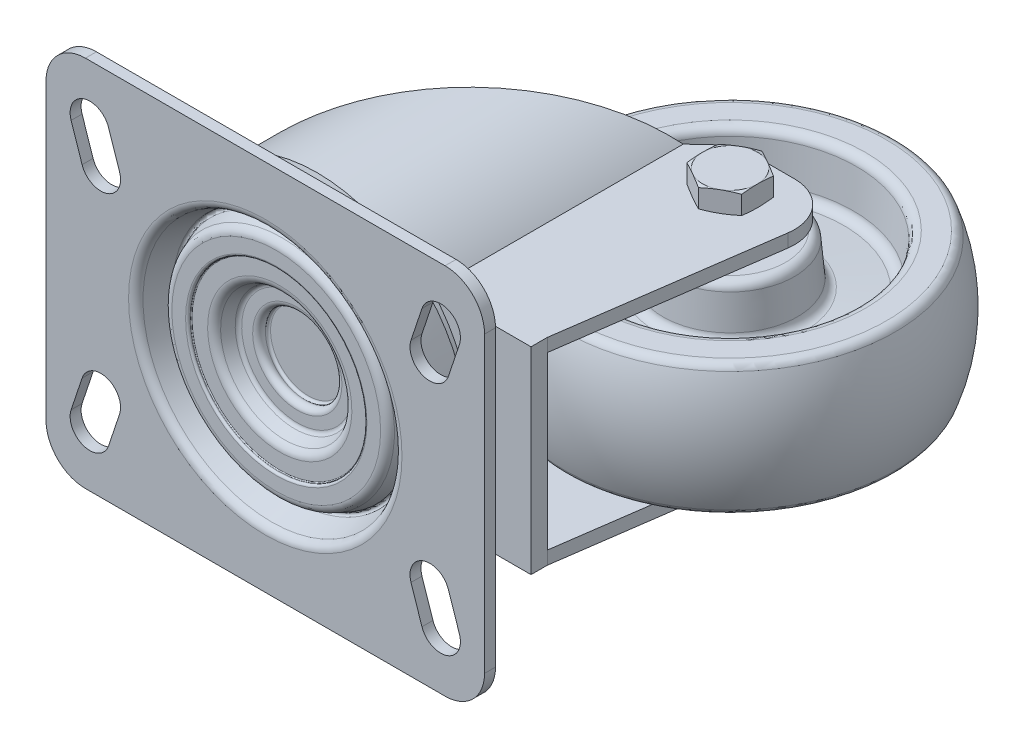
ISO-10303-21;
HEADER;
FILE_DESCRIPTION(('STEP AP214'),'2;1');
FILE_NAME('part.step','',(''),(''),'','','');
FILE_SCHEMA(('AUTOMOTIVE_DESIGN { 1 0 10303 214 1 1 1 1 }'));
ENDSEC;
DATA;
#1=APPLICATION_CONTEXT('core data for automotive mechanical design processes');
#2=APPLICATION_PROTOCOL_DEFINITION('international standard','automotive_design',2000,#1);
#3=PRODUCT_CONTEXT('',#1,'mechanical');
#4=PRODUCT('Part','Part','',(#3));
#5=PRODUCT_RELATED_PRODUCT_CATEGORY('part','',(#4));
#6=PRODUCT_DEFINITION_FORMATION('','',#4);
#7=PRODUCT_DEFINITION_CONTEXT('part definition',#1,'design');
#8=PRODUCT_DEFINITION('design','',#6,#7);
#9=PRODUCT_DEFINITION_SHAPE('','',#8);
#10=(LENGTH_UNIT() NAMED_UNIT(*) SI_UNIT(.MILLI.,.METRE.));
#11=(NAMED_UNIT(*) PLANE_ANGLE_UNIT() SI_UNIT($,.RADIAN.));
#12=(NAMED_UNIT(*) SI_UNIT($,.STERADIAN.) SOLID_ANGLE_UNIT());
#13=UNCERTAINTY_MEASURE_WITH_UNIT(LENGTH_MEASURE(1.E-05),#10,'distance_accuracy_value','');
#14=(GEOMETRIC_REPRESENTATION_CONTEXT(3) GLOBAL_UNCERTAINTY_ASSIGNED_CONTEXT((#13)) GLOBAL_UNIT_ASSIGNED_CONTEXT((#10,
#11,#12)) REPRESENTATION_CONTEXT('',''));
#15=CARTESIAN_POINT('',(0.,0.,0.));
#16=DIRECTION('',(0.,0.,1.));
#17=DIRECTION('',(1.,0.,0.));
#18=AXIS2_PLACEMENT_3D('',#15,#16,#17);
#19=CARTESIAN_POINT('',(37.5,22.5,-9.8));
#20=DIRECTION('',(0.,0.,1.));
#21=DIRECTION('',(0.,1.,0.));
#22=AXIS2_PLACEMENT_3D('',#19,#20,#21);
#23=PLANE('',#22);
#24=CARTESIAN_POINT('',(37.5,22.5,-9.8));
#25=DIRECTION('',(0.,0.,1.));
#26=DIRECTION('',(0.,1.,0.));
#27=AXIS2_PLACEMENT_3D('',#24,#25,#26);
#28=CIRCLE('',#27,8.59386116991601);
#29=CARTESIAN_POINT('',(37.5,31.093861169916,-9.8));
#30=VERTEX_POINT('',#29);
#31=EDGE_CURVE('E767',#30,#30,#28,.T.);
#32=ORIENTED_EDGE('',*,*,#31,.T.);
#33=EDGE_LOOP('',(#32));
#34=FACE_BOUND('',#33,.T.);
#35=ADVANCED_FACE('F14',(#34),#23,.T.);
#36=CARTESIAN_POINT('',(37.5,22.5,-9.3));
#37=DIRECTION('',(0.,0.,1.));
#38=DIRECTION('',(0.,1.,0.));
#39=AXIS2_PLACEMENT_3D('',#36,#37,#38);
#40=TOROIDAL_SURFACE('',#39,8.59386116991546,0.500000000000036);
#41=CARTESIAN_POINT('',(37.5,22.5,-9.085714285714));
#42=DIRECTION('',(0.,0.,1.));
#43=DIRECTION('',(0.,1.,0.));
#44=AXIS2_PLACEMENT_3D('',#41,#42,#43);
#45=CIRCLE('',#44,9.04561512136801);
#46=CARTESIAN_POINT('',(37.5,31.545615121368,-9.085714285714));
#47=VERTEX_POINT('',#46);
#48=EDGE_CURVE('E771',#47,#47,#45,.T.);
#49=ORIENTED_EDGE('',*,*,#48,.T.);
#50=EDGE_LOOP('',(#49));
#51=FACE_BOUND('',#50,.T.);
#52=ORIENTED_EDGE('',*,*,#31,.F.);
#53=EDGE_LOOP('',(#52));
#54=FACE_BOUND('',#53,.T.);
#55=ADVANCED_FACE('F628',(#51,#54),#40,.F.);
#56=CARTESIAN_POINT('',(37.5,22.5,-8.55));
#57=DIRECTION('',(0.,0.,1.));
#58=DIRECTION('',(0.,1.,0.));
#59=AXIS2_PLACEMENT_3D('',#56,#57,#58);
#60=TOROIDAL_SURFACE('',#59,10.1749999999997,1.24999999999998);
#61=CARTESIAN_POINT('',(37.5,22.5,-7.3));
#62=DIRECTION('',(0.,0.,1.));
#63=DIRECTION('',(0.,1.,0.));
#64=AXIS2_PLACEMENT_3D('',#61,#62,#63);
#65=CIRCLE('',#64,10.175);
#66=CARTESIAN_POINT('',(37.5,32.675,-7.3));
#67=VERTEX_POINT('',#66);
#68=EDGE_CURVE('E1199',#67,#67,#65,.T.);
#69=ORIENTED_EDGE('',*,*,#68,.T.);
#70=EDGE_LOOP('',(#69));
#71=FACE_BOUND('',#70,.T.);
#72=ORIENTED_EDGE('',*,*,#48,.F.);
#73=EDGE_LOOP('',(#72));
#74=FACE_BOUND('',#73,.T.);
#75=ADVANCED_FACE('F635',(#71,#74),#60,.T.);
#76=CARTESIAN_POINT('',(27.325,22.5,-7.3));
#77=DIRECTION('',(0.,0.,1.));
#78=DIRECTION('',(0.,1.,0.));
#79=AXIS2_PLACEMENT_3D('',#76,#77,#78);
#80=PLANE('',#79);
#81=CARTESIAN_POINT('',(37.5,22.5,-7.3));
#82=DIRECTION('',(0.,0.,1.));
#83=DIRECTION('',(0.,1.,0.));
#84=AXIS2_PLACEMENT_3D('',#81,#82,#83);
#85=CIRCLE('',#84,12.672699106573);
#86=CARTESIAN_POINT('',(37.5,35.172699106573,-7.3));
#87=VERTEX_POINT('',#86);
#88=EDGE_CURVE('E1196',#87,#87,#85,.T.);
#89=ORIENTED_EDGE('',*,*,#88,.T.);
#90=EDGE_LOOP('',(#89));
#91=FACE_BOUND('',#90,.T.);
#92=ORIENTED_EDGE('',*,*,#68,.F.);
#93=EDGE_LOOP('',(#92));
#94=FACE_BOUND('',#93,.T.);
#95=ADVANCED_FACE('F1342',(#91,#94),#80,.T.);
#96=CARTESIAN_POINT('',(37.5,22.5,-6.3));
#97=DIRECTION('',(0.,0.,1.));
#98=DIRECTION('',(0.,1.,0.));
#99=AXIS2_PLACEMENT_3D('',#96,#97,#98);
#100=TOROIDAL_SURFACE('',#99,12.6726991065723,1.00000000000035);
#101=CARTESIAN_POINT('',(37.5,22.5,-6.722618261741));
#102=DIRECTION('',(0.,0.,1.));
#103=DIRECTION('',(0.,1.,0.));
#104=AXIS2_PLACEMENT_3D('',#101,#102,#103);
#105=CIRCLE('',#104,13.579006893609);
#106=CARTESIAN_POINT('',(37.5,36.079006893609,-6.722618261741));
#107=VERTEX_POINT('',#106);
#108=EDGE_CURVE('E1193',#107,#107,#105,.T.);
#109=ORIENTED_EDGE('',*,*,#108,.T.);
#110=EDGE_LOOP('',(#109));
#111=FACE_BOUND('',#110,.T.);
#112=ORIENTED_EDGE('',*,*,#88,.F.);
#113=EDGE_LOOP('',(#112));
#114=FACE_BOUND('',#113,.T.);
#115=ADVANCED_FACE('F1336',(#111,#114),#100,.F.);
#116=CARTESIAN_POINT('',(37.5,22.5,-6.722618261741));
#117=DIRECTION('',(0.,0.,1.));
#118=DIRECTION('',(0.,1.,0.));
#119=AXIS2_PLACEMENT_3D('',#116,#117,#118);
#120=CONICAL_SURFACE('',#119,13.579006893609,0.436332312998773);
#121=CARTESIAN_POINT('',(37.5,22.5,-4.45476347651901));
#122=DIRECTION('',(0.,0.,1.));
#123=DIRECTION('',(0.,1.,0.));
#124=AXIS2_PLACEMENT_3D('',#121,#122,#123);
#125=CIRCLE('',#124,14.636524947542);
#126=CARTESIAN_POINT('',(37.5,37.136524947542,-4.45476347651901));
#127=VERTEX_POINT('',#126);
#128=EDGE_CURVE('E1190',#127,#127,#125,.T.);
#129=ORIENTED_EDGE('',*,*,#128,.T.);
#130=EDGE_LOOP('',(#129));
#131=FACE_BOUND('',#130,.T.);
#132=ORIENTED_EDGE('',*,*,#108,.F.);
#133=EDGE_LOOP('',(#132));
#134=FACE_BOUND('',#133,.T.);
#135=ADVANCED_FACE('F1330',(#131,#134),#120,.F.);
#136=CARTESIAN_POINT('',(37.5,22.5,-5.29999999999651));
#137=DIRECTION('',(0.,0.,1.));
#138=DIRECTION('',(0.,1.,0.));
#139=AXIS2_PLACEMENT_3D('',#136,#137,#138);
#140=TOROIDAL_SURFACE('',#139,16.4491405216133,1.99999999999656);
#141=CARTESIAN_POINT('',(37.5,22.5,-3.3));
#142=DIRECTION('',(0.,0.,1.));
#143=DIRECTION('',(0.,1.,0.));
#144=AXIS2_PLACEMENT_3D('',#141,#142,#143);
#145=CIRCLE('',#144,16.449140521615);
#146=CARTESIAN_POINT('',(37.5,38.949140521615,-3.3));
#147=VERTEX_POINT('',#146);
#148=EDGE_CURVE('E1187',#147,#147,#145,.T.);
#149=ORIENTED_EDGE('',*,*,#148,.T.);
#150=EDGE_LOOP('',(#149));
#151=FACE_BOUND('',#150,.T.);
#152=ORIENTED_EDGE('',*,*,#128,.F.);
#153=EDGE_LOOP('',(#152));
#154=FACE_BOUND('',#153,.T.);
#155=ADVANCED_FACE('F1324',(#151,#154),#140,.T.);
#156=CARTESIAN_POINT('',(21.050859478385,22.5,-3.3));
#157=DIRECTION('',(0.,0.,1.));
#158=DIRECTION('',(0.,1.,0.));
#159=AXIS2_PLACEMENT_3D('',#156,#157,#158);
#160=PLANE('',#159);
#161=CARTESIAN_POINT('',(37.5,22.5,-3.3));
#162=DIRECTION('',(0.,0.,1.));
#163=DIRECTION('',(0.,1.,0.));
#164=AXIS2_PLACEMENT_3D('',#161,#162,#163);
#165=CIRCLE('',#164,19.975);
#166=CARTESIAN_POINT('',(37.5,42.475,-3.3));
#167=VERTEX_POINT('',#166);
#168=EDGE_CURVE('E1184',#167,#167,#165,.T.);
#169=ORIENTED_EDGE('',*,*,#168,.T.);
#170=EDGE_LOOP('',(#169));
#171=FACE_BOUND('',#170,.T.);
#172=ORIENTED_EDGE('',*,*,#148,.F.);
#173=EDGE_LOOP('',(#172));
#174=FACE_BOUND('',#173,.T.);
#175=ADVANCED_FACE('F1318',(#171,#174),#160,.T.);
#176=CARTESIAN_POINT('',(37.5,22.5,-3.09999999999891));
#177=DIRECTION('',(0.,0.,1.));
#178=DIRECTION('',(0.,1.,0.));
#179=AXIS2_PLACEMENT_3D('',#176,#177,#178);
#180=TOROIDAL_SURFACE('',#179,19.9749999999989,0.200000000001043);
#181=CARTESIAN_POINT('',(37.5,22.5,-3.09999999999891));
#182=DIRECTION('',(0.,0.,1.));
#183=DIRECTION('',(0.,1.,0.));
#184=AXIS2_PLACEMENT_3D('',#181,#182,#183);
#185=CIRCLE('',#184,20.175);
#186=CARTESIAN_POINT('',(37.5,42.675,-3.09999999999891));
#187=VERTEX_POINT('',#186);
#188=EDGE_CURVE('E1181',#187,#187,#185,.T.);
#189=ORIENTED_EDGE('',*,*,#188,.T.);
#190=EDGE_LOOP('',(#189));
#191=FACE_BOUND('',#190,.T.);
#192=ORIENTED_EDGE('',*,*,#168,.F.);
#193=EDGE_LOOP('',(#192));
#194=FACE_BOUND('',#193,.T.);
#195=ADVANCED_FACE('F1312',(#191,#194),#180,.F.);
#196=CARTESIAN_POINT('',(37.5,22.5,-11.8));
#197=DIRECTION('',(0.,0.,1.));
#198=DIRECTION('',(0.,1.,0.));
#199=AXIS2_PLACEMENT_3D('',#196,#197,#198);
#200=CYLINDRICAL_SURFACE('',#199,20.175);
#201=CARTESIAN_POINT('',(37.5,22.5,-3.));
#202=DIRECTION('',(0.,0.,1.));
#203=DIRECTION('',(0.,1.,0.));
#204=AXIS2_PLACEMENT_3D('',#201,#202,#203);
#205=CIRCLE('',#204,20.175);
#206=CARTESIAN_POINT('',(37.5,42.675,-3.));
#207=VERTEX_POINT('',#206);
#208=EDGE_CURVE('E1178',#207,#207,#205,.T.);
#209=ORIENTED_EDGE('',*,*,#208,.T.);
#210=EDGE_LOOP('',(#209));
#211=FACE_BOUND('',#210,.T.);
#212=ORIENTED_EDGE('',*,*,#188,.F.);
#213=EDGE_LOOP('',(#212));
#214=FACE_BOUND('',#213,.T.);
#215=ADVANCED_FACE('F1306',(#211,#214),#200,.F.);
#216=CARTESIAN_POINT('',(37.5,22.5,-3.00000000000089));
#217=DIRECTION('',(0.,0.,1.));
#218=DIRECTION('',(0.,1.,0.));
#219=AXIS2_PLACEMENT_3D('',#216,#217,#218);
#220=TOROIDAL_SURFACE('',#219,20.6750000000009,0.50000000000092);
#221=CARTESIAN_POINT('',(37.5,22.5,-2.5));
#222=DIRECTION('',(0.,0.,1.));
#223=DIRECTION('',(0.,1.,0.));
#224=AXIS2_PLACEMENT_3D('',#221,#222,#223);
#225=CIRCLE('',#224,20.675);
#226=CARTESIAN_POINT('',(37.5,43.175,-2.5));
#227=VERTEX_POINT('',#226);
#228=EDGE_CURVE('E1175',#227,#227,#225,.T.);
#229=ORIENTED_EDGE('',*,*,#228,.T.);
#230=EDGE_LOOP('',(#229));
#231=FACE_BOUND('',#230,.T.);
#232=ORIENTED_EDGE('',*,*,#208,.F.);
#233=EDGE_LOOP('',(#232));
#234=FACE_BOUND('',#233,.T.);
#235=ADVANCED_FACE('F1300',(#231,#234),#220,.T.);
#236=CARTESIAN_POINT('',(16.825,22.5,-2.5));
#237=DIRECTION('',(0.,0.,1.));
#238=DIRECTION('',(0.,1.,0.));
#239=AXIS2_PLACEMENT_3D('',#236,#237,#238);
#240=PLANE('',#239);
#241=CARTESIAN_POINT('',(37.5,22.5,-2.5));
#242=DIRECTION('',(0.,0.,1.));
#243=DIRECTION('',(0.,1.,0.));
#244=AXIS2_PLACEMENT_3D('',#241,#242,#243);
#245=CIRCLE('',#244,23.80228871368);
#246=CARTESIAN_POINT('',(37.5,46.30228871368,-2.5));
#247=VERTEX_POINT('',#246);
#248=EDGE_CURVE('E1172',#247,#247,#245,.T.);
#249=ORIENTED_EDGE('',*,*,#248,.T.);
#250=EDGE_LOOP('',(#249));
#251=FACE_BOUND('',#250,.T.);
#252=ORIENTED_EDGE('',*,*,#228,.F.);
#253=EDGE_LOOP('',(#252));
#254=FACE_BOUND('',#253,.T.);
#255=ADVANCED_FACE('F1294',(#251,#254),#240,.T.);
#256=CARTESIAN_POINT('',(37.5,22.5,-4.50000000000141));
#257=DIRECTION('',(0.,0.,1.));
#258=DIRECTION('',(0.,1.,0.));
#259=AXIS2_PLACEMENT_3D('',#256,#257,#258);
#260=TOROIDAL_SURFACE('',#259,23.8022887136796,2.00000000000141);
#261=CARTESIAN_POINT('',(37.5,22.5,-3.780916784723));
#262=DIRECTION('',(0.,0.,1.));
#263=DIRECTION('',(0.,1.,0.));
#264=AXIS2_PLACEMENT_3D('',#261,#262,#263);
#265=CIRCLE('',#264,25.668546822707);
#266=CARTESIAN_POINT('',(37.5,48.168546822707,-3.780916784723));
#267=VERTEX_POINT('',#266);
#268=EDGE_CURVE('E1169',#267,#267,#265,.T.);
#269=ORIENTED_EDGE('',*,*,#268,.T.);
#270=EDGE_LOOP('',(#269));
#271=FACE_BOUND('',#270,.T.);
#272=ORIENTED_EDGE('',*,*,#248,.F.);
#273=EDGE_LOOP('',(#272));
#274=FACE_BOUND('',#273,.T.);
#275=ADVANCED_FACE('F1288',(#271,#274),#260,.T.);
#276=CARTESIAN_POINT('',(37.5,22.5,-3.780916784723));
#277=DIRECTION('',(0.,0.,-1.));
#278=DIRECTION('',(0.,-1.,0.));
#279=AXIS2_PLACEMENT_3D('',#276,#277,#278);
#280=CONICAL_SURFACE('',#279,25.668546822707,0.367776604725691);
#281=CARTESIAN_POINT('',(37.5,22.5,-6.479770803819));
#282=DIRECTION('',(0.,0.,1.));
#283=DIRECTION('',(0.,1.,0.));
#284=AXIS2_PLACEMENT_3D('',#281,#282,#283);
#285=CIRCLE('',#284,26.708435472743);
#286=CARTESIAN_POINT('',(37.5,49.208435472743,-6.479770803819));
#287=VERTEX_POINT('',#286);
#288=EDGE_CURVE('E1166',#287,#287,#285,.T.);
#289=ORIENTED_EDGE('',*,*,#288,.T.);
#290=EDGE_LOOP('',(#289));
#291=FACE_BOUND('',#290,.T.);
#292=ORIENTED_EDGE('',*,*,#268,.F.);
#293=EDGE_LOOP('',(#292));
#294=FACE_BOUND('',#293,.T.);
#295=ADVANCED_FACE('F1282',(#291,#294),#280,.T.);
#296=CARTESIAN_POINT('',(37.5,22.5,-6.3));
#297=DIRECTION('',(0.,0.,1.));
#298=DIRECTION('',(0.,1.,0.));
#299=AXIS2_PLACEMENT_3D('',#296,#297,#298);
#300=TOROIDAL_SURFACE('',#299,27.175,0.500000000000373);
#301=CARTESIAN_POINT('',(37.5,22.5,-6.452312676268));
#302=DIRECTION('',(0.,0.,1.));
#303=DIRECTION('',(0.,1.,0.));
#304=AXIS2_PLACEMENT_3D('',#301,#302,#303);
#305=CIRCLE('',#304,27.651236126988);
#306=CARTESIAN_POINT('',(37.5,50.151236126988,-6.452312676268));
#307=VERTEX_POINT('',#306);
#308=EDGE_CURVE('E1163',#307,#307,#305,.T.);
#309=ORIENTED_EDGE('',*,*,#308,.T.);
#310=EDGE_LOOP('',(#309));
#311=FACE_BOUND('',#310,.T.);
#312=ORIENTED_EDGE('',*,*,#288,.F.);
#313=EDGE_LOOP('',(#312));
#314=FACE_BOUND('',#313,.T.);
#315=ADVANCED_FACE('F1276',(#311,#314),#300,.F.);
#316=CARTESIAN_POINT('',(37.5,22.5,-6.452312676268));
#317=DIRECTION('',(0.,0.,1.));
#318=DIRECTION('',(0.,1.,0.));
#319=AXIS2_PLACEMENT_3D('',#316,#317,#318);
#320=CONICAL_SURFACE('',#319,27.651236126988,0.309545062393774);
#321=CARTESIAN_POINT('',(37.5,22.5,-1.39074929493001));
#322=DIRECTION('',(0.,0.,1.));
#323=DIRECTION('',(0.,1.,0.));
#324=AXIS2_PLACEMENT_3D('',#321,#322,#323);
#325=CIRCLE('',#324,29.270055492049);
#326=CARTESIAN_POINT('',(37.5,51.770055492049,-1.39074929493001));
#327=VERTEX_POINT('',#326);
#328=EDGE_CURVE('E1160',#327,#327,#325,.T.);
#329=ORIENTED_EDGE('',*,*,#328,.T.);
#330=EDGE_LOOP('',(#329));
#331=FACE_BOUND('',#330,.T.);
#332=ORIENTED_EDGE('',*,*,#308,.F.);
#333=EDGE_LOOP('',(#332));
#334=FACE_BOUND('',#333,.T.);
#335=ADVANCED_FACE('F1270',(#331,#334),#320,.F.);
#336=CARTESIAN_POINT('',(37.5,22.5,-2.00000000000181));
#337=DIRECTION('',(0.,0.,1.));
#338=DIRECTION('',(0.,1.,0.));
#339=AXIS2_PLACEMENT_3D('',#336,#337,#338);
#340=TOROIDAL_SURFACE('',#339,31.1750000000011,2.00000000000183);
#341=CARTESIAN_POINT('',(37.5,22.5,0.));
#342=DIRECTION('',(0.,0.,-1.));
#343=DIRECTION('',(-1.,0.,0.));
#344=AXIS2_PLACEMENT_3D('',#341,#342,#343);
#345=CIRCLE('',#344,31.175);
#346=CARTESIAN_POINT('',(6.325,22.5,0.));
#347=VERTEX_POINT('',#346);
#348=EDGE_CURVE('E808',#347,#347,#345,.T.);
#349=ORIENTED_EDGE('',*,*,#348,.F.);
#350=EDGE_LOOP('',(#349));
#351=FACE_BOUND('',#350,.T.);
#352=ORIENTED_EDGE('',*,*,#328,.F.);
#353=EDGE_LOOP('',(#352));
#354=FACE_BOUND('',#353,.T.);
#355=ADVANCED_FACE('F645',(#351,#354),#340,.T.);
#356=CARTESIAN_POINT('',(78.5,-11.,0.));
#357=DIRECTION('',(0.,0.,1.));
#358=DIRECTION('',(0.,1.,0.));
#359=AXIS2_PLACEMENT_3D('',#356,#357,#358);
#360=PLANE('',#359);
#361=DIRECTION('',(0.316227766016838,-0.948683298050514,0.));
#362=VECTOR('',#361,1.);
#363=CARTESIAN_POINT('',(70.7309251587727,-1.423024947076,0.));
#364=LINE('',#363,#362);
#365=CARTESIAN_POINT('',(70.7309251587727,-1.423024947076,0.));
#366=VERTEX_POINT('',#365);
#367=CARTESIAN_POINT('',(73.2309251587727,-8.923024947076,0.));
#368=VERTEX_POINT('',#367);
#369=EDGE_CURVE('E840',#366,#368,#364,.T.);
#370=ORIENTED_EDGE('',*,*,#369,.F.);
#371=CARTESIAN_POINT('',(75.,-3.50414142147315E-13,0.));
#372=DIRECTION('',(0.,0.,1.));
#373=DIRECTION('',(1.,0.,0.));
#374=AXIS2_PLACEMENT_3D('',#371,#372,#373);
#375=CIRCLE('',#374,4.50000000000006);
#376=CARTESIAN_POINT('',(79.2690748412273,1.423024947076,0.));
#377=VERTEX_POINT('',#376);
#378=EDGE_CURVE('E828',#377,#366,#375,.T.);
#379=ORIENTED_EDGE('',*,*,#378,.F.);
#380=DIRECTION('',(-0.316227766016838,0.948683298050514,0.));
#381=VECTOR('',#380,1.);
#382=CARTESIAN_POINT('',(81.7690748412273,-6.076975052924,0.));
#383=LINE('',#382,#381);
#384=CARTESIAN_POINT('',(81.7690748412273,-6.076975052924,0.));
#385=VERTEX_POINT('',#384);
#386=EDGE_CURVE('E832',#385,#377,#383,.T.);
#387=ORIENTED_EDGE('',*,*,#386,.F.);
#388=CARTESIAN_POINT('',(77.5,-7.5,0.));
#389=DIRECTION('',(0.,0.,1.));
#390=DIRECTION('',(-1.,0.,0.));
#391=AXIS2_PLACEMENT_3D('',#388,#389,#390);
#392=CIRCLE('',#391,4.50000000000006);
#393=EDGE_CURVE('E836',#368,#385,#392,.T.);
#394=ORIENTED_EDGE('',*,*,#393,.F.);
#395=EDGE_LOOP('',(#370,#379,#387,#394));
#396=FACE_BOUND('',#395,.T.);
#397=DIRECTION('',(0.316227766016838,0.948683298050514,0.));
#398=VECTOR('',#397,1.);
#399=CARTESIAN_POINT('',(79.2690748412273,43.576975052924,0.));
#400=LINE('',#399,#398);
#401=CARTESIAN_POINT('',(79.2690748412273,43.576975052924,0.));
#402=VERTEX_POINT('',#401);
#403=CARTESIAN_POINT('',(81.7690748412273,51.076975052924,0.));
#404=VERTEX_POINT('',#403);
#405=EDGE_CURVE('E824',#402,#404,#400,.T.);
#406=ORIENTED_EDGE('',*,*,#405,.F.);
#407=CARTESIAN_POINT('',(75.,45.,0.));
#408=DIRECTION('',(0.,0.,1.));
#409=DIRECTION('',(1.,0.,0.));
#410=AXIS2_PLACEMENT_3D('',#407,#408,#409);
#411=CIRCLE('',#410,4.50000000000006);
#412=CARTESIAN_POINT('',(70.7309251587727,46.423024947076,0.));
#413=VERTEX_POINT('',#412);
#414=EDGE_CURVE('E812',#413,#402,#411,.T.);
#415=ORIENTED_EDGE('',*,*,#414,.F.);
#416=DIRECTION('',(-0.316227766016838,-0.948683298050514,0.));
#417=VECTOR('',#416,1.);
#418=CARTESIAN_POINT('',(73.2309251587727,53.923024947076,0.));
#419=LINE('',#418,#417);
#420=CARTESIAN_POINT('',(73.2309251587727,53.923024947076,0.));
#421=VERTEX_POINT('',#420);
#422=EDGE_CURVE('E816',#421,#413,#419,.T.);
#423=ORIENTED_EDGE('',*,*,#422,.F.);
#424=CARTESIAN_POINT('',(77.5,52.5,0.));
#425=DIRECTION('',(0.,0.,1.));
#426=DIRECTION('',(-1.,0.,0.));
#427=AXIS2_PLACEMENT_3D('',#424,#425,#426);
#428=CIRCLE('',#427,4.50000000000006);
#429=EDGE_CURVE('E820',#404,#421,#428,.T.);
#430=ORIENTED_EDGE('',*,*,#429,.F.);
#431=EDGE_LOOP('',(#406,#415,#423,#430));
#432=FACE_BOUND('',#431,.T.);
#433=CARTESIAN_POINT('',(78.5,-11.,0.));
#434=DIRECTION('',(0.,0.,1.));
#435=DIRECTION('',(-1.,0.,0.));
#436=AXIS2_PLACEMENT_3D('',#433,#434,#435);
#437=CIRCLE('',#436,9.);
#438=CARTESIAN_POINT('',(78.5,-20.,0.));
#439=VERTEX_POINT('',#438);
#440=CARTESIAN_POINT('',(87.5,-11.,0.));
#441=VERTEX_POINT('',#440);
#442=EDGE_CURVE('E757',#439,#441,#437,.T.);
#443=ORIENTED_EDGE('',*,*,#442,.T.);
#444=DIRECTION('',(0.,1.,0.));
#445=VECTOR('',#444,1.);
#446=CARTESIAN_POINT('',(87.5,-11.,0.));
#447=LINE('',#446,#445);
#448=CARTESIAN_POINT('',(87.5,56.,0.));
#449=VERTEX_POINT('',#448);
#450=EDGE_CURVE('E746',#441,#449,#447,.T.);
#451=ORIENTED_EDGE('',*,*,#450,.T.);
#452=CARTESIAN_POINT('',(78.5,56.,0.));
#453=DIRECTION('',(0.,0.,1.));
#454=DIRECTION('',(-1.,0.,0.));
#455=AXIS2_PLACEMENT_3D('',#452,#453,#454);
#456=CIRCLE('',#455,9.);
#457=CARTESIAN_POINT('',(78.5,65.,0.));
#458=VERTEX_POINT('',#457);
#459=EDGE_CURVE('E756',#449,#458,#456,.T.);
#460=ORIENTED_EDGE('',*,*,#459,.T.);
#461=DIRECTION('',(-1.,0.,0.));
#462=VECTOR('',#461,1.);
#463=CARTESIAN_POINT('',(78.5,65.,0.));
#464=LINE('',#463,#462);
#465=CARTESIAN_POINT('',(-3.5,65.,0.));
#466=VERTEX_POINT('',#465);
#467=EDGE_CURVE('E1206',#458,#466,#464,.T.);
#468=ORIENTED_EDGE('',*,*,#467,.T.);
#469=CARTESIAN_POINT('',(-3.5,56.,0.));
#470=DIRECTION('',(0.,0.,1.));
#471=DIRECTION('',(1.,0.,0.));
#472=AXIS2_PLACEMENT_3D('',#469,#470,#471);
#473=CIRCLE('',#472,8.99999999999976);
#474=CARTESIAN_POINT('',(-12.5,56.,0.));
#475=VERTEX_POINT('',#474);
#476=EDGE_CURVE('E1210',#466,#475,#473,.T.);
#477=ORIENTED_EDGE('',*,*,#476,.T.);
#478=DIRECTION('',(0.,-1.,0.));
#479=VECTOR('',#478,1.);
#480=CARTESIAN_POINT('',(-12.5,56.,0.));
#481=LINE('',#480,#479);
#482=CARTESIAN_POINT('',(-12.5,-11.,0.));
#483=VERTEX_POINT('',#482);
#484=EDGE_CURVE('E1214',#475,#483,#481,.T.);
#485=ORIENTED_EDGE('',*,*,#484,.T.);
#486=CARTESIAN_POINT('',(-3.5,-11.,0.));
#487=DIRECTION('',(0.,0.,1.));
#488=DIRECTION('',(-1.,0.,0.));
#489=AXIS2_PLACEMENT_3D('',#486,#487,#488);
#490=CIRCLE('',#489,8.99999999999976);
#491=CARTESIAN_POINT('',(-3.5,-20.,0.));
#492=VERTEX_POINT('',#491);
#493=EDGE_CURVE('E1217',#483,#492,#490,.T.);
#494=ORIENTED_EDGE('',*,*,#493,.T.);
#495=DIRECTION('',(1.,0.,0.));
#496=VECTOR('',#495,1.);
#497=CARTESIAN_POINT('',(-3.5,-20.,0.));
#498=LINE('',#497,#496);
#499=EDGE_CURVE('E764',#492,#439,#498,.T.);
#500=ORIENTED_EDGE('',*,*,#499,.T.);
#501=EDGE_LOOP('',(#443,#451,#460,#468,#477,#485,#494,#500));
#502=FACE_BOUND('',#501,.T.);
#503=DIRECTION('',(0.316227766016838,-0.948683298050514,0.));
#504=VECTOR('',#503,1.);
#505=CARTESIAN_POINT('',(-6.76907484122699,51.076975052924,0.));
#506=LINE('',#505,#504);
#507=CARTESIAN_POINT('',(-6.76907484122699,51.076975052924,0.));
#508=VERTEX_POINT('',#507);
#509=CARTESIAN_POINT('',(-4.26907484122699,43.576975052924,0.));
#510=VERTEX_POINT('',#509);
#511=EDGE_CURVE('E788',#508,#510,#506,.T.);
#512=ORIENTED_EDGE('',*,*,#511,.F.);
#513=CARTESIAN_POINT('',(-2.5,52.5,0.));
#514=DIRECTION('',(0.,0.,1.));
#515=DIRECTION('',(1.,0.,0.));
#516=AXIS2_PLACEMENT_3D('',#513,#514,#515);
#517=CIRCLE('',#516,4.49999999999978);
#518=CARTESIAN_POINT('',(1.769074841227,53.923024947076,0.));
#519=VERTEX_POINT('',#518);
#520=EDGE_CURVE('E776',#519,#508,#517,.T.);
#521=ORIENTED_EDGE('',*,*,#520,.F.);
#522=DIRECTION('',(-0.316227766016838,0.948683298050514,0.));
#523=VECTOR('',#522,1.);
#524=CARTESIAN_POINT('',(4.26907484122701,46.423024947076,0.));
#525=LINE('',#524,#523);
#526=CARTESIAN_POINT('',(4.26907484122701,46.423024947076,0.));
#527=VERTEX_POINT('',#526);
#528=EDGE_CURVE('E780',#527,#519,#525,.T.);
#529=ORIENTED_EDGE('',*,*,#528,.F.);
#530=CARTESIAN_POINT('',(0.,45.,0.));
#531=DIRECTION('',(0.,0.,1.));
#532=DIRECTION('',(-1.,0.,0.));
#533=AXIS2_PLACEMENT_3D('',#530,#531,#532);
#534=CIRCLE('',#533,4.49999999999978);
#535=EDGE_CURVE('E784',#510,#527,#534,.T.);
#536=ORIENTED_EDGE('',*,*,#535,.F.);
#537=EDGE_LOOP('',(#512,#521,#529,#536));
#538=FACE_BOUND('',#537,.T.);
#539=DIRECTION('',(0.316227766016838,0.948683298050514,0.));
#540=VECTOR('',#539,1.);
#541=CARTESIAN_POINT('',(1.769074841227,-8.923024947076,0.));
#542=LINE('',#541,#540);
#543=CARTESIAN_POINT('',(1.769074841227,-8.923024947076,0.));
#544=VERTEX_POINT('',#543);
#545=CARTESIAN_POINT('',(4.26907484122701,-1.423024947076,0.));
#546=VERTEX_POINT('',#545);
#547=EDGE_CURVE('E804',#544,#546,#542,.T.);
#548=ORIENTED_EDGE('',*,*,#547,.F.);
#549=CARTESIAN_POINT('',(-2.5,-7.5,0.));
#550=DIRECTION('',(0.,0.,1.));
#551=DIRECTION('',(1.,0.,0.));
#552=AXIS2_PLACEMENT_3D('',#549,#550,#551);
#553=CIRCLE('',#552,4.49999999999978);
#554=CARTESIAN_POINT('',(-6.76907484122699,-6.076975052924,0.));
#555=VERTEX_POINT('',#554);
#556=EDGE_CURVE('E792',#555,#544,#553,.T.);
#557=ORIENTED_EDGE('',*,*,#556,.F.);
#558=DIRECTION('',(-0.316227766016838,-0.948683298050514,0.));
#559=VECTOR('',#558,1.);
#560=CARTESIAN_POINT('',(-4.26907484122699,1.423024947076,0.));
#561=LINE('',#560,#559);
#562=CARTESIAN_POINT('',(-4.26907484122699,1.423024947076,0.));
#563=VERTEX_POINT('',#562);
#564=EDGE_CURVE('E796',#563,#555,#561,.T.);
#565=ORIENTED_EDGE('',*,*,#564,.F.);
#566=CARTESIAN_POINT('',(0.,0.,0.));
#567=DIRECTION('',(0.,0.,1.));
#568=DIRECTION('',(-1.,0.,0.));
#569=AXIS2_PLACEMENT_3D('',#566,#567,#568);
#570=CIRCLE('',#569,4.49999999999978);
#571=EDGE_CURVE('E800',#546,#563,#570,.T.);
#572=ORIENTED_EDGE('',*,*,#571,.F.);
#573=EDGE_LOOP('',(#548,#557,#565,#572));
#574=FACE_BOUND('',#573,.T.);
#575=ORIENTED_EDGE('',*,*,#348,.T.);
#576=EDGE_LOOP('',(#575));
#577=FACE_BOUND('',#576,.T.);
#578=ADVANCED_FACE('F641',(#396,#432,#502,#538,#574,#577),#360,.T.);
#579=CARTESIAN_POINT('',(-2.5,-7.5,-2.5));
#580=DIRECTION('',(0.,0.,1.));
#581=DIRECTION('',(0.,1.,0.));
#582=AXIS2_PLACEMENT_3D('',#579,#580,#581);
#583=CYLINDRICAL_SURFACE('',#582,4.49999999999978);
#584=ORIENTED_EDGE('',*,*,#556,.T.);
#585=DIRECTION('',(0.,0.,1.));
#586=VECTOR('',#585,1.);
#587=CARTESIAN_POINT('',(1.769074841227,-8.923024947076,-2.5));
#588=LINE('',#587,#586);
#589=CARTESIAN_POINT('',(1.769074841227,-8.923024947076,-2.5));
#590=VERTEX_POINT('',#589);
#591=EDGE_CURVE('E938',#590,#544,#588,.T.);
#592=ORIENTED_EDGE('',*,*,#591,.F.);
#593=CARTESIAN_POINT('',(-2.5,-7.5,-2.5));
#594=DIRECTION('',(0.,0.,1.));
#595=DIRECTION('',(1.,0.,0.));
#596=AXIS2_PLACEMENT_3D('',#593,#594,#595);
#597=CIRCLE('',#596,4.49999999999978);
#598=CARTESIAN_POINT('',(-6.76907484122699,-6.076975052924,-2.5));
#599=VERTEX_POINT('',#598);
#600=EDGE_CURVE('E879',#599,#590,#597,.T.);
#601=ORIENTED_EDGE('',*,*,#600,.F.);
#602=DIRECTION('',(0.,0.,1.));
#603=VECTOR('',#602,1.);
#604=CARTESIAN_POINT('',(-6.76907484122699,-6.076975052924,-2.5));
#605=LINE('',#604,#603);
#606=EDGE_CURVE('E937',#599,#555,#605,.T.);
#607=ORIENTED_EDGE('',*,*,#606,.T.);
#608=EDGE_LOOP('',(#584,#592,#601,#607));
#609=FACE_BOUND('',#608,.T.);
#610=ADVANCED_FACE('F644',(#609),#583,.F.);
#611=CARTESIAN_POINT('',(-4.26907484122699,1.423024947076,-2.5));
#612=DIRECTION('',(-0.948683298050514,0.316227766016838,0.));
#613=DIRECTION('',(-0.316227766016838,-0.948683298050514,0.));
#614=AXIS2_PLACEMENT_3D('',#611,#612,#613);
#615=PLANE('',#614);
#616=ORIENTED_EDGE('',*,*,#564,.T.);
#617=ORIENTED_EDGE('',*,*,#606,.F.);
#618=DIRECTION('',(-0.316227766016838,-0.948683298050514,0.));
#619=VECTOR('',#618,1.);
#620=CARTESIAN_POINT('',(-4.26907484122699,1.423024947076,-2.5));
#621=LINE('',#620,#619);
#622=CARTESIAN_POINT('',(-4.26907484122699,1.423024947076,-2.5));
#623=VERTEX_POINT('',#622);
#624=EDGE_CURVE('E882',#623,#599,#621,.T.);
#625=ORIENTED_EDGE('',*,*,#624,.F.);
#626=DIRECTION('',(0.,0.,1.));
#627=VECTOR('',#626,1.);
#628=CARTESIAN_POINT('',(-4.26907484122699,1.423024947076,-2.5));
#629=LINE('',#628,#627);
#630=EDGE_CURVE('E934',#623,#563,#629,.T.);
#631=ORIENTED_EDGE('',*,*,#630,.T.);
#632=EDGE_LOOP('',(#616,#617,#625,#631));
#633=FACE_BOUND('',#632,.T.);
#634=ADVANCED_FACE('F692',(#633),#615,.F.);
#635=CARTESIAN_POINT('',(0.,0.,-2.5));
#636=DIRECTION('',(0.,0.,1.));
#637=DIRECTION('',(0.,1.,0.));
#638=AXIS2_PLACEMENT_3D('',#635,#636,#637);
#639=CYLINDRICAL_SURFACE('',#638,4.49999999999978);
#640=ORIENTED_EDGE('',*,*,#571,.T.);
#641=ORIENTED_EDGE('',*,*,#630,.F.);
#642=CARTESIAN_POINT('',(0.,0.,-2.5));
#643=DIRECTION('',(0.,0.,1.));
#644=DIRECTION('',(-1.,0.,0.));
#645=AXIS2_PLACEMENT_3D('',#642,#643,#644);
#646=CIRCLE('',#645,4.49999999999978);
#647=CARTESIAN_POINT('',(4.26907484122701,-1.423024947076,-2.5));
#648=VERTEX_POINT('',#647);
#649=EDGE_CURVE('E885',#648,#623,#646,.T.);
#650=ORIENTED_EDGE('',*,*,#649,.F.);
#651=DIRECTION('',(0.,0.,1.));
#652=VECTOR('',#651,1.);
#653=CARTESIAN_POINT('',(4.26907484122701,-1.423024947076,-2.5));
#654=LINE('',#653,#652);
#655=EDGE_CURVE('E932',#648,#546,#654,.T.);
#656=ORIENTED_EDGE('',*,*,#655,.T.);
#657=EDGE_LOOP('',(#640,#641,#650,#656));
#658=FACE_BOUND('',#657,.T.);
#659=ADVANCED_FACE('F688',(#658),#639,.F.);
#660=CARTESIAN_POINT('',(1.769074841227,-8.923024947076,-2.5));
#661=DIRECTION('',(0.948683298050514,-0.316227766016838,0.));
#662=DIRECTION('',(0.316227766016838,0.948683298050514,0.));
#663=AXIS2_PLACEMENT_3D('',#660,#661,#662);
#664=PLANE('',#663);
#665=ORIENTED_EDGE('',*,*,#547,.T.);
#666=ORIENTED_EDGE('',*,*,#655,.F.);
#667=DIRECTION('',(0.316227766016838,0.948683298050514,0.));
#668=VECTOR('',#667,1.);
#669=CARTESIAN_POINT('',(1.769074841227,-8.923024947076,-2.5));
#670=LINE('',#669,#668);
#671=EDGE_CURVE('E888',#590,#648,#670,.T.);
#672=ORIENTED_EDGE('',*,*,#671,.F.);
#673=ORIENTED_EDGE('',*,*,#591,.T.);
#674=EDGE_LOOP('',(#665,#666,#672,#673));
#675=FACE_BOUND('',#674,.T.);
#676=ADVANCED_FACE('F684',(#675),#664,.F.);
#677=CARTESIAN_POINT('',(-2.5,52.5,-2.5));
#678=DIRECTION('',(0.,0.,1.));
#679=DIRECTION('',(0.,1.,0.));
#680=AXIS2_PLACEMENT_3D('',#677,#678,#679);
#681=CYLINDRICAL_SURFACE('',#680,4.49999999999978);
#682=ORIENTED_EDGE('',*,*,#520,.T.);
#683=DIRECTION('',(0.,0.,1.));
#684=VECTOR('',#683,1.);
#685=CARTESIAN_POINT('',(-6.76907484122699,51.076975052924,-2.5));
#686=LINE('',#685,#684);
#687=CARTESIAN_POINT('',(-6.76907484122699,51.076975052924,-2.5));
#688=VERTEX_POINT('',#687);
#689=EDGE_CURVE('E935',#688,#508,#686,.T.);
#690=ORIENTED_EDGE('',*,*,#689,.F.);
#691=CARTESIAN_POINT('',(-2.5,52.5,-2.5));
#692=DIRECTION('',(0.,0.,1.));
#693=DIRECTION('',(1.,0.,0.));
#694=AXIS2_PLACEMENT_3D('',#691,#692,#693);
#695=CIRCLE('',#694,4.49999999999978);
#696=CARTESIAN_POINT('',(1.769074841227,53.923024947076,-2.5));
#697=VERTEX_POINT('',#696);
#698=EDGE_CURVE('E865',#697,#688,#695,.T.);
#699=ORIENTED_EDGE('',*,*,#698,.F.);
#700=DIRECTION('',(0.,0.,1.));
#701=VECTOR('',#700,1.);
#702=CARTESIAN_POINT('',(1.769074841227,53.923024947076,-2.5));
#703=LINE('',#702,#701);
#704=EDGE_CURVE('E946',#697,#519,#703,.T.);
#705=ORIENTED_EDGE('',*,*,#704,.T.);
#706=EDGE_LOOP('',(#682,#690,#699,#705));
#707=FACE_BOUND('',#706,.T.);
#708=ADVANCED_FACE('F687',(#707),#681,.F.);
#709=CARTESIAN_POINT('',(4.26907484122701,46.423024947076,-2.5));
#710=DIRECTION('',(0.948683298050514,0.316227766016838,0.));
#711=DIRECTION('',(-0.316227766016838,0.948683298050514,0.));
#712=AXIS2_PLACEMENT_3D('',#709,#710,#711);
#713=PLANE('',#712);
#714=ORIENTED_EDGE('',*,*,#528,.T.);
#715=ORIENTED_EDGE('',*,*,#704,.F.);
#716=DIRECTION('',(-0.316227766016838,0.948683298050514,0.));
#717=VECTOR('',#716,1.);
#718=CARTESIAN_POINT('',(4.26907484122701,46.423024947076,-2.5));
#719=LINE('',#718,#717);
#720=CARTESIAN_POINT('',(4.26907484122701,46.423024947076,-2.5));
#721=VERTEX_POINT('',#720);
#722=EDGE_CURVE('E870',#721,#697,#719,.T.);
#723=ORIENTED_EDGE('',*,*,#722,.F.);
#724=DIRECTION('',(0.,0.,1.));
#725=VECTOR('',#724,1.);
#726=CARTESIAN_POINT('',(4.26907484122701,46.423024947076,-2.5));
#727=LINE('',#726,#725);
#728=EDGE_CURVE('E944',#721,#527,#727,.T.);
#729=ORIENTED_EDGE('',*,*,#728,.T.);
#730=EDGE_LOOP('',(#714,#715,#723,#729));
#731=FACE_BOUND('',#730,.T.);
#732=ADVANCED_FACE('F708',(#731),#713,.F.);
#733=CARTESIAN_POINT('',(0.,45.,-2.5));
#734=DIRECTION('',(0.,0.,1.));
#735=DIRECTION('',(0.,1.,0.));
#736=AXIS2_PLACEMENT_3D('',#733,#734,#735);
#737=CYLINDRICAL_SURFACE('',#736,4.49999999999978);
#738=ORIENTED_EDGE('',*,*,#535,.T.);
#739=ORIENTED_EDGE('',*,*,#728,.F.);
#740=CARTESIAN_POINT('',(0.,45.,-2.5));
#741=DIRECTION('',(0.,0.,1.));
#742=DIRECTION('',(-1.,0.,0.));
#743=AXIS2_PLACEMENT_3D('',#740,#741,#742);
#744=CIRCLE('',#743,4.49999999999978);
#745=CARTESIAN_POINT('',(-4.26907484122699,43.576975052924,-2.5));
#746=VERTEX_POINT('',#745);
#747=EDGE_CURVE('E873',#746,#721,#744,.T.);
#748=ORIENTED_EDGE('',*,*,#747,.F.);
#749=DIRECTION('',(0.,0.,1.));
#750=VECTOR('',#749,1.);
#751=CARTESIAN_POINT('',(-4.26907484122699,43.576975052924,-2.5));
#752=LINE('',#751,#750);
#753=EDGE_CURVE('E942',#746,#510,#752,.T.);
#754=ORIENTED_EDGE('',*,*,#753,.T.);
#755=EDGE_LOOP('',(#738,#739,#748,#754));
#756=FACE_BOUND('',#755,.T.);
#757=ADVANCED_FACE('F704',(#756),#737,.F.);
#758=CARTESIAN_POINT('',(-6.76907484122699,51.076975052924,-2.5));
#759=DIRECTION('',(-0.948683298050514,-0.316227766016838,0.));
#760=DIRECTION('',(0.316227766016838,-0.948683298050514,0.));
#761=AXIS2_PLACEMENT_3D('',#758,#759,#760);
#762=PLANE('',#761);
#763=ORIENTED_EDGE('',*,*,#511,.T.);
#764=ORIENTED_EDGE('',*,*,#753,.F.);
#765=DIRECTION('',(0.316227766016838,-0.948683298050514,0.));
#766=VECTOR('',#765,1.);
#767=CARTESIAN_POINT('',(-6.76907484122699,51.076975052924,-2.5));
#768=LINE('',#767,#766);
#769=EDGE_CURVE('E876',#688,#746,#768,.T.);
#770=ORIENTED_EDGE('',*,*,#769,.F.);
#771=ORIENTED_EDGE('',*,*,#689,.T.);
#772=EDGE_LOOP('',(#763,#764,#770,#771));
#773=FACE_BOUND('',#772,.T.);
#774=ADVANCED_FACE('F700',(#773),#762,.F.);
#775=CARTESIAN_POINT('',(87.5,-11.,-2.5));
#776=DIRECTION('',(1.,0.,0.));
#777=DIRECTION('',(0.,1.,0.));
#778=AXIS2_PLACEMENT_3D('',#775,#776,#777);
#779=PLANE('',#778);
#780=ORIENTED_EDGE('',*,*,#450,.F.);
#781=DIRECTION('',(0.,0.,1.));
#782=VECTOR('',#781,1.);
#783=CARTESIAN_POINT('',(87.5,-11.,-2.5));
#784=LINE('',#783,#782);
#785=CARTESIAN_POINT('',(87.5,-11.,-2.5));
#786=VERTEX_POINT('',#785);
#787=EDGE_CURVE('E749',#786,#441,#784,.T.);
#788=ORIENTED_EDGE('',*,*,#787,.F.);
#789=DIRECTION('',(0.,1.,0.));
#790=VECTOR('',#789,1.);
#791=CARTESIAN_POINT('',(87.5,-11.,-2.5));
#792=LINE('',#791,#790);
#793=CARTESIAN_POINT('',(87.5,56.,-2.5));
#794=VERTEX_POINT('',#793);
#795=EDGE_CURVE('E845',#786,#794,#792,.T.);
#796=ORIENTED_EDGE('',*,*,#795,.T.);
#797=DIRECTION('',(0.,0.,1.));
#798=VECTOR('',#797,1.);
#799=CARTESIAN_POINT('',(87.5,56.,-2.5));
#800=LINE('',#799,#798);
#801=EDGE_CURVE('E751',#794,#449,#800,.T.);
#802=ORIENTED_EDGE('',*,*,#801,.T.);
#803=EDGE_LOOP('',(#780,#788,#796,#802));
#804=FACE_BOUND('',#803,.T.);
#805=ADVANCED_FACE('F703',(#804),#779,.T.);
#806=CARTESIAN_POINT('',(78.5,56.,-2.5));
#807=DIRECTION('',(0.,0.,1.));
#808=DIRECTION('',(0.,1.,0.));
#809=AXIS2_PLACEMENT_3D('',#806,#807,#808);
#810=CYLINDRICAL_SURFACE('',#809,9.);
#811=ORIENTED_EDGE('',*,*,#459,.F.);
#812=ORIENTED_EDGE('',*,*,#801,.F.);
#813=CARTESIAN_POINT('',(78.5,56.,-2.5));
#814=DIRECTION('',(0.,0.,1.));
#815=DIRECTION('',(-1.,0.,0.));
#816=AXIS2_PLACEMENT_3D('',#813,#814,#815);
#817=CIRCLE('',#816,9.);
#818=CARTESIAN_POINT('',(78.5,65.,-2.5));
#819=VERTEX_POINT('',#818);
#820=EDGE_CURVE('E847',#794,#819,#817,.T.);
#821=ORIENTED_EDGE('',*,*,#820,.T.);
#822=DIRECTION('',(0.,0.,1.));
#823=VECTOR('',#822,1.);
#824=CARTESIAN_POINT('',(78.5,65.,-2.5));
#825=LINE('',#824,#823);
#826=EDGE_CURVE('E958',#819,#458,#825,.T.);
#827=ORIENTED_EDGE('',*,*,#826,.T.);
#828=EDGE_LOOP('',(#811,#812,#821,#827));
#829=FACE_BOUND('',#828,.T.);
#830=ADVANCED_FACE('F735',(#829),#810,.T.);
#831=CARTESIAN_POINT('',(78.5,65.,-2.5));
#832=DIRECTION('',(0.,1.,0.));
#833=DIRECTION('',(-1.,0.,0.));
#834=AXIS2_PLACEMENT_3D('',#831,#832,#833);
#835=PLANE('',#834);
#836=ORIENTED_EDGE('',*,*,#467,.F.);
#837=ORIENTED_EDGE('',*,*,#826,.F.);
#838=DIRECTION('',(-1.,0.,0.));
#839=VECTOR('',#838,1.);
#840=CARTESIAN_POINT('',(78.5,65.,-2.5));
#841=LINE('',#840,#839);
#842=CARTESIAN_POINT('',(-3.5,65.,-2.5));
#843=VERTEX_POINT('',#842);
#844=EDGE_CURVE('E850',#819,#843,#841,.T.);
#845=ORIENTED_EDGE('',*,*,#844,.T.);
#846=DIRECTION('',(0.,0.,1.));
#847=VECTOR('',#846,1.);
#848=CARTESIAN_POINT('',(-3.5,65.,-2.5));
#849=LINE('',#848,#847);
#850=EDGE_CURVE('E956',#843,#466,#849,.T.);
#851=ORIENTED_EDGE('',*,*,#850,.T.);
#852=EDGE_LOOP('',(#836,#837,#845,#851));
#853=FACE_BOUND('',#852,.T.);
#854=ADVANCED_FACE('F731',(#853),#835,.T.);
#855=CARTESIAN_POINT('',(-3.5,56.,-2.5));
#856=DIRECTION('',(0.,0.,1.));
#857=DIRECTION('',(0.,1.,0.));
#858=AXIS2_PLACEMENT_3D('',#855,#856,#857);
#859=CYLINDRICAL_SURFACE('',#858,8.99999999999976);
#860=ORIENTED_EDGE('',*,*,#476,.F.);
#861=ORIENTED_EDGE('',*,*,#850,.F.);
#862=CARTESIAN_POINT('',(-3.5,56.,-2.5));
#863=DIRECTION('',(0.,0.,1.));
#864=DIRECTION('',(1.,0.,0.));
#865=AXIS2_PLACEMENT_3D('',#862,#863,#864);
#866=CIRCLE('',#865,8.99999999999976);
#867=CARTESIAN_POINT('',(-12.5,56.,-2.5));
#868=VERTEX_POINT('',#867);
#869=EDGE_CURVE('E853',#843,#868,#866,.T.);
#870=ORIENTED_EDGE('',*,*,#869,.T.);
#871=DIRECTION('',(0.,0.,1.));
#872=VECTOR('',#871,1.);
#873=CARTESIAN_POINT('',(-12.5,56.,-2.5));
#874=LINE('',#873,#872);
#875=EDGE_CURVE('E954',#868,#475,#874,.T.);
#876=ORIENTED_EDGE('',*,*,#875,.T.);
#877=EDGE_LOOP('',(#860,#861,#870,#876));
#878=FACE_BOUND('',#877,.T.);
#879=ADVANCED_FACE('F727',(#878),#859,.T.);
#880=CARTESIAN_POINT('',(-12.5,56.,-2.5));
#881=DIRECTION('',(-1.,0.,0.));
#882=DIRECTION('',(0.,-1.,0.));
#883=AXIS2_PLACEMENT_3D('',#880,#881,#882);
#884=PLANE('',#883);
#885=ORIENTED_EDGE('',*,*,#484,.F.);
#886=ORIENTED_EDGE('',*,*,#875,.F.);
#887=DIRECTION('',(0.,-1.,0.));
#888=VECTOR('',#887,1.);
#889=CARTESIAN_POINT('',(-12.5,56.,-2.5));
#890=LINE('',#889,#888);
#891=CARTESIAN_POINT('',(-12.5,-11.,-2.5));
#892=VERTEX_POINT('',#891);
#893=EDGE_CURVE('E856',#868,#892,#890,.T.);
#894=ORIENTED_EDGE('',*,*,#893,.T.);
#895=DIRECTION('',(0.,0.,1.));
#896=VECTOR('',#895,1.);
#897=CARTESIAN_POINT('',(-12.5,-11.,-2.5));
#898=LINE('',#897,#896);
#899=EDGE_CURVE('E952',#892,#483,#898,.T.);
#900=ORIENTED_EDGE('',*,*,#899,.T.);
#901=EDGE_LOOP('',(#885,#886,#894,#900));
#902=FACE_BOUND('',#901,.T.);
#903=ADVANCED_FACE('F723',(#902),#884,.T.);
#904=CARTESIAN_POINT('',(-3.5,-11.,-2.5));
#905=DIRECTION('',(0.,0.,1.));
#906=DIRECTION('',(0.,1.,0.));
#907=AXIS2_PLACEMENT_3D('',#904,#905,#906);
#908=CYLINDRICAL_SURFACE('',#907,8.99999999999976);
#909=ORIENTED_EDGE('',*,*,#493,.F.);
#910=ORIENTED_EDGE('',*,*,#899,.F.);
#911=CARTESIAN_POINT('',(-3.5,-11.,-2.5));
#912=DIRECTION('',(0.,0.,1.));
#913=DIRECTION('',(-1.,0.,0.));
#914=AXIS2_PLACEMENT_3D('',#911,#912,#913);
#915=CIRCLE('',#914,8.99999999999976);
#916=CARTESIAN_POINT('',(-3.5,-20.,-2.5));
#917=VERTEX_POINT('',#916);
#918=EDGE_CURVE('E859',#892,#917,#915,.T.);
#919=ORIENTED_EDGE('',*,*,#918,.T.);
#920=DIRECTION('',(0.,0.,1.));
#921=VECTOR('',#920,1.);
#922=CARTESIAN_POINT('',(-3.5,-20.,-2.5));
#923=LINE('',#922,#921);
#924=EDGE_CURVE('E950',#917,#492,#923,.T.);
#925=ORIENTED_EDGE('',*,*,#924,.T.);
#926=EDGE_LOOP('',(#909,#910,#919,#925));
#927=FACE_BOUND('',#926,.T.);
#928=ADVANCED_FACE('F719',(#927),#908,.T.);
#929=CARTESIAN_POINT('',(-3.5,-20.,-2.5));
#930=DIRECTION('',(0.,-1.,0.));
#931=DIRECTION('',(1.,0.,0.));
#932=AXIS2_PLACEMENT_3D('',#929,#930,#931);
#933=PLANE('',#932);
#934=ORIENTED_EDGE('',*,*,#499,.F.);
#935=ORIENTED_EDGE('',*,*,#924,.F.);
#936=DIRECTION('',(1.,0.,0.));
#937=VECTOR('',#936,1.);
#938=CARTESIAN_POINT('',(-3.5,-20.,-2.5));
#939=LINE('',#938,#937);
#940=CARTESIAN_POINT('',(78.5,-20.,-2.5));
#941=VERTEX_POINT('',#940);
#942=EDGE_CURVE('E862',#917,#941,#939,.T.);
#943=ORIENTED_EDGE('',*,*,#942,.T.);
#944=DIRECTION('',(0.,0.,1.));
#945=VECTOR('',#944,1.);
#946=CARTESIAN_POINT('',(78.5,-20.,-2.5));
#947=LINE('',#946,#945);
#948=EDGE_CURVE('E930',#941,#439,#947,.T.);
#949=ORIENTED_EDGE('',*,*,#948,.T.);
#950=EDGE_LOOP('',(#934,#935,#943,#949));
#951=FACE_BOUND('',#950,.T.);
#952=ADVANCED_FACE('F716',(#951),#933,.T.);
#953=CARTESIAN_POINT('',(78.5,-11.,-2.5));
#954=DIRECTION('',(0.,0.,1.));
#955=DIRECTION('',(0.,1.,0.));
#956=AXIS2_PLACEMENT_3D('',#953,#954,#955);
#957=CYLINDRICAL_SURFACE('',#956,9.);
#958=ORIENTED_EDGE('',*,*,#442,.F.);
#959=ORIENTED_EDGE('',*,*,#948,.F.);
#960=CARTESIAN_POINT('',(78.5,-11.,-2.5));
#961=DIRECTION('',(0.,0.,1.));
#962=DIRECTION('',(-1.,0.,0.));
#963=AXIS2_PLACEMENT_3D('',#960,#961,#962);
#964=CIRCLE('',#963,9.);
#965=EDGE_CURVE('E844',#941,#786,#964,.T.);
#966=ORIENTED_EDGE('',*,*,#965,.T.);
#967=ORIENTED_EDGE('',*,*,#787,.T.);
#968=EDGE_LOOP('',(#958,#959,#966,#967));
#969=FACE_BOUND('',#968,.T.);
#970=ADVANCED_FACE('F16',(#969),#957,.T.);
#971=CARTESIAN_POINT('',(75.,45.,-2.5));
#972=DIRECTION('',(0.,0.,1.));
#973=DIRECTION('',(0.,1.,0.));
#974=AXIS2_PLACEMENT_3D('',#971,#972,#973);
#975=CYLINDRICAL_SURFACE('',#974,4.50000000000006);
#976=ORIENTED_EDGE('',*,*,#414,.T.);
#977=DIRECTION('',(0.,0.,1.));
#978=VECTOR('',#977,1.);
#979=CARTESIAN_POINT('',(79.2690748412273,43.576975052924,-2.5));
#980=LINE('',#979,#978);
#981=CARTESIAN_POINT('',(79.2690748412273,43.576975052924,-2.5));
#982=VERTEX_POINT('',#981);
#983=EDGE_CURVE('E928',#982,#402,#980,.T.);
#984=ORIENTED_EDGE('',*,*,#983,.F.);
#985=CARTESIAN_POINT('',(75.,45.,-2.5));
#986=DIRECTION('',(0.,0.,1.));
#987=DIRECTION('',(1.,0.,0.));
#988=AXIS2_PLACEMENT_3D('',#985,#986,#987);
#989=CIRCLE('',#988,4.50000000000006);
#990=CARTESIAN_POINT('',(70.7309251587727,46.423024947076,-2.5));
#991=VERTEX_POINT('',#990);
#992=EDGE_CURVE('E891',#991,#982,#989,.T.);
#993=ORIENTED_EDGE('',*,*,#992,.F.);
#994=DIRECTION('',(0.,0.,1.));
#995=VECTOR('',#994,1.);
#996=CARTESIAN_POINT('',(70.7309251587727,46.423024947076,-2.5));
#997=LINE('',#996,#995);
#998=EDGE_CURVE('E927',#991,#413,#997,.T.);
#999=ORIENTED_EDGE('',*,*,#998,.T.);
#1000=EDGE_LOOP('',(#976,#984,#993,#999));
#1001=FACE_BOUND('',#1000,.T.);
#1002=ADVANCED_FACE('F679',(#1001),#975,.F.);
#1003=CARTESIAN_POINT('',(73.2309251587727,53.923024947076,-2.5));
#1004=DIRECTION('',(-0.948683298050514,0.316227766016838,0.));
#1005=DIRECTION('',(-0.316227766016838,-0.948683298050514,0.));
#1006=AXIS2_PLACEMENT_3D('',#1003,#1004,#1005);
#1007=PLANE('',#1006);
#1008=ORIENTED_EDGE('',*,*,#422,.T.);
#1009=ORIENTED_EDGE('',*,*,#998,.F.);
#1010=DIRECTION('',(-0.316227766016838,-0.948683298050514,0.));
#1011=VECTOR('',#1010,1.);
#1012=CARTESIAN_POINT('',(73.2309251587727,53.923024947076,-2.5));
#1013=LINE('',#1012,#1011);
#1014=CARTESIAN_POINT('',(73.2309251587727,53.923024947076,-2.5));
#1015=VERTEX_POINT('',#1014);
#1016=EDGE_CURVE('E894',#1015,#991,#1013,.T.);
#1017=ORIENTED_EDGE('',*,*,#1016,.F.);
#1018=DIRECTION('',(0.,0.,1.));
#1019=VECTOR('',#1018,1.);
#1020=CARTESIAN_POINT('',(73.2309251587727,53.923024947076,-2.5));
#1021=LINE('',#1020,#1019);
#1022=EDGE_CURVE('E925',#1015,#421,#1021,.T.);
#1023=ORIENTED_EDGE('',*,*,#1022,.T.);
#1024=EDGE_LOOP('',(#1008,#1009,#1017,#1023));
#1025=FACE_BOUND('',#1024,.T.);
#1026=ADVANCED_FACE('F675',(#1025),#1007,.F.);
#1027=CARTESIAN_POINT('',(77.5,52.5,-2.5));
#1028=DIRECTION('',(0.,0.,1.));
#1029=DIRECTION('',(0.,1.,0.));
#1030=AXIS2_PLACEMENT_3D('',#1027,#1028,#1029);
#1031=CYLINDRICAL_SURFACE('',#1030,4.50000000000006);
#1032=ORIENTED_EDGE('',*,*,#429,.T.);
#1033=ORIENTED_EDGE('',*,*,#1022,.F.);
#1034=CARTESIAN_POINT('',(77.5,52.5,-2.5));
#1035=DIRECTION('',(0.,0.,1.));
#1036=DIRECTION('',(-1.,0.,0.));
#1037=AXIS2_PLACEMENT_3D('',#1034,#1035,#1036);
#1038=CIRCLE('',#1037,4.50000000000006);
#1039=CARTESIAN_POINT('',(81.7690748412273,51.076975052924,-2.5));
#1040=VERTEX_POINT('',#1039);
#1041=EDGE_CURVE('E897',#1040,#1015,#1038,.T.);
#1042=ORIENTED_EDGE('',*,*,#1041,.F.);
#1043=DIRECTION('',(0.,0.,1.));
#1044=VECTOR('',#1043,1.);
#1045=CARTESIAN_POINT('',(81.7690748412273,51.076975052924,-2.5));
#1046=LINE('',#1045,#1044);
#1047=EDGE_CURVE('E922',#1040,#404,#1046,.T.);
#1048=ORIENTED_EDGE('',*,*,#1047,.T.);
#1049=EDGE_LOOP('',(#1032,#1033,#1042,#1048));
#1050=FACE_BOUND('',#1049,.T.);
#1051=ADVANCED_FACE('F671',(#1050),#1031,.F.);
#1052=CARTESIAN_POINT('',(79.2690748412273,43.576975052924,-2.5));
#1053=DIRECTION('',(0.948683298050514,-0.316227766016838,0.));
#1054=DIRECTION('',(0.316227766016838,0.948683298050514,0.));
#1055=AXIS2_PLACEMENT_3D('',#1052,#1053,#1054);
#1056=PLANE('',#1055);
#1057=ORIENTED_EDGE('',*,*,#405,.T.);
#1058=ORIENTED_EDGE('',*,*,#1047,.F.);
#1059=DIRECTION('',(0.316227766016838,0.948683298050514,0.));
#1060=VECTOR('',#1059,1.);
#1061=CARTESIAN_POINT('',(79.2690748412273,43.576975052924,-2.5));
#1062=LINE('',#1061,#1060);
#1063=EDGE_CURVE('E900',#982,#1040,#1062,.T.);
#1064=ORIENTED_EDGE('',*,*,#1063,.F.);
#1065=ORIENTED_EDGE('',*,*,#983,.T.);
#1066=EDGE_LOOP('',(#1057,#1058,#1064,#1065));
#1067=FACE_BOUND('',#1066,.T.);
#1068=ADVANCED_FACE('F667',(#1067),#1056,.F.);
#1069=CARTESIAN_POINT('',(75.,-3.50414142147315E-13,-2.5));
#1070=DIRECTION('',(0.,0.,1.));
#1071=DIRECTION('',(0.,1.,0.));
#1072=AXIS2_PLACEMENT_3D('',#1069,#1070,#1071);
#1073=CYLINDRICAL_SURFACE('',#1072,4.50000000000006);
#1074=ORIENTED_EDGE('',*,*,#378,.T.);
#1075=DIRECTION('',(0.,0.,1.));
#1076=VECTOR('',#1075,1.);
#1077=CARTESIAN_POINT('',(70.7309251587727,-1.423024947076,-2.5));
#1078=LINE('',#1077,#1076);
#1079=CARTESIAN_POINT('',(70.7309251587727,-1.423024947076,-2.5));
#1080=VERTEX_POINT('',#1079);
#1081=EDGE_CURVE('E920',#1080,#366,#1078,.T.);
#1082=ORIENTED_EDGE('',*,*,#1081,.F.);
#1083=CARTESIAN_POINT('',(75.,-3.50414142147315E-13,-2.5));
#1084=DIRECTION('',(0.,0.,1.));
#1085=DIRECTION('',(1.,0.,0.));
#1086=AXIS2_PLACEMENT_3D('',#1083,#1084,#1085);
#1087=CIRCLE('',#1086,4.50000000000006);
#1088=CARTESIAN_POINT('',(79.2690748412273,1.423024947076,-2.5));
#1089=VERTEX_POINT('',#1088);
#1090=EDGE_CURVE('E903',#1089,#1080,#1087,.T.);
#1091=ORIENTED_EDGE('',*,*,#1090,.F.);
#1092=DIRECTION('',(0.,0.,1.));
#1093=VECTOR('',#1092,1.);
#1094=CARTESIAN_POINT('',(79.2690748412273,1.423024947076,-2.5));
#1095=LINE('',#1094,#1093);
#1096=EDGE_CURVE('E919',#1089,#377,#1095,.T.);
#1097=ORIENTED_EDGE('',*,*,#1096,.T.);
#1098=EDGE_LOOP('',(#1074,#1082,#1091,#1097));
#1099=FACE_BOUND('',#1098,.T.);
#1100=ADVANCED_FACE('F663',(#1099),#1073,.F.);
#1101=CARTESIAN_POINT('',(81.7690748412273,-6.076975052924,-2.5));
#1102=DIRECTION('',(0.948683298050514,0.316227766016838,0.));
#1103=DIRECTION('',(-0.316227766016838,0.948683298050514,0.));
#1104=AXIS2_PLACEMENT_3D('',#1101,#1102,#1103);
#1105=PLANE('',#1104);
#1106=ORIENTED_EDGE('',*,*,#386,.T.);
#1107=ORIENTED_EDGE('',*,*,#1096,.F.);
#1108=DIRECTION('',(-0.316227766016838,0.948683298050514,0.));
#1109=VECTOR('',#1108,1.);
#1110=CARTESIAN_POINT('',(81.7690748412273,-6.076975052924,-2.5));
#1111=LINE('',#1110,#1109);
#1112=CARTESIAN_POINT('',(81.7690748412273,-6.076975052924,-2.5));
#1113=VERTEX_POINT('',#1112);
#1114=EDGE_CURVE('E906',#1113,#1089,#1111,.T.);
#1115=ORIENTED_EDGE('',*,*,#1114,.F.);
#1116=DIRECTION('',(0.,0.,1.));
#1117=VECTOR('',#1116,1.);
#1118=CARTESIAN_POINT('',(81.7690748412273,-6.076975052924,-2.5));
#1119=LINE('',#1118,#1117);
#1120=EDGE_CURVE('E917',#1113,#385,#1119,.T.);
#1121=ORIENTED_EDGE('',*,*,#1120,.T.);
#1122=EDGE_LOOP('',(#1106,#1107,#1115,#1121));
#1123=FACE_BOUND('',#1122,.T.);
#1124=ADVANCED_FACE('F659',(#1123),#1105,.F.);
#1125=CARTESIAN_POINT('',(77.5,-7.5,-2.5));
#1126=DIRECTION('',(0.,0.,1.));
#1127=DIRECTION('',(0.,1.,0.));
#1128=AXIS2_PLACEMENT_3D('',#1125,#1126,#1127);
#1129=CYLINDRICAL_SURFACE('',#1128,4.50000000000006);
#1130=ORIENTED_EDGE('',*,*,#393,.T.);
#1131=ORIENTED_EDGE('',*,*,#1120,.F.);
#1132=CARTESIAN_POINT('',(77.5,-7.5,-2.5));
#1133=DIRECTION('',(0.,0.,1.));
#1134=DIRECTION('',(-1.,0.,0.));
#1135=AXIS2_PLACEMENT_3D('',#1132,#1133,#1134);
#1136=CIRCLE('',#1135,4.50000000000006);
#1137=CARTESIAN_POINT('',(73.2309251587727,-8.923024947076,-2.5));
#1138=VERTEX_POINT('',#1137);
#1139=EDGE_CURVE('E909',#1138,#1113,#1136,.T.);
#1140=ORIENTED_EDGE('',*,*,#1139,.F.);
#1141=DIRECTION('',(0.,0.,1.));
#1142=VECTOR('',#1141,1.);
#1143=CARTESIAN_POINT('',(73.2309251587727,-8.923024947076,-2.5));
#1144=LINE('',#1143,#1142);
#1145=EDGE_CURVE('E915',#1138,#368,#1144,.T.);
#1146=ORIENTED_EDGE('',*,*,#1145,.T.);
#1147=EDGE_LOOP('',(#1130,#1131,#1140,#1146));
#1148=FACE_BOUND('',#1147,.T.);
#1149=ADVANCED_FACE('F655',(#1148),#1129,.F.);
#1150=CARTESIAN_POINT('',(70.7309251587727,-1.423024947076,-2.5));
#1151=DIRECTION('',(-0.948683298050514,-0.316227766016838,0.));
#1152=DIRECTION('',(0.316227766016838,-0.948683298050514,0.));
#1153=AXIS2_PLACEMENT_3D('',#1150,#1151,#1152);
#1154=PLANE('',#1153);
#1155=ORIENTED_EDGE('',*,*,#369,.T.);
#1156=ORIENTED_EDGE('',*,*,#1145,.F.);
#1157=DIRECTION('',(0.316227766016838,-0.948683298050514,0.));
#1158=VECTOR('',#1157,1.);
#1159=CARTESIAN_POINT('',(70.7309251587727,-1.423024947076,-2.5));
#1160=LINE('',#1159,#1158);
#1161=EDGE_CURVE('E912',#1080,#1138,#1160,.T.);
#1162=ORIENTED_EDGE('',*,*,#1161,.F.);
#1163=ORIENTED_EDGE('',*,*,#1081,.T.);
#1164=EDGE_LOOP('',(#1155,#1156,#1162,#1163));
#1165=FACE_BOUND('',#1164,.T.);
#1166=ADVANCED_FACE('F651',(#1165),#1154,.F.);
#1167=CARTESIAN_POINT('',(78.5,-11.,-2.5));
#1168=DIRECTION('',(0.,0.,1.));
#1169=DIRECTION('',(0.,1.,0.));
#1170=AXIS2_PLACEMENT_3D('',#1167,#1168,#1169);
#1171=PLANE('',#1170);
#1172=CARTESIAN_POINT('',(37.5,22.5,-2.5));
#1173=DIRECTION('',(0.,0.,1.));
#1174=DIRECTION('',(0.,1.,0.));
#1175=AXIS2_PLACEMENT_3D('',#1172,#1173,#1174);
#1176=CIRCLE('',#1175,34.8);
#1177=CARTESIAN_POINT('',(37.5,57.3,-2.5));
#1178=VERTEX_POINT('',#1177);
#1179=EDGE_CURVE('E1157',#1178,#1178,#1176,.T.);
#1180=ORIENTED_EDGE('',*,*,#1179,.T.);
#1181=EDGE_LOOP('',(#1180));
#1182=FACE_BOUND('',#1181,.T.);
#1183=ORIENTED_EDGE('',*,*,#1161,.T.);
#1184=ORIENTED_EDGE('',*,*,#1139,.T.);
#1185=ORIENTED_EDGE('',*,*,#1114,.T.);
#1186=ORIENTED_EDGE('',*,*,#1090,.T.);
#1187=EDGE_LOOP('',(#1183,#1184,#1185,#1186));
#1188=FACE_BOUND('',#1187,.T.);
#1189=ORIENTED_EDGE('',*,*,#1063,.T.);
#1190=ORIENTED_EDGE('',*,*,#1041,.T.);
#1191=ORIENTED_EDGE('',*,*,#1016,.T.);
#1192=ORIENTED_EDGE('',*,*,#992,.T.);
#1193=EDGE_LOOP('',(#1189,#1190,#1191,#1192));
#1194=FACE_BOUND('',#1193,.T.);
#1195=ORIENTED_EDGE('',*,*,#965,.F.);
#1196=ORIENTED_EDGE('',*,*,#942,.F.);
#1197=ORIENTED_EDGE('',*,*,#918,.F.);
#1198=ORIENTED_EDGE('',*,*,#893,.F.);
#1199=ORIENTED_EDGE('',*,*,#869,.F.);
#1200=ORIENTED_EDGE('',*,*,#844,.F.);
#1201=ORIENTED_EDGE('',*,*,#820,.F.);
#1202=ORIENTED_EDGE('',*,*,#795,.F.);
#1203=EDGE_LOOP('',(#1195,#1196,#1197,#1198,#1199,#1200,#1201,#1202));
#1204=FACE_BOUND('',#1203,.T.);
#1205=ORIENTED_EDGE('',*,*,#769,.T.);
#1206=ORIENTED_EDGE('',*,*,#747,.T.);
#1207=ORIENTED_EDGE('',*,*,#722,.T.);
#1208=ORIENTED_EDGE('',*,*,#698,.T.);
#1209=EDGE_LOOP('',(#1205,#1206,#1207,#1208));
#1210=FACE_BOUND('',#1209,.T.);
#1211=ORIENTED_EDGE('',*,*,#671,.T.);
#1212=ORIENTED_EDGE('',*,*,#649,.T.);
#1213=ORIENTED_EDGE('',*,*,#624,.T.);
#1214=ORIENTED_EDGE('',*,*,#600,.T.);
#1215=EDGE_LOOP('',(#1211,#1212,#1213,#1214));
#1216=FACE_BOUND('',#1215,.T.);
#1217=ADVANCED_FACE('F647',(#1182,#1188,#1194,#1204,#1210,#1216),#1171,.F.);
#1218=CARTESIAN_POINT('',(37.5,22.5,-11.8));
#1219=DIRECTION('',(0.,0.,1.));
#1220=DIRECTION('',(0.,1.,0.));
#1221=AXIS2_PLACEMENT_3D('',#1218,#1219,#1220);
#1222=CYLINDRICAL_SURFACE('',#1221,34.8);
#1223=CARTESIAN_POINT('',(37.5,22.5,-3.3));
#1224=DIRECTION('',(0.,0.,1.));
#1225=DIRECTION('',(0.,1.,0.));
#1226=AXIS2_PLACEMENT_3D('',#1223,#1224,#1225);
#1227=CIRCLE('',#1226,34.8);
#1228=CARTESIAN_POINT('',(37.5,57.3,-3.3));
#1229=VERTEX_POINT('',#1228);
#1230=EDGE_CURVE('E1154',#1229,#1229,#1227,.T.);
#1231=ORIENTED_EDGE('',*,*,#1230,.T.);
#1232=EDGE_LOOP('',(#1231));
#1233=FACE_BOUND('',#1232,.T.);
#1234=ORIENTED_EDGE('',*,*,#1179,.F.);
#1235=EDGE_LOOP('',(#1234));
#1236=FACE_BOUND('',#1235,.T.);
#1237=ADVANCED_FACE('F650',(#1233,#1236),#1222,.T.);
#1238=CARTESIAN_POINT('',(2.7,22.5,-3.3));
#1239=DIRECTION('',(0.,0.,1.));
#1240=DIRECTION('',(0.,1.,0.));
#1241=AXIS2_PLACEMENT_3D('',#1238,#1239,#1240);
#1242=PLANE('',#1241);
#1243=CARTESIAN_POINT('',(37.5,22.5,-3.3));
#1244=DIRECTION('',(0.,0.,1.));
#1245=DIRECTION('',(0.,1.,0.));
#1246=AXIS2_PLACEMENT_3D('',#1243,#1244,#1245);
#1247=CIRCLE('',#1246,36.);
#1248=CARTESIAN_POINT('',(37.5,58.5,-3.3));
#1249=VERTEX_POINT('',#1248);
#1250=EDGE_CURVE('E1151',#1249,#1249,#1247,.T.);
#1251=ORIENTED_EDGE('',*,*,#1250,.T.);
#1252=EDGE_LOOP('',(#1251));
#1253=FACE_BOUND('',#1252,.T.);
#1254=ORIENTED_EDGE('',*,*,#1230,.F.);
#1255=EDGE_LOOP('',(#1254));
#1256=FACE_BOUND('',#1255,.T.);
#1257=ADVANCED_FACE('F1362',(#1253,#1256),#1242,.T.);
#1258=CARTESIAN_POINT('',(37.5,22.5,-3.3));
#1259=DIRECTION('',(0.,0.,1.));
#1260=DIRECTION('',(0.,1.,0.));
#1261=AXIS2_PLACEMENT_3D('',#1258,#1259,#1260);
#1262=CONICAL_SURFACE('',#1261,36.,0.174532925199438);
#1263=CARTESIAN_POINT('',(37.5,22.5,-11.8));
#1264=DIRECTION('',(0.,0.,1.));
#1265=DIRECTION('',(0.,1.,0.));
#1266=AXIS2_PLACEMENT_3D('',#1263,#1264,#1265);
#1267=CIRCLE('',#1266,34.501220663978);
#1268=CARTESIAN_POINT('',(37.5,57.001220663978,-11.8));
#1269=VERTEX_POINT('',#1268);
#1270=EDGE_CURVE('E1148',#1269,#1269,#1267,.T.);
#1271=ORIENTED_EDGE('',*,*,#1270,.T.);
#1272=EDGE_LOOP('',(#1271));
#1273=FACE_BOUND('',#1272,.T.);
#1274=ORIENTED_EDGE('',*,*,#1250,.F.);
#1275=EDGE_LOOP('',(#1274));
#1276=FACE_BOUND('',#1275,.T.);
#1277=ADVANCED_FACE('F1366',(#1273,#1276),#1262,.T.);
#1278=CARTESIAN_POINT('',(2.99877933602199,22.5,-11.8));
#1279=DIRECTION('',(0.,0.,-1.));
#1280=DIRECTION('',(0.,-1.,0.));
#1281=AXIS2_PLACEMENT_3D('',#1278,#1279,#1280);
#1282=PLANE('',#1281);
#1283=CARTESIAN_POINT('',(37.5,22.5,-11.8));
#1284=DIRECTION('',(0.,0.,-1.));
#1285=DIRECTION('',(0.,-1.,0.));
#1286=AXIS2_PLACEMENT_3D('',#1283,#1284,#1285);
#1287=CIRCLE('',#1286,33.);
#1288=CARTESIAN_POINT('',(37.5,-10.5,-11.8));
#1289=VERTEX_POINT('',#1288);
#1290=EDGE_CURVE('E940',#1289,#1289,#1287,.T.);
#1291=ORIENTED_EDGE('',*,*,#1290,.F.);
#1292=EDGE_LOOP('',(#1291));
#1293=FACE_BOUND('',#1292,.T.);
#1294=ORIENTED_EDGE('',*,*,#1270,.F.);
#1295=EDGE_LOOP('',(#1294));
#1296=FACE_BOUND('',#1295,.T.);
#1297=ADVANCED_FACE('F1370',(#1293,#1296),#1282,.T.);
#1298=CARTESIAN_POINT('',(37.5,22.5,-14.));
#1299=DIRECTION('',(0.,0.,1.));
#1300=DIRECTION('',(0.,1.,0.));
#1301=AXIS2_PLACEMENT_3D('',#1298,#1299,#1300);
#1302=PLANE('',#1301);
#1303=CARTESIAN_POINT('',(37.5,22.5,-14.));
#1304=DIRECTION('',(0.,0.,1.));
#1305=DIRECTION('',(0.,1.,0.));
#1306=AXIS2_PLACEMENT_3D('',#1303,#1304,#1305);
#1307=CIRCLE('',#1306,30.5);
#1308=CARTESIAN_POINT('',(37.5,53.,-14.));
#1309=VERTEX_POINT('',#1308);
#1310=EDGE_CURVE('E1094',#1309,#1309,#1307,.T.);
#1311=ORIENTED_EDGE('',*,*,#1310,.F.);
#1312=EDGE_LOOP('',(#1311));
#1313=FACE_BOUND('',#1312,.T.);
#1314=ADVANCED_FACE('F1374',(#1313),#1302,.F.);
#1315=CARTESIAN_POINT('',(84.3,-57.5,-17.5));
#1316=DIRECTION('',(-1.,0.,0.));
#1317=DIRECTION('',(0.,-1.,0.));
#1318=AXIS2_PLACEMENT_3D('',#1315,#1316,#1317);
#1319=PLANE('',#1318);
#1320=DIRECTION('',(0.,-1.,0.));
#1321=VECTOR('',#1320,1.);
#1322=CARTESIAN_POINT('',(84.3,0.,-13.8));
#1323=LINE('',#1322,#1321);
#1324=CARTESIAN_POINT('',(84.3,45.,-13.8));
#1325=VERTEX_POINT('',#1324);
#1326=CARTESIAN_POINT('',(84.3,0.,-13.8));
#1327=VERTEX_POINT('',#1326);
#1328=EDGE_CURVE('E266',#1325,#1327,#1323,.T.);
#1329=ORIENTED_EDGE('',*,*,#1328,.T.);
#1330=DIRECTION('',(0.,0.,1.));
#1331=VECTOR('',#1330,1.);
#1332=CARTESIAN_POINT('',(84.3,0.,-13.8));
#1333=LINE('',#1332,#1331);
#1334=CARTESIAN_POINT('',(84.3,0.,-17.5));
#1335=VERTEX_POINT('',#1334);
#1336=EDGE_CURVE('E967',#1335,#1327,#1333,.T.);
#1337=ORIENTED_EDGE('',*,*,#1336,.F.);
#1338=DIRECTION('',(0.,1.,0.));
#1339=VECTOR('',#1338,1.);
#1340=CARTESIAN_POINT('',(84.3,-57.5,-17.5));
#1341=LINE('',#1340,#1339);
#1342=CARTESIAN_POINT('',(84.3,3.,-17.5));
#1343=VERTEX_POINT('',#1342);
#1344=EDGE_CURVE('E1116',#1335,#1343,#1341,.T.);
#1345=ORIENTED_EDGE('',*,*,#1344,.T.);
#1346=DIRECTION('',(0.,-1.,0.));
#1347=VECTOR('',#1346,1.);
#1348=CARTESIAN_POINT('',(84.3,-57.5,-17.5));
#1349=LINE('',#1348,#1347);
#1350=CARTESIAN_POINT('',(84.3,42.,-17.5));
#1351=VERTEX_POINT('',#1350);
#1352=EDGE_CURVE('E1076',#1351,#1343,#1349,.T.);
#1353=ORIENTED_EDGE('',*,*,#1352,.F.);
#1354=CARTESIAN_POINT('',(84.3,45.,-17.5));
#1355=VERTEX_POINT('',#1354);
#1356=EDGE_CURVE('E1115',#1351,#1355,#1341,.T.);
#1357=ORIENTED_EDGE('',*,*,#1356,.T.);
#1358=DIRECTION('',(0.,0.,-1.));
#1359=VECTOR('',#1358,1.);
#1360=CARTESIAN_POINT('',(84.3,45.,-13.8));
#1361=LINE('',#1360,#1359);
#1362=EDGE_CURVE('E1097',#1325,#1355,#1361,.T.);
#1363=ORIENTED_EDGE('',*,*,#1362,.F.);
#1364=EDGE_LOOP('',(#1329,#1337,#1345,#1353,#1357,#1363));
#1365=FACE_BOUND('',#1364,.T.);
#1366=ADVANCED_FACE('F1383',(#1365),#1319,.F.);
#1367=CARTESIAN_POINT('',(37.5,0.,-13.8));
#1368=DIRECTION('',(0.,0.,1.));
#1369=DIRECTION('',(0.,1.,0.));
#1370=AXIS2_PLACEMENT_3D('',#1367,#1368,#1369);
#1371=PLANE('',#1370);
#1372=ORIENTED_EDGE('',*,*,#1328,.F.);
#1373=DIRECTION('',(1.,0.,0.));
#1374=VECTOR('',#1373,1.);
#1375=CARTESIAN_POINT('',(37.5,45.,-13.8));
#1376=LINE('',#1375,#1374);
#1377=CARTESIAN_POINT('',(61.6402154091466,45.,-13.8));
#1378=VERTEX_POINT('',#1377);
#1379=EDGE_CURVE('E1138',#1378,#1325,#1376,.T.);
#1380=ORIENTED_EDGE('',*,*,#1379,.F.);
#1381=CARTESIAN_POINT('',(37.5,22.5,-13.8));
#1382=DIRECTION('',(0.,0.,1.));
#1383=DIRECTION('',(0.,1.,0.));
#1384=AXIS2_PLACEMENT_3D('',#1381,#1382,#1383);
#1385=CIRCLE('',#1384,33.);
#1386=CARTESIAN_POINT('',(61.6402154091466,0.,-13.8));
#1387=VERTEX_POINT('',#1386);
#1388=EDGE_CURVE('E964',#1378,#1387,#1385,.F.);
#1389=ORIENTED_EDGE('',*,*,#1388,.T.);
#1390=DIRECTION('',(1.,0.,0.));
#1391=VECTOR('',#1390,1.);
#1392=CARTESIAN_POINT('',(37.5,0.,-13.8));
#1393=LINE('',#1392,#1391);
#1394=EDGE_CURVE('E1143',#1387,#1327,#1393,.T.);
#1395=ORIENTED_EDGE('',*,*,#1394,.T.);
#1396=EDGE_LOOP('',(#1372,#1380,#1389,#1395));
#1397=FACE_BOUND('',#1396,.T.);
#1398=ADVANCED_FACE('F1380',(#1397),#1371,.T.);
#1399=CARTESIAN_POINT('',(37.5,22.5,-77.));
#1400=DIRECTION('',(0.,0.,1.));
#1401=DIRECTION('',(0.,1.,0.));
#1402=AXIS2_PLACEMENT_3D('',#1399,#1400,#1401);
#1403=CYLINDRICAL_SURFACE('',#1402,33.);
#1404=ORIENTED_EDGE('',*,*,#1290,.T.);
#1405=EDGE_LOOP('',(#1404));
#1406=FACE_BOUND('',#1405,.T.);
#1407=DIRECTION('',(0.,0.,1.));
#1408=VECTOR('',#1407,1.);
#1409=CARTESIAN_POINT('',(61.6402154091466,45.,-77.));
#1410=LINE('',#1409,#1408);
#1411=CARTESIAN_POINT('',(61.6402154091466,45.,-71.1762914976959));
#1412=VERTEX_POINT('',#1411);
#1413=EDGE_CURVE('E1141',#1412,#1378,#1410,.T.);
#1414=ORIENTED_EDGE('',*,*,#1413,.F.);
#1415=CARTESIAN_POINT('',(37.5,22.5,-48.4994914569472));
#1416=DIRECTION('',(0.684669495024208,0.,0.728853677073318));
#1417=DIRECTION('',(-0.728853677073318,0.,0.684669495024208));
#1418=AXIS2_PLACEMENT_3D('',#1415,#1416,#1417);
#1419=ELLIPSE('',#1418,45.2765775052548,33.);
#1420=CARTESIAN_POINT('',(61.6402154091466,0.,-71.1762914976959));
#1421=VERTEX_POINT('',#1420);
#1422=EDGE_CURVE('E1136',#1421,#1412,#1419,.F.);
#1423=ORIENTED_EDGE('',*,*,#1422,.F.);
#1424=DIRECTION('',(0.,0.,1.));
#1425=VECTOR('',#1424,1.);
#1426=CARTESIAN_POINT('',(61.6402154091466,0.,-77.));
#1427=LINE('',#1426,#1425);
#1428=EDGE_CURVE('E1146',#1421,#1387,#1427,.T.);
#1429=ORIENTED_EDGE('',*,*,#1428,.T.);
#1430=ORIENTED_EDGE('',*,*,#1388,.F.);
#1431=EDGE_LOOP('',(#1414,#1423,#1429,#1430));
#1432=FACE_BOUND('',#1431,.T.);
#1433=ADVANCED_FACE('F1376',(#1406,#1432),#1403,.T.);
#1434=CARTESIAN_POINT('',(71.8,-57.5,-77.));
#1435=DIRECTION('',(0.,0.,1.));
#1436=DIRECTION('',(0.,1.,0.));
#1437=AXIS2_PLACEMENT_3D('',#1434,#1435,#1436);
#1438=PLANE('',#1437);
#1439=DIRECTION('',(1.,0.,0.));
#1440=VECTOR('',#1439,1.);
#1441=CARTESIAN_POINT('',(37.5,42.,-77.));
#1442=LINE('',#1441,#1440);
#1443=CARTESIAN_POINT('',(71.8,42.,-77.));
#1444=VERTEX_POINT('',#1443);
#1445=CARTESIAN_POINT('',(81.2,42.,-77.));
#1446=VERTEX_POINT('',#1445);
#1447=EDGE_CURVE('E1074',#1444,#1446,#1442,.T.);
#1448=ORIENTED_EDGE('',*,*,#1447,.F.);
#1449=DIRECTION('',(0.,1.,0.));
#1450=VECTOR('',#1449,1.);
#1451=CARTESIAN_POINT('',(71.8,-57.5,-77.));
#1452=LINE('',#1451,#1450);
#1453=CARTESIAN_POINT('',(71.8,45.,-77.));
#1454=VERTEX_POINT('',#1453);
#1455=EDGE_CURVE('E1127',#1444,#1454,#1452,.T.);
#1456=ORIENTED_EDGE('',*,*,#1455,.T.);
#1457=DIRECTION('',(-1.,0.,0.));
#1458=VECTOR('',#1457,1.);
#1459=CARTESIAN_POINT('',(96.5,45.,-77.));
#1460=LINE('',#1459,#1458);
#1461=CARTESIAN_POINT('',(81.2,45.,-77.));
#1462=VERTEX_POINT('',#1461);
#1463=EDGE_CURVE('E1106',#1462,#1454,#1460,.T.);
#1464=ORIENTED_EDGE('',*,*,#1463,.F.);
#1465=DIRECTION('',(0.,1.,0.));
#1466=VECTOR('',#1465,1.);
#1467=CARTESIAN_POINT('',(81.2,-57.5,-77.));
#1468=LINE('',#1467,#1466);
#1469=EDGE_CURVE('E1123',#1446,#1462,#1468,.T.);
#1470=ORIENTED_EDGE('',*,*,#1469,.F.);
#1471=EDGE_LOOP('',(#1448,#1456,#1464,#1470));
#1472=FACE_BOUND('',#1471,.T.);
#1473=ADVANCED_FACE('F1379',(#1472),#1438,.F.);
#1474=CARTESIAN_POINT('',(71.8,-57.5,-67.));
#1475=DIRECTION('',(0.,1.,0.));
#1476=DIRECTION('',(-1.,0.,0.));
#1477=AXIS2_PLACEMENT_3D('',#1474,#1475,#1476);
#1478=CYLINDRICAL_SURFACE('',#1477,10.0000000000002);
#1479=CARTESIAN_POINT('',(71.8,42.,-67.));
#1480=DIRECTION('',(0.,-1.,0.));
#1481=DIRECTION('',(1.,0.,0.));
#1482=AXIS2_PLACEMENT_3D('',#1479,#1480,#1481);
#1483=CIRCLE('',#1482,10.0000000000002);
#1484=CARTESIAN_POINT('',(64.953305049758,42.,-74.2885367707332));
#1485=VERTEX_POINT('',#1484);
#1486=EDGE_CURVE('E1088',#1485,#1444,#1483,.T.);
#1487=ORIENTED_EDGE('',*,*,#1486,.F.);
#1488=DIRECTION('',(0.,1.,0.));
#1489=VECTOR('',#1488,1.);
#1490=CARTESIAN_POINT('',(64.953305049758,-57.5,-74.2885367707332));
#1491=LINE('',#1490,#1489);
#1492=CARTESIAN_POINT('',(64.953305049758,45.,-74.2885367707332));
#1493=VERTEX_POINT('',#1492);
#1494=EDGE_CURVE('E1131',#1485,#1493,#1491,.T.);
#1495=ORIENTED_EDGE('',*,*,#1494,.T.);
#1496=CARTESIAN_POINT('',(71.8,45.,-67.));
#1497=DIRECTION('',(0.,1.,0.));
#1498=DIRECTION('',(-1.,0.,0.));
#1499=AXIS2_PLACEMENT_3D('',#1496,#1497,#1498);
#1500=CIRCLE('',#1499,10.0000000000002);
#1501=EDGE_CURVE('E1109',#1454,#1493,#1500,.T.);
#1502=ORIENTED_EDGE('',*,*,#1501,.F.);
#1503=ORIENTED_EDGE('',*,*,#1455,.F.);
#1504=EDGE_LOOP('',(#1487,#1495,#1502,#1503));
#1505=FACE_BOUND('',#1504,.T.);
#1506=ADVANCED_FACE('F1396',(#1505),#1478,.T.);
#1507=CARTESIAN_POINT('',(91.101499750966,-57.5,-65.5998919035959));
#1508=DIRECTION('',(-0.99014997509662,0.,-0.14001080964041));
#1509=DIRECTION('',(-0.14001080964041,0.,0.99014997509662));
#1510=AXIS2_PLACEMENT_3D('',#1507,#1508,#1509);
#1511=PLANE('',#1510);
#1512=DIRECTION('',(0.14001080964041,0.,-0.99014997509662));
#1513=VECTOR('',#1512,1.);
#1514=CARTESIAN_POINT('',(91.101499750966,3.,-65.5998919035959));
#1515=LINE('',#1514,#1513);
#1516=CARTESIAN_POINT('',(91.101499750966,3.,-65.5998919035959));
#1517=VERTEX_POINT('',#1516);
#1518=EDGE_CURVE('E1082',#1343,#1517,#1515,.T.);
#1519=ORIENTED_EDGE('',*,*,#1518,.F.);
#1520=ORIENTED_EDGE('',*,*,#1344,.F.);
#1521=DIRECTION('',(-0.14001080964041,0.,0.99014997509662));
#1522=VECTOR('',#1521,1.);
#1523=CARTESIAN_POINT('',(84.026219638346,0.,-15.5638379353));
#1524=LINE('',#1523,#1522);
#1525=CARTESIAN_POINT('',(91.101499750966,0.,-65.5998919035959));
#1526=VERTEX_POINT('',#1525);
#1527=EDGE_CURVE('E969',#1526,#1335,#1524,.T.);
#1528=ORIENTED_EDGE('',*,*,#1527,.F.);
#1529=DIRECTION('',(0.,1.,0.));
#1530=VECTOR('',#1529,1.);
#1531=CARTESIAN_POINT('',(91.101499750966,-57.5,-65.5998919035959));
#1532=LINE('',#1531,#1530);
#1533=EDGE_CURVE('E1120',#1526,#1517,#1532,.T.);
#1534=ORIENTED_EDGE('',*,*,#1533,.T.);
#1535=EDGE_LOOP('',(#1519,#1520,#1528,#1534));
#1536=FACE_BOUND('',#1535,.T.);
#1537=ADVANCED_FACE('F1399',(#1536),#1511,.F.);
#1538=CARTESIAN_POINT('',(37.5,3.,-17.5));
#1539=DIRECTION('',(0.,0.,-1.));
#1540=DIRECTION('',(0.,-1.,0.));
#1541=AXIS2_PLACEMENT_3D('',#1538,#1539,#1540);
#1542=PLANE('',#1541);
#1543=ORIENTED_EDGE('',*,*,#1352,.T.);
#1544=DIRECTION('',(1.,0.,0.));
#1545=VECTOR('',#1544,1.);
#1546=CARTESIAN_POINT('',(37.5,3.,-17.5));
#1547=LINE('',#1546,#1545);
#1548=CARTESIAN_POINT('',(60.9520787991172,3.,-17.5));
#1549=VERTEX_POINT('',#1548);
#1550=EDGE_CURVE('E272',#1549,#1343,#1547,.T.);
#1551=ORIENTED_EDGE('',*,*,#1550,.F.);
#1552=CARTESIAN_POINT('',(37.5,22.5,-17.5));
#1553=DIRECTION('',(0.,0.,-1.));
#1554=DIRECTION('',(0.,-1.,0.));
#1555=AXIS2_PLACEMENT_3D('',#1552,#1553,#1554);
#1556=CIRCLE('',#1555,30.5);
#1557=CARTESIAN_POINT('',(60.9520787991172,42.,-17.5));
#1558=VERTEX_POINT('',#1557);
#1559=EDGE_CURVE('E987',#1549,#1558,#1556,.F.);
#1560=ORIENTED_EDGE('',*,*,#1559,.T.);
#1561=DIRECTION('',(1.,0.,0.));
#1562=VECTOR('',#1561,1.);
#1563=CARTESIAN_POINT('',(37.5,42.,-17.5));
#1564=LINE('',#1563,#1562);
#1565=EDGE_CURVE('E1067',#1558,#1351,#1564,.T.);
#1566=ORIENTED_EDGE('',*,*,#1565,.T.);
#1567=EDGE_LOOP('',(#1543,#1551,#1560,#1566));
#1568=FACE_BOUND('',#1567,.T.);
#1569=ADVANCED_FACE('F1422',(#1568),#1542,.T.);
#1570=CARTESIAN_POINT('',(37.5,22.5,-77.));
#1571=DIRECTION('',(0.,0.,1.));
#1572=DIRECTION('',(0.,1.,0.));
#1573=AXIS2_PLACEMENT_3D('',#1570,#1571,#1572);
#1574=CYLINDRICAL_SURFACE('',#1573,30.5);
#1575=ORIENTED_EDGE('',*,*,#1310,.T.);
#1576=EDGE_LOOP('',(#1575));
#1577=FACE_BOUND('',#1576,.T.);
#1578=DIRECTION('',(0.,0.,1.));
#1579=VECTOR('',#1578,1.);
#1580=CARTESIAN_POINT('',(60.9520787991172,42.,-77.));
#1581=LINE('',#1580,#1579);
#1582=CARTESIAN_POINT('',(60.9520787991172,42.,-70.5298707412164));
#1583=VERTEX_POINT('',#1582);
#1584=EDGE_CURVE('E991',#1558,#1583,#1581,.F.);
#1585=ORIENTED_EDGE('',*,*,#1584,.F.);
#1586=ORIENTED_EDGE('',*,*,#1559,.F.);
#1587=DIRECTION('',(0.,0.,1.));
#1588=VECTOR('',#1587,1.);
#1589=CARTESIAN_POINT('',(60.9520787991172,3.,-77.));
#1590=LINE('',#1589,#1588);
#1591=CARTESIAN_POINT('',(60.9520787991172,3.,-70.5298707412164));
#1592=VERTEX_POINT('',#1591);
#1593=EDGE_CURVE('E989',#1592,#1549,#1590,.T.);
#1594=ORIENTED_EDGE('',*,*,#1593,.F.);
#1595=CARTESIAN_POINT('',(37.5,22.5,-48.4994914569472));
#1596=DIRECTION('',(0.684669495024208,0.,0.728853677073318));
#1597=DIRECTION('',(-0.728853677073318,0.,0.684669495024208));
#1598=AXIS2_PLACEMENT_3D('',#1595,#1596,#1597);
#1599=ELLIPSE('',#1598,41.8465337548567,30.5);
#1600=EDGE_CURVE('E984',#1583,#1592,#1599,.T.);
#1601=ORIENTED_EDGE('',*,*,#1600,.F.);
#1602=EDGE_LOOP('',(#1585,#1586,#1594,#1601));
#1603=FACE_BOUND('',#1602,.T.);
#1604=ADVANCED_FACE('F1394',(#1577,#1603),#1574,.F.);
#1605=CARTESIAN_POINT('',(4.5,-57.5,-17.5));
#1606=DIRECTION('',(0.684669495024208,0.,0.728853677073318));
#1607=DIRECTION('',(0.728853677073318,0.,-0.684669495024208));
#1608=AXIS2_PLACEMENT_3D('',#1605,#1606,#1607);
#1609=PLANE('',#1608);
#1610=DIRECTION('',(0.728853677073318,0.,-0.684669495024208));
#1611=VECTOR('',#1610,1.);
#1612=CARTESIAN_POINT('',(4.5,42.,-17.5));
#1613=LINE('',#1612,#1611);
#1614=EDGE_CURVE('E1086',#1583,#1485,#1613,.T.);
#1615=ORIENTED_EDGE('',*,*,#1614,.F.);
#1616=ORIENTED_EDGE('',*,*,#1600,.T.);
#1617=DIRECTION('',(-0.728853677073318,0.,0.684669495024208));
#1618=VECTOR('',#1617,1.);
#1619=CARTESIAN_POINT('',(4.5,3.,-17.5));
#1620=LINE('',#1619,#1618);
#1621=CARTESIAN_POINT('',(64.953305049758,3.,-74.2885367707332));
#1622=VERTEX_POINT('',#1621);
#1623=EDGE_CURVE('E1078',#1622,#1592,#1620,.T.);
#1624=ORIENTED_EDGE('',*,*,#1623,.F.);
#1625=CARTESIAN_POINT('',(64.953305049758,0.,-74.2885367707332));
#1626=VERTEX_POINT('',#1625);
#1627=EDGE_CURVE('E1132',#1626,#1622,#1491,.T.);
#1628=ORIENTED_EDGE('',*,*,#1627,.F.);
#1629=DIRECTION('',(0.728853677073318,0.,-0.684669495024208));
#1630=VECTOR('',#1629,1.);
#1631=CARTESIAN_POINT('',(51.5265584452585,0.,-61.6757392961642));
#1632=LINE('',#1631,#1630);
#1633=EDGE_CURVE('E981',#1421,#1626,#1632,.T.);
#1634=ORIENTED_EDGE('',*,*,#1633,.F.);
#1635=ORIENTED_EDGE('',*,*,#1422,.T.);
#1636=DIRECTION('',(-0.728853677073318,0.,0.684669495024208));
#1637=VECTOR('',#1636,1.);
#1638=CARTESIAN_POINT('',(51.5265584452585,45.,-61.6757392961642));
#1639=LINE('',#1638,#1637);
#1640=EDGE_CURVE('E1112',#1493,#1412,#1639,.T.);
#1641=ORIENTED_EDGE('',*,*,#1640,.F.);
#1642=ORIENTED_EDGE('',*,*,#1494,.F.);
#1643=EDGE_LOOP('',(#1615,#1616,#1624,#1628,#1634,#1635,#1641,#1642));
#1644=FACE_BOUND('',#1643,.T.);
#1645=ADVANCED_FACE('F1390',(#1644),#1609,.F.);
#1646=CARTESIAN_POINT('',(71.8,3.,-67.));
#1647=DIRECTION('',(0.,1.,0.));
#1648=DIRECTION('',(-1.,0.,0.));
#1649=AXIS2_PLACEMENT_3D('',#1646,#1647,#1648);
#1650=CIRCLE('',#1649,10.0000000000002);
#1651=CARTESIAN_POINT('',(71.8,3.,-77.));
#1652=VERTEX_POINT('',#1651);
#1653=EDGE_CURVE('E1080',#1652,#1622,#1650,.T.);
#1654=ORIENTED_EDGE('',*,*,#1653,.F.);
#1655=CARTESIAN_POINT('',(71.8,0.,-77.));
#1656=VERTEX_POINT('',#1655);
#1657=EDGE_CURVE('E1128',#1656,#1652,#1452,.T.);
#1658=ORIENTED_EDGE('',*,*,#1657,.F.);
#1659=CARTESIAN_POINT('',(71.8,0.,-67.));
#1660=DIRECTION('',(0.,1.,0.));
#1661=DIRECTION('',(-1.,0.,0.));
#1662=AXIS2_PLACEMENT_3D('',#1659,#1660,#1661);
#1663=CIRCLE('',#1662,10.0000000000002);
#1664=EDGE_CURVE('E978',#1626,#1656,#1663,.F.);
#1665=ORIENTED_EDGE('',*,*,#1664,.F.);
#1666=ORIENTED_EDGE('',*,*,#1627,.T.);
#1667=EDGE_LOOP('',(#1654,#1658,#1665,#1666));
#1668=FACE_BOUND('',#1667,.T.);
#1669=ADVANCED_FACE('F1393',(#1668),#1478,.T.);
#1670=DIRECTION('',(1.,0.,0.));
#1671=VECTOR('',#1670,1.);
#1672=CARTESIAN_POINT('',(37.5,3.,-77.));
#1673=LINE('',#1672,#1671);
#1674=CARTESIAN_POINT('',(81.2,3.,-77.));
#1675=VERTEX_POINT('',#1674);
#1676=EDGE_CURVE('E1071',#1652,#1675,#1673,.T.);
#1677=ORIENTED_EDGE('',*,*,#1676,.T.);
#1678=CARTESIAN_POINT('',(81.2,0.,-77.));
#1679=VERTEX_POINT('',#1678);
#1680=EDGE_CURVE('E1124',#1679,#1675,#1468,.T.);
#1681=ORIENTED_EDGE('',*,*,#1680,.F.);
#1682=DIRECTION('',(1.,0.,0.));
#1683=VECTOR('',#1682,1.);
#1684=CARTESIAN_POINT('',(96.5,0.,-77.));
#1685=LINE('',#1684,#1683);
#1686=EDGE_CURVE('E975',#1656,#1679,#1685,.T.);
#1687=ORIENTED_EDGE('',*,*,#1686,.F.);
#1688=ORIENTED_EDGE('',*,*,#1657,.T.);
#1689=EDGE_LOOP('',(#1677,#1681,#1687,#1688));
#1690=FACE_BOUND('',#1689,.T.);
#1691=ADVANCED_FACE('F1404',(#1690),#1438,.F.);
#1692=CARTESIAN_POINT('',(81.2,-57.5,-67.));
#1693=DIRECTION('',(0.,1.,0.));
#1694=DIRECTION('',(-1.,0.,0.));
#1695=AXIS2_PLACEMENT_3D('',#1692,#1693,#1694);
#1696=CYLINDRICAL_SURFACE('',#1695,9.99999999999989);
#1697=CARTESIAN_POINT('',(81.2,3.,-67.));
#1698=DIRECTION('',(0.,1.,0.));
#1699=DIRECTION('',(-1.,0.,0.));
#1700=AXIS2_PLACEMENT_3D('',#1697,#1698,#1699);
#1701=CIRCLE('',#1700,9.99999999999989);
#1702=EDGE_CURVE('E1084',#1517,#1675,#1701,.T.);
#1703=ORIENTED_EDGE('',*,*,#1702,.F.);
#1704=ORIENTED_EDGE('',*,*,#1533,.F.);
#1705=CARTESIAN_POINT('',(81.2,0.,-67.));
#1706=DIRECTION('',(0.,1.,0.));
#1707=DIRECTION('',(-1.,0.,0.));
#1708=AXIS2_PLACEMENT_3D('',#1705,#1706,#1707);
#1709=CIRCLE('',#1708,9.99999999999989);
#1710=EDGE_CURVE('E972',#1679,#1526,#1709,.F.);
#1711=ORIENTED_EDGE('',*,*,#1710,.F.);
#1712=ORIENTED_EDGE('',*,*,#1680,.T.);
#1713=EDGE_LOOP('',(#1703,#1704,#1711,#1712));
#1714=FACE_BOUND('',#1713,.T.);
#1715=ADVANCED_FACE('F1410',(#1714),#1696,.T.);
#1716=CARTESIAN_POINT('',(37.5,3.,-77.));
#1717=DIRECTION('',(0.,1.,0.));
#1718=DIRECTION('',(-1.,0.,0.));
#1719=AXIS2_PLACEMENT_3D('',#1716,#1717,#1718);
#1720=PLANE('',#1719);
#1721=ORIENTED_EDGE('',*,*,#1702,.T.);
#1722=ORIENTED_EDGE('',*,*,#1676,.F.);
#1723=ORIENTED_EDGE('',*,*,#1653,.T.);
#1724=ORIENTED_EDGE('',*,*,#1623,.T.);
#1725=ORIENTED_EDGE('',*,*,#1593,.T.);
#1726=ORIENTED_EDGE('',*,*,#1550,.T.);
#1727=ORIENTED_EDGE('',*,*,#1518,.T.);
#1728=EDGE_LOOP('',(#1721,#1722,#1723,#1724,#1725,#1726,#1727));
#1729=FACE_BOUND('',#1728,.T.);
#1730=CARTESIAN_POINT('',(76.5,3.,-67.));
#1731=DIRECTION('',(0.,1.,0.));
#1732=DIRECTION('',(-1.,0.,0.));
#1733=AXIS2_PLACEMENT_3D('',#1730,#1731,#1732);
#1734=CIRCLE('',#1733,6.);
#1735=CARTESIAN_POINT('',(70.5,3.,-67.));
#1736=VERTEX_POINT('',#1735);
#1737=EDGE_CURVE('E3627',#1736,#1736,#1734,.T.);
#1738=ORIENTED_EDGE('',*,*,#1737,.F.);
#1739=EDGE_LOOP('',(#1738));
#1740=FACE_BOUND('',#1739,.T.);
#1741=ADVANCED_FACE('F1413',(#1729,#1740),#1720,.T.);
#1742=DIRECTION('',(-0.14001080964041,0.,0.99014997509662));
#1743=VECTOR('',#1742,1.);
#1744=CARTESIAN_POINT('',(91.101499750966,42.,-65.5998919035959));
#1745=LINE('',#1744,#1743);
#1746=CARTESIAN_POINT('',(91.101499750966,42.,-65.5998919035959));
#1747=VERTEX_POINT('',#1746);
#1748=EDGE_CURVE('E1090',#1747,#1351,#1745,.T.);
#1749=ORIENTED_EDGE('',*,*,#1748,.F.);
#1750=CARTESIAN_POINT('',(91.101499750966,45.,-65.5998919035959));
#1751=VERTEX_POINT('',#1750);
#1752=EDGE_CURVE('E1119',#1747,#1751,#1532,.T.);
#1753=ORIENTED_EDGE('',*,*,#1752,.T.);
#1754=DIRECTION('',(0.14001080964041,0.,-0.99014997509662));
#1755=VECTOR('',#1754,1.);
#1756=CARTESIAN_POINT('',(84.026219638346,45.,-15.5638379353));
#1757=LINE('',#1756,#1755);
#1758=EDGE_CURVE('E1100',#1355,#1751,#1757,.T.);
#1759=ORIENTED_EDGE('',*,*,#1758,.F.);
#1760=ORIENTED_EDGE('',*,*,#1356,.F.);
#1761=EDGE_LOOP('',(#1749,#1753,#1759,#1760));
#1762=FACE_BOUND('',#1761,.T.);
#1763=ADVANCED_FACE('F1408',(#1762),#1511,.F.);
#1764=CARTESIAN_POINT('',(81.2,42.,-67.));
#1765=DIRECTION('',(0.,-1.,0.));
#1766=DIRECTION('',(1.,0.,0.));
#1767=AXIS2_PLACEMENT_3D('',#1764,#1765,#1766);
#1768=CIRCLE('',#1767,9.99999999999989);
#1769=EDGE_CURVE('E1092',#1446,#1747,#1768,.T.);
#1770=ORIENTED_EDGE('',*,*,#1769,.F.);
#1771=ORIENTED_EDGE('',*,*,#1469,.T.);
#1772=CARTESIAN_POINT('',(81.2,45.,-67.));
#1773=DIRECTION('',(0.,1.,0.));
#1774=DIRECTION('',(-1.,0.,0.));
#1775=AXIS2_PLACEMENT_3D('',#1772,#1773,#1774);
#1776=CIRCLE('',#1775,9.99999999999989);
#1777=EDGE_CURVE('E1103',#1751,#1462,#1776,.T.);
#1778=ORIENTED_EDGE('',*,*,#1777,.F.);
#1779=ORIENTED_EDGE('',*,*,#1752,.F.);
#1780=EDGE_LOOP('',(#1770,#1771,#1778,#1779));
#1781=FACE_BOUND('',#1780,.T.);
#1782=ADVANCED_FACE('F1405',(#1781),#1696,.T.);
#1783=CARTESIAN_POINT('',(37.5,42.,-17.5));
#1784=DIRECTION('',(0.,-1.,0.));
#1785=DIRECTION('',(1.,0.,0.));
#1786=AXIS2_PLACEMENT_3D('',#1783,#1784,#1785);
#1787=PLANE('',#1786);
#1788=ORIENTED_EDGE('',*,*,#1769,.T.);
#1789=ORIENTED_EDGE('',*,*,#1748,.T.);
#1790=ORIENTED_EDGE('',*,*,#1565,.F.);
#1791=ORIENTED_EDGE('',*,*,#1584,.T.);
#1792=ORIENTED_EDGE('',*,*,#1614,.T.);
#1793=ORIENTED_EDGE('',*,*,#1486,.T.);
#1794=ORIENTED_EDGE('',*,*,#1447,.T.);
#1795=EDGE_LOOP('',(#1788,#1789,#1790,#1791,#1792,#1793,#1794));
#1796=FACE_BOUND('',#1795,.T.);
#1797=CARTESIAN_POINT('',(76.5,42.,-67.));
#1798=DIRECTION('',(0.,-1.,0.));
#1799=DIRECTION('',(1.,0.,0.));
#1800=AXIS2_PLACEMENT_3D('',#1797,#1798,#1799);
#1801=CIRCLE('',#1800,6.);
#1802=CARTESIAN_POINT('',(82.5,42.,-67.));
#1803=VERTEX_POINT('',#1802);
#1804=EDGE_CURVE('E3634',#1803,#1803,#1801,.T.);
#1805=ORIENTED_EDGE('',*,*,#1804,.F.);
#1806=EDGE_LOOP('',(#1805));
#1807=FACE_BOUND('',#1806,.T.);
#1808=ADVANCED_FACE('F1388',(#1796,#1807),#1787,.T.);
#1809=CARTESIAN_POINT('',(96.5,45.,-13.8));
#1810=DIRECTION('',(0.,1.,0.));
#1811=DIRECTION('',(-1.,0.,0.));
#1812=AXIS2_PLACEMENT_3D('',#1809,#1810,#1811);
#1813=PLANE('',#1812);
#1814=CARTESIAN_POINT('',(76.5,45.,-67.));
#1815=DIRECTION('',(0.,1.,0.));
#1816=DIRECTION('',(-1.,0.,0.));
#1817=AXIS2_PLACEMENT_3D('',#1814,#1815,#1816);
#1818=CIRCLE('',#1817,5.815);
#1819=CARTESIAN_POINT('',(70.685,45.,-67.));
#1820=VERTEX_POINT('',#1819);
#1821=EDGE_CURVE('E996',#1820,#1820,#1818,.F.);
#1822=ORIENTED_EDGE('',*,*,#1821,.T.);
#1823=EDGE_LOOP('',(#1822));
#1824=FACE_BOUND('',#1823,.T.);
#1825=ORIENTED_EDGE('',*,*,#1501,.T.);
#1826=ORIENTED_EDGE('',*,*,#1640,.T.);
#1827=ORIENTED_EDGE('',*,*,#1413,.T.);
#1828=ORIENTED_EDGE('',*,*,#1379,.T.);
#1829=ORIENTED_EDGE('',*,*,#1362,.T.);
#1830=ORIENTED_EDGE('',*,*,#1758,.T.);
#1831=ORIENTED_EDGE('',*,*,#1777,.T.);
#1832=ORIENTED_EDGE('',*,*,#1463,.T.);
#1833=EDGE_LOOP('',(#1825,#1826,#1827,#1828,#1829,#1830,#1831,#1832));
#1834=FACE_BOUND('',#1833,.T.);
#1835=ADVANCED_FACE('F621',(#1824,#1834),#1813,.T.);
#1836=CARTESIAN_POINT('',(96.5,0.,-13.8));
#1837=DIRECTION('',(0.,1.,0.));
#1838=DIRECTION('',(-1.,0.,0.));
#1839=AXIS2_PLACEMENT_3D('',#1836,#1837,#1838);
#1840=PLANE('',#1839);
#1841=ORIENTED_EDGE('',*,*,#1428,.F.);
#1842=ORIENTED_EDGE('',*,*,#1633,.T.);
#1843=ORIENTED_EDGE('',*,*,#1664,.T.);
#1844=ORIENTED_EDGE('',*,*,#1686,.T.);
#1845=ORIENTED_EDGE('',*,*,#1710,.T.);
#1846=ORIENTED_EDGE('',*,*,#1527,.T.);
#1847=ORIENTED_EDGE('',*,*,#1336,.T.);
#1848=ORIENTED_EDGE('',*,*,#1394,.F.);
#1849=EDGE_LOOP('',(#1841,#1842,#1843,#1844,#1845,#1846,#1847,#1848));
#1850=FACE_BOUND('',#1849,.T.);
#1851=DIRECTION('',(0.,0.,-1.));
#1852=VECTOR('',#1851,1.);
#1853=CARTESIAN_POINT('',(82.7583333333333,0.,-70.6132504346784));
#1854=LINE('',#1853,#1852);
#1855=CARTESIAN_POINT('',(82.7583333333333,0.,-63.3867495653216));
#1856=VERTEX_POINT('',#1855);
#1857=CARTESIAN_POINT('',(82.7583333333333,0.,-70.6132504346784));
#1858=VERTEX_POINT('',#1857);
#1859=EDGE_CURVE('E994',#1856,#1858,#1854,.T.);
#1860=ORIENTED_EDGE('',*,*,#1859,.T.);
#1861=DIRECTION('',(-0.866025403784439,0.,-0.5));
#1862=VECTOR('',#1861,1.);
#1863=CARTESIAN_POINT('',(76.5,0.,-74.2265008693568));
#1864=LINE('',#1863,#1862);
#1865=CARTESIAN_POINT('',(76.5,0.,-74.2265008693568));
#1866=VERTEX_POINT('',#1865);
#1867=EDGE_CURVE('E9',#1858,#1866,#1864,.T.);
#1868=ORIENTED_EDGE('',*,*,#1867,.T.);
#1869=DIRECTION('',(-0.866025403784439,0.,0.5));
#1870=VECTOR('',#1869,1.);
#1871=CARTESIAN_POINT('',(70.2416666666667,0.,-70.6132504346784));
#1872=LINE('',#1871,#1870);
#1873=CARTESIAN_POINT('',(70.2416666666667,0.,-70.6132504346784));
#1874=VERTEX_POINT('',#1873);
#1875=EDGE_CURVE('E23',#1866,#1874,#1872,.T.);
#1876=ORIENTED_EDGE('',*,*,#1875,.T.);
#1877=DIRECTION('',(0.,0.,1.));
#1878=VECTOR('',#1877,1.);
#1879=CARTESIAN_POINT('',(70.2416666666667,0.,-63.3867495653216));
#1880=LINE('',#1879,#1878);
#1881=CARTESIAN_POINT('',(70.2416666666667,0.,-63.3867495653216));
#1882=VERTEX_POINT('',#1881);
#1883=EDGE_CURVE('E398',#1874,#1882,#1880,.T.);
#1884=ORIENTED_EDGE('',*,*,#1883,.T.);
#1885=DIRECTION('',(0.866025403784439,0.,0.5));
#1886=VECTOR('',#1885,1.);
#1887=CARTESIAN_POINT('',(76.5,0.,-59.7734991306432));
#1888=LINE('',#1887,#1886);
#1889=CARTESIAN_POINT('',(76.5,0.,-59.7734991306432));
#1890=VERTEX_POINT('',#1889);
#1891=EDGE_CURVE('E401',#1882,#1890,#1888,.T.);
#1892=ORIENTED_EDGE('',*,*,#1891,.T.);
#1893=DIRECTION('',(0.866025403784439,0.,-0.5));
#1894=VECTOR('',#1893,1.);
#1895=CARTESIAN_POINT('',(82.7583333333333,0.,-63.3867495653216));
#1896=LINE('',#1895,#1894);
#1897=EDGE_CURVE('E415',#1890,#1856,#1896,.T.);
#1898=ORIENTED_EDGE('',*,*,#1897,.T.);
#1899=EDGE_LOOP('',(#1860,#1868,#1876,#1884,#1892,#1898));
#1900=FACE_BOUND('',#1899,.T.);
#1901=ADVANCED_FACE('F400',(#1850,#1900),#1840,.F.);
#1902=CARTESIAN_POINT('',(76.5,2.5,-67.));
#1903=DIRECTION('',(0.,1.,0.));
#1904=DIRECTION('',(1.,0.,0.));
#1905=AXIS2_PLACEMENT_3D('',#1902,#1903,#1904);
#1906=CYLINDRICAL_SURFACE('',#1905,6.);
#1907=ORIENTED_EDGE('',*,*,#1737,.T.);
#1908=EDGE_LOOP('',(#1907));
#1909=FACE_BOUND('',#1908,.T.);
#1910=CARTESIAN_POINT('',(76.5,7.5,-67.));
#1911=DIRECTION('',(0.,1.,0.));
#1912=DIRECTION('',(-1.,0.,0.));
#1913=AXIS2_PLACEMENT_3D('',#1910,#1911,#1912);
#1914=CIRCLE('',#1913,6.);
#1915=CARTESIAN_POINT('',(70.5,7.5,-67.));
#1916=VERTEX_POINT('',#1915);
#1917=EDGE_CURVE('E1000',#1916,#1916,#1914,.T.);
#1918=ORIENTED_EDGE('',*,*,#1917,.F.);
#1919=EDGE_LOOP('',(#1918));
#1920=FACE_BOUND('',#1919,.T.);
#1921=ADVANCED_FACE('F609',(#1909,#1920),#1906,.T.);
#1922=CARTESIAN_POINT('',(76.5,37.5,-67.));
#1923=DIRECTION('',(0.,1.,0.));
#1924=DIRECTION('',(-1.,0.,0.));
#1925=AXIS2_PLACEMENT_3D('',#1922,#1923,#1924);
#1926=CIRCLE('',#1925,6.);
#1927=CARTESIAN_POINT('',(70.5,37.5,-67.));
#1928=VERTEX_POINT('',#1927);
#1929=EDGE_CURVE('E1066',#1928,#1928,#1926,.T.);
#1930=ORIENTED_EDGE('',*,*,#1929,.T.);
#1931=EDGE_LOOP('',(#1930));
#1932=FACE_BOUND('',#1931,.T.);
#1933=ORIENTED_EDGE('',*,*,#1804,.T.);
#1934=EDGE_LOOP('',(#1933));
#1935=FACE_BOUND('',#1934,.T.);
#1936=ADVANCED_FACE('F611',(#1932,#1935),#1906,.T.);
#1937=CARTESIAN_POINT('',(76.5,49.8,-67.));
#1938=DIRECTION('',(0.,1.,0.));
#1939=DIRECTION('',(1.,0.,0.));
#1940=AXIS2_PLACEMENT_3D('',#1937,#1938,#1939);
#1941=PLANE('',#1940);
#1942=CARTESIAN_POINT('',(76.5,49.8,-67.));
#1943=DIRECTION('',(0.,1.,0.));
#1944=DIRECTION('',(1.,0.,0.));
#1945=AXIS2_PLACEMENT_3D('',#1942,#1943,#1944);
#1946=CIRCLE('',#1945,6.2583333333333);
#1947=CARTESIAN_POINT('',(82.7583333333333,49.8,-67.));
#1948=VERTEX_POINT('',#1947);
#1949=CARTESIAN_POINT('',(79.6291666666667,49.8,-72.4198756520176));
#1950=VERTEX_POINT('',#1949);
#1951=EDGE_CURVE('E1530',#1948,#1950,#1946,.T.);
#1952=ORIENTED_EDGE('',*,*,#1951,.T.);
#1953=CARTESIAN_POINT('',(73.3708333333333,49.8,-72.4198756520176));
#1954=VERTEX_POINT('',#1953);
#1955=EDGE_CURVE('E1533',#1950,#1954,#1946,.T.);
#1956=ORIENTED_EDGE('',*,*,#1955,.T.);
#1957=CARTESIAN_POINT('',(70.2416666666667,49.8,-67.));
#1958=VERTEX_POINT('',#1957);
#1959=EDGE_CURVE('E1545',#1954,#1958,#1946,.T.);
#1960=ORIENTED_EDGE('',*,*,#1959,.T.);
#1961=CARTESIAN_POINT('',(73.3708333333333,49.8,-61.5801243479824));
#1962=VERTEX_POINT('',#1961);
#1963=EDGE_CURVE('E1549',#1958,#1962,#1946,.T.);
#1964=ORIENTED_EDGE('',*,*,#1963,.T.);
#1965=CARTESIAN_POINT('',(79.6291666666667,49.8,-61.5801243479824));
#1966=VERTEX_POINT('',#1965);
#1967=EDGE_CURVE('E1547',#1962,#1966,#1946,.T.);
#1968=ORIENTED_EDGE('',*,*,#1967,.T.);
#1969=EDGE_CURVE('E1536',#1966,#1948,#1946,.T.);
#1970=ORIENTED_EDGE('',*,*,#1969,.T.);
#1971=EDGE_LOOP('',(#1952,#1956,#1960,#1964,#1968,#1970));
#1972=FACE_BOUND('',#1971,.T.);
#1973=ADVANCED_FACE('F528',(#1972),#1941,.T.);
#1974=CARTESIAN_POINT('',(76.5,49.8,-67.));
#1975=DIRECTION('',(0.,-1.,0.));
#1976=DIRECTION('',(-1.,0.,0.));
#1977=AXIS2_PLACEMENT_3D('',#1974,#1975,#1976);
#1978=CONICAL_SURFACE('',#1977,6.2583333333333,1.30899693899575);
#1979=CARTESIAN_POINT('',(70.2416666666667,48.415610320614,-57.4416186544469));
#1980=CARTESIAN_POINT('',(70.2416666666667,48.4792409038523,-57.7255412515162));
#1981=CARTESIAN_POINT('',(70.2416666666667,48.5420932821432,-58.0096414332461));
#1982=CARTESIAN_POINT('',(70.2416666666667,48.6658215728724,-58.5782841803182));
#1983=CARTESIAN_POINT('',(70.2416666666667,48.7266973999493,-58.8628267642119));
#1984=CARTESIAN_POINT('',(70.2416666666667,48.8461055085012,-59.4326964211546));
#1985=CARTESIAN_POINT('',(70.2416666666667,48.9046354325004,-59.7180239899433));
#1986=CARTESIAN_POINT('',(70.2416666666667,49.0187199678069,-60.2892730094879));
#1987=CARTESIAN_POINT('',(70.2416666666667,49.0742746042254,-60.5751944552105));
#1988=CARTESIAN_POINT('',(70.2416666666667,49.1812719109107,-61.1454542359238));
#1989=CARTESIAN_POINT('',(70.2416666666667,49.2327437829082,-61.4297870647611));
#1990=CARTESIAN_POINT('',(70.2416666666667,49.3311937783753,-61.9992282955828));
#1991=CARTESIAN_POINT('',(70.2416666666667,49.3781720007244,-62.2843366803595));
#1992=CARTESIAN_POINT('',(70.2416666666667,49.466576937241,-62.8553843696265));
#1993=CARTESIAN_POINT('',(70.2416666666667,49.5080043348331,-63.1413235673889));
#1994=CARTESIAN_POINT('',(70.2416666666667,49.5840868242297,-63.7141118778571));
#1995=CARTESIAN_POINT('',(70.2416666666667,49.6187419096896,-64.0009609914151));
#1996=CARTESIAN_POINT('',(70.2416666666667,49.6802984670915,-64.5788053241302));
#1997=CARTESIAN_POINT('',(70.2416666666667,49.7071071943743,-64.8698105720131));
#1998=CARTESIAN_POINT('',(70.2416666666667,49.7511216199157,-65.4525526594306));
#1999=CARTESIAN_POINT('',(70.2416666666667,49.7683275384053,-65.7442894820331));
#2000=CARTESIAN_POINT('',(70.2416666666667,49.7921328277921,-66.328071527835));
#2001=CARTESIAN_POINT('',(70.2416666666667,49.7987370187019,-66.6201165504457));
#2002=CARTESIAN_POINT('',(70.2416666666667,49.8009328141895,-67.2042485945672));
#2003=CARTESIAN_POINT('',(70.2416666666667,49.7965244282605,-67.4963356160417));
#2004=CARTESIAN_POINT('',(70.2416666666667,49.7769429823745,-68.0812041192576));
#2005=CARTESIAN_POINT('',(70.2416666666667,49.7617308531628,-68.3739842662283));
#2006=CARTESIAN_POINT('',(70.2416666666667,49.7214102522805,-68.9588560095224));
#2007=CARTESIAN_POINT('',(70.2416666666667,49.6963015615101,-69.2509475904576));
#2008=CARTESIAN_POINT('',(70.2416666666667,49.6374561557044,-69.8344397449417));
#2009=CARTESIAN_POINT('',(70.2416666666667,49.6037138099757,-70.1258397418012));
#2010=CARTESIAN_POINT('',(70.2416666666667,49.5290051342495,-70.7077019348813));
#2011=CARTESIAN_POINT('',(70.2416666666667,49.4880387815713,-70.9981641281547));
#2012=CARTESIAN_POINT('',(70.2416666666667,49.4031009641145,-71.5589779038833));
#2013=CARTESIAN_POINT('',(70.2416666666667,49.3595081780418,-71.8293874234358));
#2014=CARTESIAN_POINT('',(70.2416666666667,49.2680911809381,-72.3694937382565));
#2015=CARTESIAN_POINT('',(70.2416666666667,49.2202668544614,-72.6391905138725));
#2016=CARTESIAN_POINT('',(70.2416666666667,49.1211609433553,-73.1779700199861));
#2017=CARTESIAN_POINT('',(70.2416666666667,49.0698790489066,-73.4470526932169));
#2018=CARTESIAN_POINT('',(70.2416666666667,48.9644891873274,-73.9846653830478));
#2019=CARTESIAN_POINT('',(70.2416666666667,48.9103811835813,-74.2531953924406));
#2020=CARTESIAN_POINT('',(70.2416666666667,48.7445857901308,-75.0581940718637));
#2021=CARTESIAN_POINT('',(70.2416666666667,48.6294495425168,-75.5939516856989));
#2022=CARTESIAN_POINT('',(70.2416666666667,48.3929441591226,-76.6640421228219));
#2023=CARTESIAN_POINT('',(70.2416666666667,48.2715753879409,-77.1983750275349));
#2024=CARTESIAN_POINT('',(70.2416666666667,48.0256612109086,-78.2607760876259));
#2025=CARTESIAN_POINT('',(70.2416666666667,47.9011587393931,-78.7888542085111));
#2026=CARTESIAN_POINT('',(70.2416666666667,47.6490368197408,-79.8442737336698));
#2027=CARTESIAN_POINT('',(70.2416666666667,47.5214173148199,-80.3716151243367));
#2028=CARTESIAN_POINT('',(70.2416666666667,47.2640342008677,-81.4250837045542));
#2029=CARTESIAN_POINT('',(70.2416666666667,47.1342734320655,-81.9512115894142));
#2030=CARTESIAN_POINT('',(70.2416666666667,46.8729800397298,-83.0030090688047));
#2031=CARTESIAN_POINT('',(70.2416666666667,46.7414474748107,-83.5286786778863));
#2032=CARTESIAN_POINT('',(70.2416666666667,46.609287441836,-84.0541885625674));
#2033=B_SPLINE_CURVE_WITH_KNOTS('',3,(#1979,#1980,#1981,#1982,#1983,#1984,#1985,#1986,#1987,
#1988,#1989,#1990,#1991,#1992,#1993,#1994,#1995,#1996,#1997,#1998,#1999,#2000,#2001,#2002,#2003,
#2004,#2005,#2006,#2007,#2008,#2009,#2010,#2011,#2012,#2013,#2014,#2015,#2016,#2017,#2018,#2019,
#2020,#2021,#2022,#2023,#2024,#2025,#2026,#2027,#2028,#2029,#2030,#2031,#2032),.UNSPECIFIED.,
.F.,.F.,(4,2,2,2,2,2,2,2,2,2,2,2,2,2,2,2,2,2,2,2,2,2,2,2,2,2,4),(0.,0.872899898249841,
1.7458374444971,2.6196312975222,3.49341777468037,4.36025148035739,5.22706610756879,
6.09377391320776,6.96048253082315,7.83705637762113,8.71361012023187,9.58976522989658,
10.4659195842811,11.3452585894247,12.2246170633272,13.1045505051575,13.9844867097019,
14.8061494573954,15.6278346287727,16.4495935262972,17.2713630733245,18.9152675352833,
20.5590759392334,22.186731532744,23.814416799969,25.4400934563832,27.065716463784),.UNSPECIFIED.);
#2034=CARTESIAN_POINT('',(70.2416666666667,49.5405802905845,-70.6132504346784));
#2035=VERTEX_POINT('',#2034);
#2036=EDGE_CURVE('E543',#1958,#2035,#2033,.T.);
#2037=ORIENTED_EDGE('',*,*,#2036,.F.);
#2038=ORIENTED_EDGE('',*,*,#1959,.F.);
#2039=CARTESIAN_POINT('',(70.2414666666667,49.5405493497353,-70.6131349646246));
#2040=CARTESIAN_POINT('',(70.5013760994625,49.5807746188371,-70.7631937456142));
#2041=CARTESIAN_POINT('',(70.7617567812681,49.6172925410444,-70.9135246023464));
#2042=CARTESIAN_POINT('',(71.283437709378,49.6814511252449,-71.2147172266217));
#2043=CARTESIAN_POINT('',(71.5447382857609,49.7090881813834,-71.3655791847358));
#2044=CARTESIAN_POINT('',(72.0666747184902,49.7538715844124,-71.6669193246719));
#2045=CARTESIAN_POINT('',(72.3273070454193,49.7710713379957,-71.817395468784));
#2046=CARTESIAN_POINT('',(72.8489040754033,49.7941344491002,-72.1185396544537));
#2047=CARTESIAN_POINT('',(73.1098687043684,49.8,-72.2692076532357));
#2048=CARTESIAN_POINT('',(73.6317979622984,49.8,-72.5705436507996));
#2049=CARTESIAN_POINT('',(73.8927625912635,49.7941344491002,-72.7212116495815));
#2050=CARTESIAN_POINT('',(74.4143596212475,49.7710713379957,-73.0223558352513));
#2051=CARTESIAN_POINT('',(74.6749919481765,49.7538715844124,-73.1728319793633));
#2052=CARTESIAN_POINT('',(75.1969283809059,49.7090881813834,-73.4741721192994));
#2053=CARTESIAN_POINT('',(75.4582289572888,49.6814511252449,-73.6250340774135));
#2054=CARTESIAN_POINT('',(75.9799098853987,49.6172925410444,-73.9262267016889));
#2055=CARTESIAN_POINT('',(76.2402905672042,49.5807746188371,-74.0765575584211));
#2056=CARTESIAN_POINT('',(76.5002,49.5405493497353,-74.2266163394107));
#2057=B_SPLINE_CURVE_WITH_KNOTS('',3,(#2039,#2040,#2041,#2042,#2043,#2044,#2045,#2046,#2047,
#2048,#2049,#2050,#2051,#2052,#2053,#2054,#2055,#2056),.UNSPECIFIED.,.F.,.F.,(4,2,2,2,2,2,2,2,
4),(0.,0.908451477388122,1.81727134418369,2.72140076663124,3.62535520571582,4.52930964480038,
5.43343906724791,6.3422589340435,7.25071041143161),.UNSPECIFIED.);
#2058=EDGE_CURVE('E557',#2035,#1954,#2057,.T.);
#2059=ORIENTED_EDGE('',*,*,#2058,.F.);
#2060=EDGE_LOOP('',(#2037,#2038,#2059));
#2061=FACE_BOUND('',#2060,.T.);
#2062=ADVANCED_FACE('F1519',(#2061),#1978,.T.);
#2063=CARTESIAN_POINT('',(70.2416666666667,49.5405802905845,-63.3867495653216));
#2064=VERTEX_POINT('',#2063);
#2065=EDGE_CURVE('E1599',#2064,#1958,#2033,.T.);
#2066=ORIENTED_EDGE('',*,*,#2065,.F.);
#2067=CARTESIAN_POINT('',(76.5002,49.5405493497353,-59.7733836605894));
#2068=CARTESIAN_POINT('',(76.2402905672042,49.5807746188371,-59.923442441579));
#2069=CARTESIAN_POINT('',(75.9799098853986,49.6172925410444,-60.0737732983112));
#2070=CARTESIAN_POINT('',(75.4582289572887,49.6814511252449,-60.3749659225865));
#2071=CARTESIAN_POINT('',(75.1969283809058,49.7090881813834,-60.5258278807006));
#2072=CARTESIAN_POINT('',(74.6749919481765,49.7538715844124,-60.8271680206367));
#2073=CARTESIAN_POINT('',(74.4143596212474,49.7710713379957,-60.9776441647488));
#2074=CARTESIAN_POINT('',(73.8927625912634,49.7941344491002,-61.2787883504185));
#2075=CARTESIAN_POINT('',(73.6317979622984,49.8,-61.4294563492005));
#2076=CARTESIAN_POINT('',(73.1098687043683,49.8,-61.7307923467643));
#2077=CARTESIAN_POINT('',(72.8489040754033,49.7941344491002,-61.8814603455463));
#2078=CARTESIAN_POINT('',(72.3273070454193,49.7710713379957,-62.182604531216));
#2079=CARTESIAN_POINT('',(72.0666747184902,49.7538715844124,-62.3330806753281));
#2080=CARTESIAN_POINT('',(71.5447382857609,49.7090881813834,-62.6344208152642));
#2081=CARTESIAN_POINT('',(71.283437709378,49.6814511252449,-62.7852827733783));
#2082=CARTESIAN_POINT('',(70.7617567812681,49.6172925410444,-63.0864753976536));
#2083=CARTESIAN_POINT('',(70.5013760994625,49.5807746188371,-63.2368062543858));
#2084=CARTESIAN_POINT('',(70.2414666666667,49.5405493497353,-63.3868650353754));
#2085=B_SPLINE_CURVE_WITH_KNOTS('',3,(#2067,#2068,#2069,#2070,#2071,#2072,#2073,#2074,#2075,
#2076,#2077,#2078,#2079,#2080,#2081,#2082,#2083,#2084),.UNSPECIFIED.,.F.,.F.,(4,2,2,2,2,2,2,2,
4),(0.,0.908451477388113,1.81727134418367,2.72140076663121,3.62535520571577,4.52930964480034,
5.43343906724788,6.34225893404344,7.25071041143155),.UNSPECIFIED.);
#2086=EDGE_CURVE('E536',#1962,#2064,#2085,.T.);
#2087=ORIENTED_EDGE('',*,*,#2086,.F.);
#2088=ORIENTED_EDGE('',*,*,#1963,.F.);
#2089=EDGE_LOOP('',(#2066,#2087,#2088));
#2090=FACE_BOUND('',#2089,.T.);
#2091=ADVANCED_FACE('F527',(#2090),#1978,.T.);
#2092=CARTESIAN_POINT('',(76.5,49.5405802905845,-59.7734991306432));
#2093=VERTEX_POINT('',#2092);
#2094=EDGE_CURVE('E1602',#2093,#1962,#2085,.T.);
#2095=ORIENTED_EDGE('',*,*,#2094,.F.);
#2096=CARTESIAN_POINT('',(82.7585333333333,49.5405493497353,-63.3868650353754));
#2097=CARTESIAN_POINT('',(82.4986239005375,49.5807746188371,-63.2368062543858));
#2098=CARTESIAN_POINT('',(82.2382432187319,49.6172925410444,-63.0864753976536));
#2099=CARTESIAN_POINT('',(81.7165622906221,49.6814511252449,-62.7852827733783));
#2100=CARTESIAN_POINT('',(81.4552617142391,49.7090881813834,-62.6344208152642));
#2101=CARTESIAN_POINT('',(80.9333252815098,49.7538715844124,-62.3330806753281));
#2102=CARTESIAN_POINT('',(80.6726929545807,49.7710713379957,-62.1826045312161));
#2103=CARTESIAN_POINT('',(80.1510959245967,49.7941344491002,-61.8814603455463));
#2104=CARTESIAN_POINT('',(79.8901312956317,49.8,-61.7307923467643));
#2105=CARTESIAN_POINT('',(79.3682020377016,49.8,-61.4294563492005));
#2106=CARTESIAN_POINT('',(79.1072374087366,49.7941344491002,-61.2787883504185));
#2107=CARTESIAN_POINT('',(78.5856403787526,49.7710713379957,-60.9776441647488));
#2108=CARTESIAN_POINT('',(78.3250080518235,49.7538715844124,-60.8271680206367));
#2109=CARTESIAN_POINT('',(77.8030716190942,49.7090881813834,-60.5258278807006));
#2110=CARTESIAN_POINT('',(77.5417710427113,49.6814511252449,-60.3749659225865));
#2111=CARTESIAN_POINT('',(77.0200901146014,49.6172925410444,-60.0737732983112));
#2112=CARTESIAN_POINT('',(76.7597094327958,49.5807746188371,-59.923442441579));
#2113=CARTESIAN_POINT('',(76.4998,49.5405493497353,-59.7733836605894));
#2114=B_SPLINE_CURVE_WITH_KNOTS('',3,(#2096,#2097,#2098,#2099,#2100,#2101,#2102,#2103,#2104,
#2105,#2106,#2107,#2108,#2109,#2110,#2111,#2112,#2113),.UNSPECIFIED.,.F.,.F.,(4,2,2,2,2,2,2,2,
4),(0.,0.908451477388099,1.81727134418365,2.72140076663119,3.62535520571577,4.52930964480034,
5.43343906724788,6.34225893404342,7.25071041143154),.UNSPECIFIED.);
#2115=EDGE_CURVE('E506',#1966,#2093,#2114,.T.);
#2116=ORIENTED_EDGE('',*,*,#2115,.F.);
#2117=ORIENTED_EDGE('',*,*,#1967,.F.);
#2118=EDGE_LOOP('',(#2095,#2116,#2117));
#2119=FACE_BOUND('',#2118,.T.);
#2120=ADVANCED_FACE('F525',(#2119),#1978,.T.);
#2121=CARTESIAN_POINT('',(82.7583333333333,49.5405802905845,-63.3867495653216));
#2122=VERTEX_POINT('',#2121);
#2123=EDGE_CURVE('E512',#2122,#1966,#2114,.T.);
#2124=ORIENTED_EDGE('',*,*,#2123,.F.);
#2125=CARTESIAN_POINT('',(82.7583333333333,48.415610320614,-57.4416186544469));
#2126=CARTESIAN_POINT('',(82.7583333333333,48.4792409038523,-57.7255412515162));
#2127=CARTESIAN_POINT('',(82.7583333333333,48.5420932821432,-58.0096414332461));
#2128=CARTESIAN_POINT('',(82.7583333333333,48.6658215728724,-58.5782841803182));
#2129=CARTESIAN_POINT('',(82.7583333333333,48.7266973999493,-58.8628267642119));
#2130=CARTESIAN_POINT('',(82.7583333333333,48.8461055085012,-59.4326964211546));
#2131=CARTESIAN_POINT('',(82.7583333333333,48.9046354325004,-59.7180239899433));
#2132=CARTESIAN_POINT('',(82.7583333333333,49.0187199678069,-60.2892730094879));
#2133=CARTESIAN_POINT('',(82.7583333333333,49.0742746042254,-60.5751944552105));
#2134=CARTESIAN_POINT('',(82.7583333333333,49.1812719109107,-61.1454542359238));
#2135=CARTESIAN_POINT('',(82.7583333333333,49.2327437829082,-61.4297870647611));
#2136=CARTESIAN_POINT('',(82.7583333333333,49.3311937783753,-61.9992282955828));
#2137=CARTESIAN_POINT('',(82.7583333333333,49.3781720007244,-62.2843366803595));
#2138=CARTESIAN_POINT('',(82.7583333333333,49.466576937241,-62.8553843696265));
#2139=CARTESIAN_POINT('',(82.7583333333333,49.5080043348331,-63.1413235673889));
#2140=CARTESIAN_POINT('',(82.7583333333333,49.5840868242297,-63.7141118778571));
#2141=CARTESIAN_POINT('',(82.7583333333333,49.6187419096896,-64.0009609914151));
#2142=CARTESIAN_POINT('',(82.7583333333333,49.6802984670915,-64.5788053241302));
#2143=CARTESIAN_POINT('',(82.7583333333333,49.7071071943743,-64.8698105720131));
#2144=CARTESIAN_POINT('',(82.7583333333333,49.7511216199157,-65.4525526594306));
#2145=CARTESIAN_POINT('',(82.7583333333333,49.7683275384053,-65.7442894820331));
#2146=CARTESIAN_POINT('',(82.7583333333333,49.7921328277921,-66.328071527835));
#2147=CARTESIAN_POINT('',(82.7583333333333,49.7987370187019,-66.6201165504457));
#2148=CARTESIAN_POINT('',(82.7583333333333,49.8009328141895,-67.2042485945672));
#2149=CARTESIAN_POINT('',(82.7583333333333,49.7965244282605,-67.4963356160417));
#2150=CARTESIAN_POINT('',(82.7583333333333,49.7769429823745,-68.0812041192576));
#2151=CARTESIAN_POINT('',(82.7583333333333,49.7617308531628,-68.3739842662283));
#2152=CARTESIAN_POINT('',(82.7583333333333,49.7214102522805,-68.9588560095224));
#2153=CARTESIAN_POINT('',(82.7583333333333,49.6963015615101,-69.2509475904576));
#2154=CARTESIAN_POINT('',(82.7583333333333,49.6374561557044,-69.8344397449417));
#2155=CARTESIAN_POINT('',(82.7583333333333,49.6037138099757,-70.1258397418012));
#2156=CARTESIAN_POINT('',(82.7583333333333,49.5290051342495,-70.7077019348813));
#2157=CARTESIAN_POINT('',(82.7583333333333,49.4880387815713,-70.9981641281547));
#2158=CARTESIAN_POINT('',(82.7583333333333,49.4031009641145,-71.5589779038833));
#2159=CARTESIAN_POINT('',(82.7583333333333,49.3595081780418,-71.8293874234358));
#2160=CARTESIAN_POINT('',(82.7583333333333,49.2680911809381,-72.3694937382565));
#2161=CARTESIAN_POINT('',(82.7583333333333,49.2202668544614,-72.6391905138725));
#2162=CARTESIAN_POINT('',(82.7583333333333,49.1211609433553,-73.1779700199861));
#2163=CARTESIAN_POINT('',(82.7583333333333,49.0698790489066,-73.4470526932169));
#2164=CARTESIAN_POINT('',(82.7583333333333,48.9644891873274,-73.9846653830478));
#2165=CARTESIAN_POINT('',(82.7583333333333,48.9103811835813,-74.2531953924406));
#2166=CARTESIAN_POINT('',(82.7583333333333,48.7445857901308,-75.0581940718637));
#2167=CARTESIAN_POINT('',(82.7583333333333,48.6294495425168,-75.5939516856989));
#2168=CARTESIAN_POINT('',(82.7583333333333,48.3929441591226,-76.6640421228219));
#2169=CARTESIAN_POINT('',(82.7583333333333,48.2715753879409,-77.1983750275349));
#2170=CARTESIAN_POINT('',(82.7583333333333,48.0256612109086,-78.2607760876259));
#2171=CARTESIAN_POINT('',(82.7583333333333,47.9011587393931,-78.7888542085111));
#2172=CARTESIAN_POINT('',(82.7583333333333,47.6490368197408,-79.8442737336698));
#2173=CARTESIAN_POINT('',(82.7583333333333,47.5214173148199,-80.3716151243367));
#2174=CARTESIAN_POINT('',(82.7583333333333,47.2640342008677,-81.4250837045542));
#2175=CARTESIAN_POINT('',(82.7583333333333,47.1342734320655,-81.9512115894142));
#2176=CARTESIAN_POINT('',(82.7583333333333,46.8729800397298,-83.0030090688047));
#2177=CARTESIAN_POINT('',(82.7583333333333,46.7414474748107,-83.5286786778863));
#2178=CARTESIAN_POINT('',(82.7583333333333,46.609287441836,-84.0541885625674));
#2179=B_SPLINE_CURVE_WITH_KNOTS('',3,(#2125,#2126,#2127,#2128,#2129,#2130,#2131,#2132,#2133,
#2134,#2135,#2136,#2137,#2138,#2139,#2140,#2141,#2142,#2143,#2144,#2145,#2146,#2147,#2148,#2149,
#2150,#2151,#2152,#2153,#2154,#2155,#2156,#2157,#2158,#2159,#2160,#2161,#2162,#2163,#2164,#2165,
#2166,#2167,#2168,#2169,#2170,#2171,#2172,#2173,#2174,#2175,#2176,#2177,#2178),.UNSPECIFIED.,
.F.,.F.,(4,2,2,2,2,2,2,2,2,2,2,2,2,2,2,2,2,2,2,2,2,2,2,2,2,2,4),(0.,0.872899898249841,
1.7458374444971,2.6196312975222,3.49341777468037,4.36025148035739,5.22706610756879,
6.09377391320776,6.96048253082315,7.83705637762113,8.71361012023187,9.58976522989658,
10.4659195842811,11.3452585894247,12.2246170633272,13.1045505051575,13.9844867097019,
14.8061494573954,15.6278346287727,16.4495935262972,17.2713630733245,18.9152675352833,
20.5590759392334,22.186731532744,23.814416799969,25.4400934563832,27.065716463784),.UNSPECIFIED.);
#2180=EDGE_CURVE('E471',#1948,#2122,#2179,.F.);
#2181=ORIENTED_EDGE('',*,*,#2180,.F.);
#2182=ORIENTED_EDGE('',*,*,#1969,.F.);
#2183=EDGE_LOOP('',(#2124,#2181,#2182));
#2184=FACE_BOUND('',#2183,.T.);
#2185=ADVANCED_FACE('F520',(#2184),#1978,.T.);
#2186=CARTESIAN_POINT('',(76.4998,49.5405493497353,-74.2266163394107));
#2187=CARTESIAN_POINT('',(76.7597094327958,49.5807746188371,-74.0765575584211));
#2188=CARTESIAN_POINT('',(77.0200901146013,49.6172925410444,-73.9262267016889));
#2189=CARTESIAN_POINT('',(77.5417710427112,49.6814511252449,-73.6250340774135));
#2190=CARTESIAN_POINT('',(77.8030716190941,49.7090881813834,-73.4741721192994));
#2191=CARTESIAN_POINT('',(78.3250080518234,49.7538715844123,-73.1728319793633));
#2192=CARTESIAN_POINT('',(78.5856403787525,49.7710713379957,-73.0223558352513));
#2193=CARTESIAN_POINT('',(79.1072374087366,49.7941344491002,-72.7212116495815));
#2194=CARTESIAN_POINT('',(79.3682020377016,49.8,-72.5705436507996));
#2195=CARTESIAN_POINT('',(79.8901312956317,49.8,-72.2692076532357));
#2196=CARTESIAN_POINT('',(80.1510959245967,49.7941344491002,-72.1185396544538));
#2197=CARTESIAN_POINT('',(80.6726929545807,49.7710713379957,-71.817395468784));
#2198=CARTESIAN_POINT('',(80.9333252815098,49.7538715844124,-71.666919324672));
#2199=CARTESIAN_POINT('',(81.4552617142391,49.7090881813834,-71.3655791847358));
#2200=CARTESIAN_POINT('',(81.716562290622,49.6814511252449,-71.2147172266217));
#2201=CARTESIAN_POINT('',(82.2382432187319,49.6172925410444,-70.9135246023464));
#2202=CARTESIAN_POINT('',(82.4986239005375,49.5807746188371,-70.7631937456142));
#2203=CARTESIAN_POINT('',(82.7585333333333,49.5405493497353,-70.6131349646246));
#2204=B_SPLINE_CURVE_WITH_KNOTS('',3,(#2186,#2187,#2188,#2189,#2190,#2191,#2192,#2193,#2194,
#2195,#2196,#2197,#2198,#2199,#2200,#2201,#2202,#2203),.UNSPECIFIED.,.F.,.F.,(4,2,2,2,2,2,2,2,
4),(0.,0.90845147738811,1.81727134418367,2.72140076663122,3.62535520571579,4.52930964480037,
5.4334390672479,6.34225893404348,7.2507104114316),.UNSPECIFIED.);
#2205=CARTESIAN_POINT('',(82.7583333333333,49.5405802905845,-70.6132504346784));
#2206=VERTEX_POINT('',#2205);
#2207=EDGE_CURVE('E1576',#1950,#2206,#2204,.T.);
#2208=ORIENTED_EDGE('',*,*,#2207,.F.);
#2209=ORIENTED_EDGE('',*,*,#1951,.F.);
#2210=EDGE_CURVE('E1611',#2206,#1948,#2179,.F.);
#2211=ORIENTED_EDGE('',*,*,#2210,.F.);
#2212=EDGE_LOOP('',(#2208,#2209,#2211));
#2213=FACE_BOUND('',#2212,.T.);
#2214=ADVANCED_FACE('F524',(#2213),#1978,.T.);
#2215=CARTESIAN_POINT('',(76.5,49.5405802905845,-74.2265008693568));
#2216=VERTEX_POINT('',#2215);
#2217=EDGE_CURVE('E550',#1954,#2216,#2057,.T.);
#2218=ORIENTED_EDGE('',*,*,#2217,.F.);
#2219=ORIENTED_EDGE('',*,*,#1955,.F.);
#2220=EDGE_CURVE('E1575',#2216,#1950,#2204,.T.);
#2221=ORIENTED_EDGE('',*,*,#2220,.F.);
#2222=EDGE_LOOP('',(#2218,#2219,#2221));
#2223=FACE_BOUND('',#2222,.T.);
#2224=ADVANCED_FACE('F574',(#2223),#1978,.T.);
#2225=CARTESIAN_POINT('',(70.2416666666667,45.1,-70.6132504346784));
#2226=DIRECTION('',(0.5,0.,0.866025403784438));
#2227=DIRECTION('',(-0.866025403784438,0.,0.5));
#2228=AXIS2_PLACEMENT_3D('',#2225,#2226,#2227);
#2229=PLANE('',#2228);
#2230=ORIENTED_EDGE('',*,*,#2058,.T.);
#2231=ORIENTED_EDGE('',*,*,#2217,.T.);
#2232=DIRECTION('',(0.,1.,0.));
#2233=VECTOR('',#2232,1.);
#2234=CARTESIAN_POINT('',(76.5,45.1,-74.2265008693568));
#2235=LINE('',#2234,#2233);
#2236=CARTESIAN_POINT('',(76.5,45.3594197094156,-74.2265008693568));
#2237=VERTEX_POINT('',#2236);
#2238=EDGE_CURVE('E457',#2237,#2216,#2235,.T.);
#2239=ORIENTED_EDGE('',*,*,#2238,.F.);
#2240=CARTESIAN_POINT('',(76.5002,45.3594506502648,-74.2266163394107));
#2241=CARTESIAN_POINT('',(76.2402905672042,45.319225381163,-74.0765575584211));
#2242=CARTESIAN_POINT('',(75.9799098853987,45.2827074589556,-73.9262267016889));
#2243=CARTESIAN_POINT('',(75.4582289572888,45.2185488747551,-73.6250340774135));
#2244=CARTESIAN_POINT('',(75.1969283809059,45.1909118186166,-73.4741721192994));
#2245=CARTESIAN_POINT('',(74.6749919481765,45.1461284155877,-73.1728319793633));
#2246=CARTESIAN_POINT('',(74.4143596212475,45.1289286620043,-73.0223558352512));
#2247=CARTESIAN_POINT('',(73.8927625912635,45.1058655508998,-72.7212116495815));
#2248=CARTESIAN_POINT('',(73.6317979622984,45.1,-72.5705436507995));
#2249=CARTESIAN_POINT('',(73.1098687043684,45.1,-72.2692076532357));
#2250=CARTESIAN_POINT('',(72.8489040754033,45.1058655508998,-72.1185396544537));
#2251=CARTESIAN_POINT('',(72.3273070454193,45.1289286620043,-71.817395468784));
#2252=CARTESIAN_POINT('',(72.0666747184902,45.1461284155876,-71.6669193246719));
#2253=CARTESIAN_POINT('',(71.5447382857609,45.1909118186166,-71.3655791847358));
#2254=CARTESIAN_POINT('',(71.283437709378,45.2185488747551,-71.2147172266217));
#2255=CARTESIAN_POINT('',(70.7617567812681,45.2827074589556,-70.9135246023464));
#2256=CARTESIAN_POINT('',(70.5013760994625,45.319225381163,-70.7631937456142));
#2257=CARTESIAN_POINT('',(70.2414666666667,45.3594506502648,-70.6131349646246));
#2258=B_SPLINE_CURVE_WITH_KNOTS('',3,(#2240,#2241,#2242,#2243,#2244,#2245,#2246,#2247,#2248,
#2249,#2250,#2251,#2252,#2253,#2254,#2255,#2256,#2257),.UNSPECIFIED.,.F.,.F.,(4,2,2,2,2,2,2,2,
4),(0.,0.908451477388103,1.81727134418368,2.72140076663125,3.6253552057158,4.52930964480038,
5.43343906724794,6.34225893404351,7.25071041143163),.UNSPECIFIED.);
#2259=CARTESIAN_POINT('',(73.3708333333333,45.1,-72.4198756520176));
#2260=VERTEX_POINT('',#2259);
#2261=EDGE_CURVE('E558',#2237,#2260,#2258,.T.);
#2262=ORIENTED_EDGE('',*,*,#2261,.T.);
#2263=CARTESIAN_POINT('',(70.2416666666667,45.3594197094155,-70.6132504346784));
#2264=VERTEX_POINT('',#2263);
#2265=EDGE_CURVE('E559',#2260,#2264,#2258,.T.);
#2266=ORIENTED_EDGE('',*,*,#2265,.T.);
#2267=DIRECTION('',(0.,1.,0.));
#2268=VECTOR('',#2267,1.);
#2269=CARTESIAN_POINT('',(70.2416666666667,45.1,-70.6132504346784));
#2270=LINE('',#2269,#2268);
#2271=EDGE_CURVE('E456',#2264,#2035,#2270,.T.);
#2272=ORIENTED_EDGE('',*,*,#2271,.T.);
#2273=EDGE_LOOP('',(#2230,#2231,#2239,#2262,#2266,#2272));
#2274=FACE_BOUND('',#2273,.T.);
#2275=ADVANCED_FACE('F569',(#2274),#2229,.F.);
#2276=CARTESIAN_POINT('',(70.2416666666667,45.1,-63.3867495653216));
#2277=DIRECTION('',(1.,0.,0.));
#2278=DIRECTION('',(0.,-1.,0.));
#2279=AXIS2_PLACEMENT_3D('',#2276,#2277,#2278);
#2280=PLANE('',#2279);
#2281=ORIENTED_EDGE('',*,*,#2065,.T.);
#2282=ORIENTED_EDGE('',*,*,#2036,.T.);
#2283=ORIENTED_EDGE('',*,*,#2271,.F.);
#2284=CARTESIAN_POINT('',(70.2416666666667,46.4843896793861,-57.4416186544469));
#2285=CARTESIAN_POINT('',(70.2416666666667,46.4207590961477,-57.7255412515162));
#2286=CARTESIAN_POINT('',(70.2416666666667,46.3579067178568,-58.0096414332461));
#2287=CARTESIAN_POINT('',(70.2416666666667,46.2341784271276,-58.5782841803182));
#2288=CARTESIAN_POINT('',(70.2416666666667,46.1733026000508,-58.8628267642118));
#2289=CARTESIAN_POINT('',(70.2416666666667,46.0538944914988,-59.4326964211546));
#2290=CARTESIAN_POINT('',(70.2416666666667,45.9953645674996,-59.7180239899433));
#2291=CARTESIAN_POINT('',(70.2416666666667,45.8812800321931,-60.2892730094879));
#2292=CARTESIAN_POINT('',(70.2416666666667,45.8257253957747,-60.5751944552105));
#2293=CARTESIAN_POINT('',(70.2416666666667,45.7187280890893,-61.1454542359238));
#2294=CARTESIAN_POINT('',(70.2416666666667,45.6672562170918,-61.4297870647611));
#2295=CARTESIAN_POINT('',(70.2416666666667,45.5688062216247,-61.9992282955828));
#2296=CARTESIAN_POINT('',(70.2416666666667,45.5218279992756,-62.2843366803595));
#2297=CARTESIAN_POINT('',(70.2416666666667,45.433423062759,-62.8553843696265));
#2298=CARTESIAN_POINT('',(70.2416666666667,45.3919956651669,-63.1413235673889));
#2299=CARTESIAN_POINT('',(70.2416666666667,45.3159131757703,-63.7141118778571));
#2300=CARTESIAN_POINT('',(70.2416666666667,45.2812580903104,-64.0009609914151));
#2301=CARTESIAN_POINT('',(70.2416666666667,45.2197015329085,-64.5788053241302));
#2302=CARTESIAN_POINT('',(70.2416666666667,45.1928928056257,-64.8698105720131));
#2303=CARTESIAN_POINT('',(70.2416666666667,45.1488783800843,-65.4525526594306));
#2304=CARTESIAN_POINT('',(70.2416666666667,45.1316724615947,-65.7442894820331));
#2305=CARTESIAN_POINT('',(70.2416666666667,45.1078671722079,-66.3280715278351));
#2306=CARTESIAN_POINT('',(70.2416666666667,45.1012629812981,-66.6201165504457));
#2307=CARTESIAN_POINT('',(70.2416666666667,45.0990671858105,-67.2042485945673));
#2308=CARTESIAN_POINT('',(70.2416666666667,45.1034755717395,-67.4963356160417));
#2309=CARTESIAN_POINT('',(70.2416666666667,45.1230570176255,-68.0812041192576));
#2310=CARTESIAN_POINT('',(70.2416666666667,45.1382691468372,-68.3739842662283));
#2311=CARTESIAN_POINT('',(70.2416666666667,45.1785897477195,-68.9588560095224));
#2312=CARTESIAN_POINT('',(70.2416666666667,45.2036984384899,-69.2509475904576));
#2313=CARTESIAN_POINT('',(70.2416666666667,45.2625438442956,-69.8344397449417));
#2314=CARTESIAN_POINT('',(70.2416666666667,45.2962861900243,-70.1258397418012));
#2315=CARTESIAN_POINT('',(70.2416666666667,45.3709948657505,-70.7077019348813));
#2316=CARTESIAN_POINT('',(70.2416666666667,45.4119612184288,-70.9981641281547));
#2317=CARTESIAN_POINT('',(70.2416666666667,45.4968990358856,-71.5589779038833));
#2318=CARTESIAN_POINT('',(70.2416666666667,45.5404918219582,-71.8293874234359));
#2319=CARTESIAN_POINT('',(70.2416666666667,45.6319088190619,-72.3694937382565));
#2320=CARTESIAN_POINT('',(70.2416666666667,45.6797331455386,-72.6391905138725));
#2321=CARTESIAN_POINT('',(70.2416666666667,45.7788390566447,-73.1779700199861));
#2322=CARTESIAN_POINT('',(70.2416666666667,45.8301209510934,-73.447052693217));
#2323=CARTESIAN_POINT('',(70.2416666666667,45.9355108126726,-73.9846653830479));
#2324=CARTESIAN_POINT('',(70.2416666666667,45.9896188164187,-74.2531953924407));
#2325=CARTESIAN_POINT('',(70.2416666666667,46.1554142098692,-75.0581940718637));
#2326=CARTESIAN_POINT('',(70.2416666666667,46.2705504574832,-75.593951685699));
#2327=CARTESIAN_POINT('',(70.2416666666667,46.5070558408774,-76.6640421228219));
#2328=CARTESIAN_POINT('',(70.2416666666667,46.6284246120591,-77.1983750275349));
#2329=CARTESIAN_POINT('',(70.2416666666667,46.8743387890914,-78.2607760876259));
#2330=CARTESIAN_POINT('',(70.2416666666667,46.998841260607,-78.7888542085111));
#2331=CARTESIAN_POINT('',(70.2416666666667,47.2509631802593,-79.8442737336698));
#2332=CARTESIAN_POINT('',(70.2416666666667,47.3785826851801,-80.3716151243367));
#2333=CARTESIAN_POINT('',(70.2416666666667,47.6359657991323,-81.4250837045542));
#2334=CARTESIAN_POINT('',(70.2416666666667,47.7657265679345,-81.9512115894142));
#2335=CARTESIAN_POINT('',(70.2416666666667,48.0270199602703,-83.0030090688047));
#2336=CARTESIAN_POINT('',(70.2416666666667,48.1585525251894,-83.5286786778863));
#2337=CARTESIAN_POINT('',(70.2416666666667,48.2907125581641,-84.0541885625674));
#2338=B_SPLINE_CURVE_WITH_KNOTS('',3,(#2284,#2285,#2286,#2287,#2288,#2289,#2290,#2291,#2292,
#2293,#2294,#2295,#2296,#2297,#2298,#2299,#2300,#2301,#2302,#2303,#2304,#2305,#2306,#2307,#2308,
#2309,#2310,#2311,#2312,#2313,#2314,#2315,#2316,#2317,#2318,#2319,#2320,#2321,#2322,#2323,#2324,
#2325,#2326,#2327,#2328,#2329,#2330,#2331,#2332,#2333,#2334,#2335,#2336,#2337),.UNSPECIFIED.,
.F.,.F.,(4,2,2,2,2,2,2,2,2,2,2,2,2,2,2,2,2,2,2,2,2,2,2,2,2,2,4),(0.,0.872899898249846,
1.74583744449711,2.61963129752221,3.49341777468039,4.36025148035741,5.2270661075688,
6.09377391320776,6.96048253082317,7.83705637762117,8.71361012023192,9.58976522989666,
10.4659195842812,11.3452585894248,12.2246170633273,13.1045505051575,13.984486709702,
14.8061494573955,15.6278346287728,16.4495935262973,17.2713630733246,18.9152675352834,
20.5590759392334,22.1867315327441,23.8144167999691,25.4400934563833,27.065716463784),.UNSPECIFIED.);
#2339=CARTESIAN_POINT('',(70.2416666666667,45.1,-67.));
#2340=VERTEX_POINT('',#2339);
#2341=EDGE_CURVE('E1631',#2264,#2340,#2338,.F.);
#2342=ORIENTED_EDGE('',*,*,#2341,.T.);
#2343=CARTESIAN_POINT('',(70.2416666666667,45.3594197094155,-63.3867495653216));
#2344=VERTEX_POINT('',#2343);
#2345=EDGE_CURVE('E1624',#2340,#2344,#2338,.F.);
#2346=ORIENTED_EDGE('',*,*,#2345,.T.);
#2347=DIRECTION('',(0.,1.,0.));
#2348=VECTOR('',#2347,1.);
#2349=CARTESIAN_POINT('',(70.2416666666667,45.1,-63.3867495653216));
#2350=LINE('',#2349,#2348);
#2351=EDGE_CURVE('E453',#2344,#2064,#2350,.T.);
#2352=ORIENTED_EDGE('',*,*,#2351,.T.);
#2353=EDGE_LOOP('',(#2281,#2282,#2283,#2342,#2346,#2352));
#2354=FACE_BOUND('',#2353,.T.);
#2355=ADVANCED_FACE('F573',(#2354),#2280,.F.);
#2356=CARTESIAN_POINT('',(76.5,45.1,-59.7734991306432));
#2357=DIRECTION('',(0.5,0.,-0.866025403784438));
#2358=DIRECTION('',(0.866025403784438,0.,0.5));
#2359=AXIS2_PLACEMENT_3D('',#2356,#2357,#2358);
#2360=PLANE('',#2359);
#2361=ORIENTED_EDGE('',*,*,#2094,.T.);
#2362=ORIENTED_EDGE('',*,*,#2086,.T.);
#2363=ORIENTED_EDGE('',*,*,#2351,.F.);
#2364=CARTESIAN_POINT('',(70.2414666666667,45.3594506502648,-63.3868650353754));
#2365=CARTESIAN_POINT('',(70.5013760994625,45.319225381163,-63.2368062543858));
#2366=CARTESIAN_POINT('',(70.7617567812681,45.2827074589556,-63.0864753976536));
#2367=CARTESIAN_POINT('',(71.2834377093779,45.2185488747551,-62.7852827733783));
#2368=CARTESIAN_POINT('',(71.5447382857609,45.1909118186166,-62.6344208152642));
#2369=CARTESIAN_POINT('',(72.0666747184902,45.1461284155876,-62.3330806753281));
#2370=CARTESIAN_POINT('',(72.3273070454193,45.1289286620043,-62.182604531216));
#2371=CARTESIAN_POINT('',(72.8489040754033,45.1058655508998,-61.8814603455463));
#2372=CARTESIAN_POINT('',(73.1098687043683,45.1,-61.7307923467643));
#2373=CARTESIAN_POINT('',(73.6317979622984,45.1,-61.4294563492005));
#2374=CARTESIAN_POINT('',(73.8927625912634,45.1058655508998,-61.2787883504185));
#2375=CARTESIAN_POINT('',(74.4143596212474,45.1289286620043,-60.9776441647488));
#2376=CARTESIAN_POINT('',(74.6749919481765,45.1461284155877,-60.8271680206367));
#2377=CARTESIAN_POINT('',(75.1969283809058,45.1909118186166,-60.5258278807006));
#2378=CARTESIAN_POINT('',(75.4582289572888,45.2185488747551,-60.3749659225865));
#2379=CARTESIAN_POINT('',(75.9799098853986,45.2827074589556,-60.0737732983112));
#2380=CARTESIAN_POINT('',(76.2402905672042,45.319225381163,-59.923442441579));
#2381=CARTESIAN_POINT('',(76.5002,45.3594506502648,-59.7733836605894));
#2382=B_SPLINE_CURVE_WITH_KNOTS('',3,(#2364,#2365,#2366,#2367,#2368,#2369,#2370,#2371,#2372,
#2373,#2374,#2375,#2376,#2377,#2378,#2379,#2380,#2381),.UNSPECIFIED.,.F.,.F.,(4,2,2,2,2,2,2,2,
4),(0.,0.908451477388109,1.81727134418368,2.72140076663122,3.62535520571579,4.52930964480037,
5.43343906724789,6.34225893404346,7.25071041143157),.UNSPECIFIED.);
#2383=CARTESIAN_POINT('',(73.3708333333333,45.1,-61.5801243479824));
#2384=VERTEX_POINT('',#2383);
#2385=EDGE_CURVE('E1603',#2344,#2384,#2382,.T.);
#2386=ORIENTED_EDGE('',*,*,#2385,.T.);
#2387=CARTESIAN_POINT('',(76.5,45.3594197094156,-59.7734991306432));
#2388=VERTEX_POINT('',#2387);
#2389=EDGE_CURVE('E514',#2384,#2388,#2382,.T.);
#2390=ORIENTED_EDGE('',*,*,#2389,.T.);
#2391=DIRECTION('',(0.,1.,0.));
#2392=VECTOR('',#2391,1.);
#2393=CARTESIAN_POINT('',(76.5,45.1,-59.7734991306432));
#2394=LINE('',#2393,#2392);
#2395=EDGE_CURVE('E450',#2388,#2093,#2394,.T.);
#2396=ORIENTED_EDGE('',*,*,#2395,.T.);
#2397=EDGE_LOOP('',(#2361,#2362,#2363,#2386,#2390,#2396));
#2398=FACE_BOUND('',#2397,.T.);
#2399=ADVANCED_FACE('F495',(#2398),#2360,.F.);
#2400=CARTESIAN_POINT('',(82.7583333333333,45.1,-63.3867495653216));
#2401=DIRECTION('',(-0.5,0.,-0.866025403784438));
#2402=DIRECTION('',(0.866025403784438,0.,-0.5));
#2403=AXIS2_PLACEMENT_3D('',#2400,#2401,#2402);
#2404=PLANE('',#2403);
#2405=ORIENTED_EDGE('',*,*,#2123,.T.);
#2406=ORIENTED_EDGE('',*,*,#2115,.T.);
#2407=ORIENTED_EDGE('',*,*,#2395,.F.);
#2408=CARTESIAN_POINT('',(76.4998,45.3594506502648,-59.7733836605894));
#2409=CARTESIAN_POINT('',(76.7597094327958,45.319225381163,-59.923442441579));
#2410=CARTESIAN_POINT('',(77.0200901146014,45.2827074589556,-60.0737732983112));
#2411=CARTESIAN_POINT('',(77.5417710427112,45.2185488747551,-60.3749659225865));
#2412=CARTESIAN_POINT('',(77.8030716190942,45.1909118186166,-60.5258278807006));
#2413=CARTESIAN_POINT('',(78.3250080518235,45.1461284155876,-60.8271680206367));
#2414=CARTESIAN_POINT('',(78.5856403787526,45.1289286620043,-60.9776441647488));
#2415=CARTESIAN_POINT('',(79.1072374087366,45.1058655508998,-61.2787883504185));
#2416=CARTESIAN_POINT('',(79.3682020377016,45.1,-61.4294563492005));
#2417=CARTESIAN_POINT('',(79.8901312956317,45.1,-61.7307923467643));
#2418=CARTESIAN_POINT('',(80.1510959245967,45.1058655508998,-61.8814603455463));
#2419=CARTESIAN_POINT('',(80.6726929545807,45.1289286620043,-62.1826045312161));
#2420=CARTESIAN_POINT('',(80.9333252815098,45.1461284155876,-62.3330806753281));
#2421=CARTESIAN_POINT('',(81.4552617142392,45.1909118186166,-62.6344208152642));
#2422=CARTESIAN_POINT('',(81.7165622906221,45.2185488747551,-62.7852827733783));
#2423=CARTESIAN_POINT('',(82.238243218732,45.2827074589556,-63.0864753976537));
#2424=CARTESIAN_POINT('',(82.4986239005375,45.319225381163,-63.2368062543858));
#2425=CARTESIAN_POINT('',(82.7585333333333,45.3594506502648,-63.3868650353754));
#2426=B_SPLINE_CURVE_WITH_KNOTS('',3,(#2408,#2409,#2410,#2411,#2412,#2413,#2414,#2415,#2416,
#2417,#2418,#2419,#2420,#2421,#2422,#2423,#2424,#2425),.UNSPECIFIED.,.F.,.F.,(4,2,2,2,2,2,2,2,
4),(0.,0.908451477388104,1.81727134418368,2.72140076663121,3.62535520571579,4.52930964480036,
5.4334390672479,6.34225893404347,7.25071041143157),.UNSPECIFIED.);
#2427=CARTESIAN_POINT('',(79.6291666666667,45.1,-61.5801243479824));
#2428=VERTEX_POINT('',#2427);
#2429=EDGE_CURVE('E513',#2388,#2428,#2426,.T.);
#2430=ORIENTED_EDGE('',*,*,#2429,.T.);
#2431=CARTESIAN_POINT('',(82.7583333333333,45.3594197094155,-63.3867495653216));
#2432=VERTEX_POINT('',#2431);
#2433=EDGE_CURVE('E500',#2428,#2432,#2426,.T.);
#2434=ORIENTED_EDGE('',*,*,#2433,.T.);
#2435=DIRECTION('',(0.,1.,0.));
#2436=VECTOR('',#2435,1.);
#2437=CARTESIAN_POINT('',(82.7583333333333,45.1,-63.3867495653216));
#2438=LINE('',#2437,#2436);
#2439=EDGE_CURVE('E447',#2432,#2122,#2438,.T.);
#2440=ORIENTED_EDGE('',*,*,#2439,.T.);
#2441=EDGE_LOOP('',(#2405,#2406,#2407,#2430,#2434,#2440));
#2442=FACE_BOUND('',#2441,.T.);
#2443=ADVANCED_FACE('F487',(#2442),#2404,.F.);
#2444=CARTESIAN_POINT('',(82.7583333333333,45.1,-70.6132504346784));
#2445=DIRECTION('',(-1.,0.,0.));
#2446=DIRECTION('',(0.,1.,0.));
#2447=AXIS2_PLACEMENT_3D('',#2444,#2445,#2446);
#2448=PLANE('',#2447);
#2449=ORIENTED_EDGE('',*,*,#2210,.T.);
#2450=ORIENTED_EDGE('',*,*,#2180,.T.);
#2451=ORIENTED_EDGE('',*,*,#2439,.F.);
#2452=CARTESIAN_POINT('',(82.7583333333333,46.4843896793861,-57.4416186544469));
#2453=CARTESIAN_POINT('',(82.7583333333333,46.4207590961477,-57.7255412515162));
#2454=CARTESIAN_POINT('',(82.7583333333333,46.3579067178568,-58.0096414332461));
#2455=CARTESIAN_POINT('',(82.7583333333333,46.2341784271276,-58.5782841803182));
#2456=CARTESIAN_POINT('',(82.7583333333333,46.1733026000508,-58.8628267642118));
#2457=CARTESIAN_POINT('',(82.7583333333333,46.0538944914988,-59.4326964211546));
#2458=CARTESIAN_POINT('',(82.7583333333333,45.9953645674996,-59.7180239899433));
#2459=CARTESIAN_POINT('',(82.7583333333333,45.8812800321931,-60.2892730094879));
#2460=CARTESIAN_POINT('',(82.7583333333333,45.8257253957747,-60.5751944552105));
#2461=CARTESIAN_POINT('',(82.7583333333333,45.7187280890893,-61.1454542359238));
#2462=CARTESIAN_POINT('',(82.7583333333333,45.6672562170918,-61.4297870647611));
#2463=CARTESIAN_POINT('',(82.7583333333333,45.5688062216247,-61.9992282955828));
#2464=CARTESIAN_POINT('',(82.7583333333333,45.5218279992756,-62.2843366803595));
#2465=CARTESIAN_POINT('',(82.7583333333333,45.433423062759,-62.8553843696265));
#2466=CARTESIAN_POINT('',(82.7583333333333,45.3919956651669,-63.1413235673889));
#2467=CARTESIAN_POINT('',(82.7583333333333,45.3159131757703,-63.7141118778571));
#2468=CARTESIAN_POINT('',(82.7583333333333,45.2812580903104,-64.0009609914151));
#2469=CARTESIAN_POINT('',(82.7583333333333,45.2197015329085,-64.5788053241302));
#2470=CARTESIAN_POINT('',(82.7583333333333,45.1928928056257,-64.8698105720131));
#2471=CARTESIAN_POINT('',(82.7583333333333,45.1488783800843,-65.4525526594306));
#2472=CARTESIAN_POINT('',(82.7583333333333,45.1316724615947,-65.7442894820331));
#2473=CARTESIAN_POINT('',(82.7583333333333,45.1078671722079,-66.3280715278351));
#2474=CARTESIAN_POINT('',(82.7583333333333,45.1012629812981,-66.6201165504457));
#2475=CARTESIAN_POINT('',(82.7583333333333,45.0990671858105,-67.2042485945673));
#2476=CARTESIAN_POINT('',(82.7583333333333,45.1034755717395,-67.4963356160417));
#2477=CARTESIAN_POINT('',(82.7583333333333,45.1230570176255,-68.0812041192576));
#2478=CARTESIAN_POINT('',(82.7583333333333,45.1382691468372,-68.3739842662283));
#2479=CARTESIAN_POINT('',(82.7583333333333,45.1785897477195,-68.9588560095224));
#2480=CARTESIAN_POINT('',(82.7583333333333,45.2036984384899,-69.2509475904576));
#2481=CARTESIAN_POINT('',(82.7583333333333,45.2625438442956,-69.8344397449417));
#2482=CARTESIAN_POINT('',(82.7583333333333,45.2962861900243,-70.1258397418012));
#2483=CARTESIAN_POINT('',(82.7583333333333,45.3709948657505,-70.7077019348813));
#2484=CARTESIAN_POINT('',(82.7583333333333,45.4119612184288,-70.9981641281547));
#2485=CARTESIAN_POINT('',(82.7583333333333,45.4968990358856,-71.5589779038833));
#2486=CARTESIAN_POINT('',(82.7583333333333,45.5404918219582,-71.8293874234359));
#2487=CARTESIAN_POINT('',(82.7583333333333,45.6319088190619,-72.3694937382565));
#2488=CARTESIAN_POINT('',(82.7583333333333,45.6797331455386,-72.6391905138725));
#2489=CARTESIAN_POINT('',(82.7583333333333,45.7788390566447,-73.1779700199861));
#2490=CARTESIAN_POINT('',(82.7583333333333,45.8301209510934,-73.447052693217));
#2491=CARTESIAN_POINT('',(82.7583333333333,45.9355108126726,-73.9846653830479));
#2492=CARTESIAN_POINT('',(82.7583333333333,45.9896188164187,-74.2531953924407));
#2493=CARTESIAN_POINT('',(82.7583333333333,46.1554142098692,-75.0581940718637));
#2494=CARTESIAN_POINT('',(82.7583333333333,46.2705504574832,-75.593951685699));
#2495=CARTESIAN_POINT('',(82.7583333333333,46.5070558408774,-76.6640421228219));
#2496=CARTESIAN_POINT('',(82.7583333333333,46.6284246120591,-77.1983750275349));
#2497=CARTESIAN_POINT('',(82.7583333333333,46.8743387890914,-78.2607760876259));
#2498=CARTESIAN_POINT('',(82.7583333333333,46.998841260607,-78.7888542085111));
#2499=CARTESIAN_POINT('',(82.7583333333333,47.2509631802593,-79.8442737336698));
#2500=CARTESIAN_POINT('',(82.7583333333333,47.3785826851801,-80.3716151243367));
#2501=CARTESIAN_POINT('',(82.7583333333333,47.6359657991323,-81.4250837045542));
#2502=CARTESIAN_POINT('',(82.7583333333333,47.7657265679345,-81.9512115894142));
#2503=CARTESIAN_POINT('',(82.7583333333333,48.0270199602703,-83.0030090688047));
#2504=CARTESIAN_POINT('',(82.7583333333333,48.1585525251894,-83.5286786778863));
#2505=CARTESIAN_POINT('',(82.7583333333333,48.2907125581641,-84.0541885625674));
#2506=B_SPLINE_CURVE_WITH_KNOTS('',3,(#2452,#2453,#2454,#2455,#2456,#2457,#2458,#2459,#2460,
#2461,#2462,#2463,#2464,#2465,#2466,#2467,#2468,#2469,#2470,#2471,#2472,#2473,#2474,#2475,#2476,
#2477,#2478,#2479,#2480,#2481,#2482,#2483,#2484,#2485,#2486,#2487,#2488,#2489,#2490,#2491,#2492,
#2493,#2494,#2495,#2496,#2497,#2498,#2499,#2500,#2501,#2502,#2503,#2504,#2505),.UNSPECIFIED.,
.F.,.F.,(4,2,2,2,2,2,2,2,2,2,2,2,2,2,2,2,2,2,2,2,2,2,2,2,2,2,4),(0.,0.872899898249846,
1.74583744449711,2.61963129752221,3.49341777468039,4.36025148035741,5.2270661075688,
6.09377391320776,6.96048253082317,7.83705637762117,8.71361012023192,9.58976522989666,
10.4659195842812,11.3452585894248,12.2246170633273,13.1045505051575,13.984486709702,
14.8061494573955,15.6278346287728,16.4495935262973,17.2713630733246,18.9152675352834,
20.5590759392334,22.1867315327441,23.8144167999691,25.4400934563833,27.065716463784),.UNSPECIFIED.);
#2507=CARTESIAN_POINT('',(82.7583333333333,45.1,-67.));
#2508=VERTEX_POINT('',#2507);
#2509=EDGE_CURVE('E470',#2432,#2508,#2506,.T.);
#2510=ORIENTED_EDGE('',*,*,#2509,.T.);
#2511=CARTESIAN_POINT('',(82.7583333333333,45.3594197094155,-70.6132504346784));
#2512=VERTEX_POINT('',#2511);
#2513=EDGE_CURVE('E460',#2508,#2512,#2506,.T.);
#2514=ORIENTED_EDGE('',*,*,#2513,.T.);
#2515=DIRECTION('',(0.,1.,0.));
#2516=VECTOR('',#2515,1.);
#2517=CARTESIAN_POINT('',(82.7583333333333,45.1,-70.6132504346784));
#2518=LINE('',#2517,#2516);
#2519=EDGE_CURVE('E444',#2512,#2206,#2518,.T.);
#2520=ORIENTED_EDGE('',*,*,#2519,.T.);
#2521=EDGE_LOOP('',(#2449,#2450,#2451,#2510,#2514,#2520));
#2522=FACE_BOUND('',#2521,.T.);
#2523=ADVANCED_FACE('F481',(#2522),#2448,.F.);
#2524=CARTESIAN_POINT('',(76.5,45.1,-74.2265008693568));
#2525=DIRECTION('',(-0.5,0.,0.866025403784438));
#2526=DIRECTION('',(-0.866025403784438,0.,-0.5));
#2527=AXIS2_PLACEMENT_3D('',#2524,#2525,#2526);
#2528=PLANE('',#2527);
#2529=ORIENTED_EDGE('',*,*,#2220,.T.);
#2530=ORIENTED_EDGE('',*,*,#2207,.T.);
#2531=ORIENTED_EDGE('',*,*,#2519,.F.);
#2532=CARTESIAN_POINT('',(82.7585333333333,45.3594506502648,-70.6131349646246));
#2533=CARTESIAN_POINT('',(82.4986239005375,45.319225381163,-70.7631937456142));
#2534=CARTESIAN_POINT('',(82.2382432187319,45.2827074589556,-70.9135246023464));
#2535=CARTESIAN_POINT('',(81.7165622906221,45.2185488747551,-71.2147172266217));
#2536=CARTESIAN_POINT('',(81.4552617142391,45.1909118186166,-71.3655791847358));
#2537=CARTESIAN_POINT('',(80.9333252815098,45.1461284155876,-71.6669193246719));
#2538=CARTESIAN_POINT('',(80.6726929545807,45.1289286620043,-71.817395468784));
#2539=CARTESIAN_POINT('',(80.1510959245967,45.1058655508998,-72.1185396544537));
#2540=CARTESIAN_POINT('',(79.8901312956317,45.1,-72.2692076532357));
#2541=CARTESIAN_POINT('',(79.3682020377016,45.1,-72.5705436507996));
#2542=CARTESIAN_POINT('',(79.1072374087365,45.1058655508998,-72.7212116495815));
#2543=CARTESIAN_POINT('',(78.5856403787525,45.1289286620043,-73.0223558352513));
#2544=CARTESIAN_POINT('',(78.3250080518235,45.1461284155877,-73.1728319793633));
#2545=CARTESIAN_POINT('',(77.8030716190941,45.1909118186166,-73.4741721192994));
#2546=CARTESIAN_POINT('',(77.5417710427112,45.2185488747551,-73.6250340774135));
#2547=CARTESIAN_POINT('',(77.0200901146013,45.2827074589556,-73.9262267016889));
#2548=CARTESIAN_POINT('',(76.7597094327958,45.319225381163,-74.0765575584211));
#2549=CARTESIAN_POINT('',(76.4998,45.3594506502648,-74.2266163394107));
#2550=B_SPLINE_CURVE_WITH_KNOTS('',3,(#2532,#2533,#2534,#2535,#2536,#2537,#2538,#2539,#2540,
#2541,#2542,#2543,#2544,#2545,#2546,#2547,#2548,#2549),.UNSPECIFIED.,.F.,.F.,(4,2,2,2,2,2,2,2,
4),(0.,0.908451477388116,1.8172713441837,2.72140076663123,3.62535520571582,4.52930964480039,
5.43343906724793,6.3422589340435,7.25071041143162),.UNSPECIFIED.);
#2551=CARTESIAN_POINT('',(79.6291666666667,45.1,-72.4198756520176));
#2552=VERTEX_POINT('',#2551);
#2553=EDGE_CURVE('E1581',#2512,#2552,#2550,.T.);
#2554=ORIENTED_EDGE('',*,*,#2553,.T.);
#2555=EDGE_CURVE('E564',#2552,#2237,#2550,.T.);
#2556=ORIENTED_EDGE('',*,*,#2555,.T.);
#2557=ORIENTED_EDGE('',*,*,#2238,.T.);
#2558=EDGE_LOOP('',(#2529,#2530,#2531,#2554,#2556,#2557));
#2559=FACE_BOUND('',#2558,.T.);
#2560=ADVANCED_FACE('F486',(#2559),#2528,.F.);
#2561=CARTESIAN_POINT('',(76.5,45.4353830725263,-67.));
#2562=DIRECTION('',(0.,1.,0.));
#2563=DIRECTION('',(1.,0.,0.));
#2564=AXIS2_PLACEMENT_3D('',#2561,#2562,#2563);
#2565=CONICAL_SURFACE('',#2564,7.51,1.30899693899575);
#2566=ORIENTED_EDGE('',*,*,#2555,.F.);
#2567=CARTESIAN_POINT('',(76.5,45.1,-67.));
#2568=DIRECTION('',(0.,1.,0.));
#2569=DIRECTION('',(1.,0.,0.));
#2570=AXIS2_PLACEMENT_3D('',#2567,#2568,#2569);
#2571=CIRCLE('',#2570,6.2583333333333);
#2572=EDGE_CURVE('E1551',#2552,#2260,#2571,.T.);
#2573=ORIENTED_EDGE('',*,*,#2572,.T.);
#2574=ORIENTED_EDGE('',*,*,#2261,.F.);
#2575=EDGE_LOOP('',(#2566,#2573,#2574));
#2576=FACE_BOUND('',#2575,.T.);
#2577=ADVANCED_FACE('F606',(#2576),#2565,.T.);
#2578=ORIENTED_EDGE('',*,*,#2265,.F.);
#2579=EDGE_CURVE('E1557',#2260,#2340,#2571,.T.);
#2580=ORIENTED_EDGE('',*,*,#2579,.T.);
#2581=ORIENTED_EDGE('',*,*,#2341,.F.);
#2582=EDGE_LOOP('',(#2578,#2580,#2581));
#2583=FACE_BOUND('',#2582,.T.);
#2584=ADVANCED_FACE('F1630',(#2583),#2565,.T.);
#2585=ORIENTED_EDGE('',*,*,#2345,.F.);
#2586=EDGE_CURVE('E1567',#2340,#2384,#2571,.T.);
#2587=ORIENTED_EDGE('',*,*,#2586,.T.);
#2588=ORIENTED_EDGE('',*,*,#2385,.F.);
#2589=EDGE_LOOP('',(#2585,#2587,#2588));
#2590=FACE_BOUND('',#2589,.T.);
#2591=ADVANCED_FACE('F1623',(#2590),#2565,.T.);
#2592=ORIENTED_EDGE('',*,*,#2389,.F.);
#2593=EDGE_CURVE('E1560',#2384,#2428,#2571,.T.);
#2594=ORIENTED_EDGE('',*,*,#2593,.T.);
#2595=ORIENTED_EDGE('',*,*,#2429,.F.);
#2596=EDGE_LOOP('',(#2592,#2594,#2595));
#2597=FACE_BOUND('',#2596,.T.);
#2598=ADVANCED_FACE('F1619',(#2597),#2565,.T.);
#2599=ORIENTED_EDGE('',*,*,#2433,.F.);
#2600=EDGE_CURVE('E1552',#2428,#2508,#2571,.T.);
#2601=ORIENTED_EDGE('',*,*,#2600,.T.);
#2602=ORIENTED_EDGE('',*,*,#2509,.F.);
#2603=EDGE_LOOP('',(#2599,#2601,#2602));
#2604=FACE_BOUND('',#2603,.T.);
#2605=ADVANCED_FACE('F478',(#2604),#2565,.T.);
#2606=ORIENTED_EDGE('',*,*,#2553,.F.);
#2607=ORIENTED_EDGE('',*,*,#2513,.F.);
#2608=EDGE_CURVE('E1548',#2508,#2552,#2571,.T.);
#2609=ORIENTED_EDGE('',*,*,#2608,.T.);
#2610=EDGE_LOOP('',(#2606,#2607,#2609));
#2611=FACE_BOUND('',#2610,.T.);
#2612=ADVANCED_FACE('F598',(#2611),#2565,.T.);
#2613=CARTESIAN_POINT('',(76.5,45.1,-73.2583333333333));
#2614=DIRECTION('',(0.,-1.,0.));
#2615=DIRECTION('',(-1.,0.,0.));
#2616=AXIS2_PLACEMENT_3D('',#2613,#2614,#2615);
#2617=PLANE('',#2616);
#2618=CARTESIAN_POINT('',(76.5,45.1,-67.));
#2619=DIRECTION('',(0.,1.,0.));
#2620=DIRECTION('',(1.,0.,0.));
#2621=AXIS2_PLACEMENT_3D('',#2618,#2619,#2620);
#2622=CIRCLE('',#2621,5.815);
#2623=CARTESIAN_POINT('',(82.315,45.1,-67.));
#2624=VERTEX_POINT('',#2623);
#2625=EDGE_CURVE('E1561',#2624,#2624,#2622,.T.);
#2626=ORIENTED_EDGE('',*,*,#2625,.T.);
#2627=EDGE_LOOP('',(#2626));
#2628=FACE_BOUND('',#2627,.T.);
#2629=ORIENTED_EDGE('',*,*,#2608,.F.);
#2630=ORIENTED_EDGE('',*,*,#2600,.F.);
#2631=ORIENTED_EDGE('',*,*,#2593,.F.);
#2632=ORIENTED_EDGE('',*,*,#2586,.F.);
#2633=ORIENTED_EDGE('',*,*,#2579,.F.);
#2634=ORIENTED_EDGE('',*,*,#2572,.F.);
#2635=EDGE_LOOP('',(#2629,#2630,#2631,#2632,#2633,#2634));
#2636=FACE_BOUND('',#2635,.T.);
#2637=ADVANCED_FACE('F595',(#2628,#2636),#2617,.T.);
#2638=CARTESIAN_POINT('',(76.5,-10.5,-67.));
#2639=DIRECTION('',(0.,1.,0.));
#2640=DIRECTION('',(1.,0.,0.));
#2641=AXIS2_PLACEMENT_3D('',#2638,#2639,#2640);
#2642=CYLINDRICAL_SURFACE('',#2641,5.815);
#2643=ORIENTED_EDGE('',*,*,#1821,.F.);
#2644=EDGE_LOOP('',(#2643));
#2645=FACE_BOUND('',#2644,.T.);
#2646=ORIENTED_EDGE('',*,*,#2625,.F.);
#2647=EDGE_LOOP('',(#2646));
#2648=FACE_BOUND('',#2647,.T.);
#2649=ADVANCED_FACE('F592',(#2645,#2648),#2642,.T.);
#2650=CARTESIAN_POINT('',(76.5,-5.,-74.2265008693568));
#2651=DIRECTION('',(-0.5,0.,0.866025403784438));
#2652=DIRECTION('',(-0.866025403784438,0.,-0.5));
#2653=AXIS2_PLACEMENT_3D('',#2650,#2651,#2652);
#2654=PLANE('',#2653);
#2655=ORIENTED_EDGE('',*,*,#1867,.F.);
#2656=DIRECTION('',(0.,1.,0.));
#2657=VECTOR('',#2656,1.);
#2658=CARTESIAN_POINT('',(82.7583333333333,-5.,-70.6132504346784));
#2659=LINE('',#2658,#2657);
#2660=CARTESIAN_POINT('',(82.7583333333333,-4.7405802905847,-70.6132504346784));
#2661=VERTEX_POINT('',#2660);
#2662=EDGE_CURVE('E1063',#2661,#1858,#2659,.T.);
#2663=ORIENTED_EDGE('',*,*,#2662,.F.);
#2664=CARTESIAN_POINT('',(76.4998,-4.7405493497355,-74.2266163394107));
#2665=CARTESIAN_POINT('',(76.7597094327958,-4.78077461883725,-74.0765575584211));
#2666=CARTESIAN_POINT('',(77.0200901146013,-4.81729254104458,-73.9262267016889));
#2667=CARTESIAN_POINT('',(77.5417710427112,-4.88145112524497,-73.6250340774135));
#2668=CARTESIAN_POINT('',(77.8030716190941,-4.90908818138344,-73.4741721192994));
#2669=CARTESIAN_POINT('',(78.3250080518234,-4.95387158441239,-73.1728319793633));
#2670=CARTESIAN_POINT('',(78.5856403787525,-4.97107133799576,-73.0223558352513));
#2671=CARTESIAN_POINT('',(79.1072374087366,-4.99413444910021,-72.7212116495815));
#2672=CARTESIAN_POINT('',(79.3682020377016,-5.,-72.5705436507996));
#2673=CARTESIAN_POINT('',(79.8901312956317,-5.,-72.2692076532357));
#2674=CARTESIAN_POINT('',(80.1510959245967,-4.99413444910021,-72.1185396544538));
#2675=CARTESIAN_POINT('',(80.6726929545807,-4.97107133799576,-71.817395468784));
#2676=CARTESIAN_POINT('',(80.9333252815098,-4.9538715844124,-71.666919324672));
#2677=CARTESIAN_POINT('',(81.4552617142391,-4.90908818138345,-71.3655791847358));
#2678=CARTESIAN_POINT('',(81.716562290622,-4.88145112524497,-71.2147172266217));
#2679=CARTESIAN_POINT('',(82.2382432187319,-4.81729254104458,-70.9135246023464));
#2680=CARTESIAN_POINT('',(82.4986239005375,-4.78077461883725,-70.7631937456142));
#2681=CARTESIAN_POINT('',(82.7585333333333,-4.7405493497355,-70.6131349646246));
#2682=B_SPLINE_CURVE_WITH_KNOTS('',3,(#2664,#2665,#2666,#2667,#2668,#2669,#2670,#2671,#2672,
#2673,#2674,#2675,#2676,#2677,#2678,#2679,#2680,#2681),.UNSPECIFIED.,.F.,.F.,(4,2,2,2,2,2,2,2,
4),(0.,0.908451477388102,1.81727134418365,2.7214007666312,3.62535520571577,4.52930964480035,
5.43343906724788,6.34225893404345,7.25071041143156),.UNSPECIFIED.);
#2683=CARTESIAN_POINT('',(79.6291666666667,-5.,-72.4198756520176));
#2684=VERTEX_POINT('',#2683);
#2685=EDGE_CURVE('E281',#2684,#2661,#2682,.T.);
#2686=ORIENTED_EDGE('',*,*,#2685,.F.);
#2687=CARTESIAN_POINT('',(76.5,-4.7405802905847,-74.2265008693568));
#2688=VERTEX_POINT('',#2687);
#2689=EDGE_CURVE('E3658',#2688,#2684,#2682,.T.);
#2690=ORIENTED_EDGE('',*,*,#2689,.F.);
#2691=DIRECTION('',(0.,1.,0.));
#2692=VECTOR('',#2691,1.);
#2693=CARTESIAN_POINT('',(76.5,-5.,-74.2265008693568));
#2694=LINE('',#2693,#2692);
#2695=EDGE_CURVE('E422',#2688,#1866,#2694,.T.);
#2696=ORIENTED_EDGE('',*,*,#2695,.T.);
#2697=EDGE_LOOP('',(#2655,#2663,#2686,#2690,#2696));
#2698=FACE_BOUND('',#2697,.T.);
#2699=ADVANCED_FACE('F594',(#2698),#2654,.F.);
#2700=CARTESIAN_POINT('',(70.2416666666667,-5.,-70.6132504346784));
#2701=DIRECTION('',(0.5,0.,0.866025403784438));
#2702=DIRECTION('',(-0.866025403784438,0.,0.5));
#2703=AXIS2_PLACEMENT_3D('',#2700,#2701,#2702);
#2704=PLANE('',#2703);
#2705=ORIENTED_EDGE('',*,*,#1875,.F.);
#2706=ORIENTED_EDGE('',*,*,#2695,.F.);
#2707=CARTESIAN_POINT('',(70.2414666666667,-4.7405493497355,-70.6131349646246));
#2708=CARTESIAN_POINT('',(70.5013760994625,-4.78077461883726,-70.7631937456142));
#2709=CARTESIAN_POINT('',(70.7617567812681,-4.81729254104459,-70.9135246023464));
#2710=CARTESIAN_POINT('',(71.283437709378,-4.88145112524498,-71.2147172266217));
#2711=CARTESIAN_POINT('',(71.5447382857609,-4.90908818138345,-71.3655791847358));
#2712=CARTESIAN_POINT('',(72.0666747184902,-4.9538715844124,-71.6669193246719));
#2713=CARTESIAN_POINT('',(72.3273070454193,-4.97107133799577,-71.8173954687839));
#2714=CARTESIAN_POINT('',(72.8489040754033,-4.99413444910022,-72.1185396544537));
#2715=CARTESIAN_POINT('',(73.1098687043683,-5.,-72.2692076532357));
#2716=CARTESIAN_POINT('',(73.6317979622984,-5.,-72.5705436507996));
#2717=CARTESIAN_POINT('',(73.8927625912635,-4.99413444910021,-72.7212116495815));
#2718=CARTESIAN_POINT('',(74.4143596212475,-4.97107133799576,-73.0223558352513));
#2719=CARTESIAN_POINT('',(74.6749919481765,-4.95387158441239,-73.1728319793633));
#2720=CARTESIAN_POINT('',(75.1969283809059,-4.90908818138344,-73.4741721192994));
#2721=CARTESIAN_POINT('',(75.4582289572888,-4.88145112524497,-73.6250340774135));
#2722=CARTESIAN_POINT('',(75.9799098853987,-4.81729254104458,-73.9262267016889));
#2723=CARTESIAN_POINT('',(76.2402905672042,-4.78077461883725,-74.0765575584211));
#2724=CARTESIAN_POINT('',(76.5002,-4.7405493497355,-74.2266163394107));
#2725=B_SPLINE_CURVE_WITH_KNOTS('',3,(#2707,#2708,#2709,#2710,#2711,#2712,#2713,#2714,#2715,
#2716,#2717,#2718,#2719,#2720,#2721,#2722,#2723,#2724),.UNSPECIFIED.,.F.,.F.,(4,2,2,2,2,2,2,2,
4),(0.,0.908451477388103,1.81727134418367,2.72140076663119,3.6253552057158,4.52930964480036,
5.43343906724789,6.34225893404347,7.25071041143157),.UNSPECIFIED.);
#2726=CARTESIAN_POINT('',(73.3708333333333,-5.,-72.4198756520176));
#2727=VERTEX_POINT('',#2726);
#2728=EDGE_CURVE('E3612',#2727,#2688,#2725,.T.);
#2729=ORIENTED_EDGE('',*,*,#2728,.F.);
#2730=CARTESIAN_POINT('',(70.2416666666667,-4.7405802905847,-70.6132504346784));
#2731=VERTEX_POINT('',#2730);
#2732=EDGE_CURVE('E3618',#2731,#2727,#2725,.T.);
#2733=ORIENTED_EDGE('',*,*,#2732,.F.);
#2734=DIRECTION('',(0.,1.,0.));
#2735=VECTOR('',#2734,1.);
#2736=CARTESIAN_POINT('',(70.2416666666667,-5.,-70.6132504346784));
#2737=LINE('',#2736,#2735);
#2738=EDGE_CURVE('E420',#2731,#1874,#2737,.T.);
#2739=ORIENTED_EDGE('',*,*,#2738,.T.);
#2740=EDGE_LOOP('',(#2705,#2706,#2729,#2733,#2739));
#2741=FACE_BOUND('',#2740,.T.);
#2742=ADVANCED_FACE('F2410',(#2741),#2704,.F.);
#2743=CARTESIAN_POINT('',(70.2416666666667,-5.,-63.3867495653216));
#2744=DIRECTION('',(1.,0.,0.));
#2745=DIRECTION('',(0.,-1.,0.));
#2746=AXIS2_PLACEMENT_3D('',#2743,#2744,#2745);
#2747=PLANE('',#2746);
#2748=ORIENTED_EDGE('',*,*,#1883,.F.);
#2749=ORIENTED_EDGE('',*,*,#2738,.F.);
#2750=CARTESIAN_POINT('',(70.2416666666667,-3.6156103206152,-57.441618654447));
#2751=CARTESIAN_POINT('',(70.2416666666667,-3.67924090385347,-57.7255412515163));
#2752=CARTESIAN_POINT('',(70.2416666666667,-3.74209328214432,-58.0096414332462));
#2753=CARTESIAN_POINT('',(70.2416666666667,-3.86582157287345,-58.5782841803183));
#2754=CARTESIAN_POINT('',(70.2416666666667,-3.92669739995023,-58.862826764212));
#2755=CARTESIAN_POINT('',(70.2416666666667,-4.04610550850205,-59.4326964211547));
#2756=CARTESIAN_POINT('',(70.2416666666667,-4.10463543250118,-59.7180239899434));
#2757=CARTESIAN_POINT('',(70.2416666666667,-4.21871996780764,-60.289273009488));
#2758=CARTESIAN_POINT('',(70.2416666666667,-4.274274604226,-60.5751944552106));
#2759=CARTESIAN_POINT('',(70.2416666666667,-4.38127191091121,-61.1454542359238));
#2760=CARTESIAN_POINT('',(70.2416666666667,-4.43274378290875,-61.4297870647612));
#2761=CARTESIAN_POINT('',(70.2416666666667,-4.53119377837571,-61.9992282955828));
#2762=CARTESIAN_POINT('',(70.2416666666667,-4.57817200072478,-62.2843366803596));
#2763=CARTESIAN_POINT('',(70.2416666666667,-4.66657693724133,-62.8553843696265));
#2764=CARTESIAN_POINT('',(70.2416666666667,-4.70800433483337,-63.1413235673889));
#2765=CARTESIAN_POINT('',(70.2416666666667,-4.78408682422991,-63.7141118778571));
#2766=CARTESIAN_POINT('',(70.2416666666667,-4.81874190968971,-64.0009609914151));
#2767=CARTESIAN_POINT('',(70.2416666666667,-4.88029846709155,-64.5788053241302));
#2768=CARTESIAN_POINT('',(70.2416666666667,-4.90710719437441,-64.8698105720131));
#2769=CARTESIAN_POINT('',(70.2416666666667,-4.9511216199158,-65.4525526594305));
#2770=CARTESIAN_POINT('',(70.2416666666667,-4.96832753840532,-65.7442894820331));
#2771=CARTESIAN_POINT('',(70.2416666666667,-4.99213282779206,-66.328071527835));
#2772=CARTESIAN_POINT('',(70.2416666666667,-4.9987370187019,-66.6201165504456));
#2773=CARTESIAN_POINT('',(70.2416666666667,-5.00093281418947,-67.2042485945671));
#2774=CARTESIAN_POINT('',(70.2416666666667,-4.9965244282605,-67.4963356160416));
#2775=CARTESIAN_POINT('',(70.2416666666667,-4.97694298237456,-68.0812041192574));
#2776=CARTESIAN_POINT('',(70.2416666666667,-4.96173085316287,-68.3739842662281));
#2777=CARTESIAN_POINT('',(70.2416666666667,-4.92141025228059,-68.9588560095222));
#2778=CARTESIAN_POINT('',(70.2416666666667,-4.89630156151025,-69.2509475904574));
#2779=CARTESIAN_POINT('',(70.2416666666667,-4.83745615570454,-69.8344397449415));
#2780=CARTESIAN_POINT('',(70.2416666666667,-4.80371380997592,-70.1258397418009));
#2781=CARTESIAN_POINT('',(70.2416666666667,-4.72900513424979,-70.7077019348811));
#2782=CARTESIAN_POINT('',(70.2416666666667,-4.68803878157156,-70.9981641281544));
#2783=CARTESIAN_POINT('',(70.2416666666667,-4.6031009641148,-71.558977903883));
#2784=CARTESIAN_POINT('',(70.2416666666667,-4.55950817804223,-71.8293874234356));
#2785=CARTESIAN_POINT('',(70.2416666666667,-4.46809118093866,-72.3694937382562));
#2786=CARTESIAN_POINT('',(70.2416666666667,-4.42026685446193,-72.6391905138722));
#2787=CARTESIAN_POINT('',(70.2416666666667,-4.32116094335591,-73.1779700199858));
#2788=CARTESIAN_POINT('',(70.2416666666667,-4.26987904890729,-73.4470526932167));
#2789=CARTESIAN_POINT('',(70.2416666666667,-4.16448918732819,-73.9846653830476));
#2790=CARTESIAN_POINT('',(70.2416666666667,-4.11038118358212,-74.2531953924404));
#2791=CARTESIAN_POINT('',(70.2416666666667,-3.94458579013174,-75.0581940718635));
#2792=CARTESIAN_POINT('',(70.2416666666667,-3.82944954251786,-75.5939516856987));
#2793=CARTESIAN_POINT('',(70.2416666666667,-3.59294415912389,-76.6640421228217));
#2794=CARTESIAN_POINT('',(70.2416666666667,-3.47157538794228,-77.1983750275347));
#2795=CARTESIAN_POINT('',(70.2416666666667,-3.22566121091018,-78.2607760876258));
#2796=CARTESIAN_POINT('',(70.2416666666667,-3.10115873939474,-78.788854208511));
#2797=CARTESIAN_POINT('',(70.2416666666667,-2.84903681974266,-79.8442737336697));
#2798=CARTESIAN_POINT('',(70.2416666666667,-2.72141731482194,-80.3716151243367));
#2799=CARTESIAN_POINT('',(70.2416666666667,-2.46403420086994,-81.4250837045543));
#2800=CARTESIAN_POINT('',(70.2416666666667,-2.33427343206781,-81.9512115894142));
#2801=CARTESIAN_POINT('',(70.2416666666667,-2.07298003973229,-83.0030090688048));
#2802=CARTESIAN_POINT('',(70.2416666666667,-1.94144747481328,-83.5286786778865));
#2803=CARTESIAN_POINT('',(70.2416666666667,-1.8092874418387,-84.0541885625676));
#2804=B_SPLINE_CURVE_WITH_KNOTS('',3,(#2750,#2751,#2752,#2753,#2754,#2755,#2756,#2757,#2758,
#2759,#2760,#2761,#2762,#2763,#2764,#2765,#2766,#2767,#2768,#2769,#2770,#2771,#2772,#2773,#2774,
#2775,#2776,#2777,#2778,#2779,#2780,#2781,#2782,#2783,#2784,#2785,#2786,#2787,#2788,#2789,#2790,
#2791,#2792,#2793,#2794,#2795,#2796,#2797,#2798,#2799,#2800,#2801,#2802,#2803),.UNSPECIFIED.,
.F.,.F.,(4,2,2,2,2,2,2,2,2,2,2,2,2,2,2,2,2,2,2,2,2,2,2,2,2,2,4),(0.,0.872899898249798,
1.74583744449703,2.61963129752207,3.4934177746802,4.36025148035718,5.22706610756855,
6.09377391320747,6.96048253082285,7.83705637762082,8.71361012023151,9.58976522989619,
10.4659195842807,11.3452585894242,12.2246170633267,13.1045505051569,13.9844867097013,
14.8061494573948,15.6278346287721,16.4495935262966,17.2713630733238,18.9152675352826,
20.5590759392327,22.1867315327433,23.8144167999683,25.4400934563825,27.0657164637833),.UNSPECIFIED.);
#2805=CARTESIAN_POINT('',(70.2416666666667,-5.,-67.));
#2806=VERTEX_POINT('',#2805);
#2807=EDGE_CURVE('E3619',#2806,#2731,#2804,.T.);
#2808=ORIENTED_EDGE('',*,*,#2807,.F.);
#2809=CARTESIAN_POINT('',(70.2416666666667,-4.7405802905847,-63.3867495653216));
#2810=VERTEX_POINT('',#2809);
#2811=EDGE_CURVE('E419',#2810,#2806,#2804,.T.);
#2812=ORIENTED_EDGE('',*,*,#2811,.F.);
#2813=DIRECTION('',(0.,1.,0.));
#2814=VECTOR('',#2813,1.);
#2815=CARTESIAN_POINT('',(70.2416666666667,-5.,-63.3867495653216));
#2816=LINE('',#2815,#2814);
#2817=EDGE_CURVE('E411',#2810,#1882,#2816,.T.);
#2818=ORIENTED_EDGE('',*,*,#2817,.T.);
#2819=EDGE_LOOP('',(#2748,#2749,#2808,#2812,#2818));
#2820=FACE_BOUND('',#2819,.T.);
#2821=ADVANCED_FACE('F417',(#2820),#2747,.F.);
#2822=CARTESIAN_POINT('',(76.5,-5.,-59.7734991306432));
#2823=DIRECTION('',(0.5,0.,-0.866025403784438));
#2824=DIRECTION('',(0.866025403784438,0.,0.5));
#2825=AXIS2_PLACEMENT_3D('',#2822,#2823,#2824);
#2826=PLANE('',#2825);
#2827=ORIENTED_EDGE('',*,*,#1891,.F.);
#2828=ORIENTED_EDGE('',*,*,#2817,.F.);
#2829=CARTESIAN_POINT('',(76.5002,-4.7405493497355,-59.7733836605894));
#2830=CARTESIAN_POINT('',(76.2402905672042,-4.78077461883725,-59.923442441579));
#2831=CARTESIAN_POINT('',(75.9799098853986,-4.81729254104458,-60.0737732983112));
#2832=CARTESIAN_POINT('',(75.4582289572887,-4.88145112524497,-60.3749659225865));
#2833=CARTESIAN_POINT('',(75.1969283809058,-4.90908818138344,-60.5258278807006));
#2834=CARTESIAN_POINT('',(74.6749919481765,-4.95387158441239,-60.8271680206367));
#2835=CARTESIAN_POINT('',(74.4143596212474,-4.97107133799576,-60.9776441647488));
#2836=CARTESIAN_POINT('',(73.8927625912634,-4.99413444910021,-61.2787883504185));
#2837=CARTESIAN_POINT('',(73.6317979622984,-5.,-61.4294563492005));
#2838=CARTESIAN_POINT('',(73.1098687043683,-5.,-61.7307923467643));
#2839=CARTESIAN_POINT('',(72.8489040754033,-4.99413444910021,-61.8814603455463));
#2840=CARTESIAN_POINT('',(72.3273070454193,-4.97107133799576,-62.1826045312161));
#2841=CARTESIAN_POINT('',(72.0666747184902,-4.95387158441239,-62.3330806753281));
#2842=CARTESIAN_POINT('',(71.5447382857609,-4.90908818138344,-62.6344208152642));
#2843=CARTESIAN_POINT('',(71.2834377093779,-4.88145112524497,-62.7852827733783));
#2844=CARTESIAN_POINT('',(70.7617567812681,-4.81729254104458,-63.0864753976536));
#2845=CARTESIAN_POINT('',(70.5013760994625,-4.78077461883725,-63.2368062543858));
#2846=CARTESIAN_POINT('',(70.2414666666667,-4.7405493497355,-63.3868650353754));
#2847=B_SPLINE_CURVE_WITH_KNOTS('',3,(#2829,#2830,#2831,#2832,#2833,#2834,#2835,#2836,#2837,
#2838,#2839,#2840,#2841,#2842,#2843,#2844,#2845,#2846),.UNSPECIFIED.,.F.,.F.,(4,2,2,2,2,2,2,2,
4),(0.,0.908451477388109,1.81727134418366,2.72140076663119,3.62535520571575,4.52930964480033,
5.43343906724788,6.34225893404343,7.25071041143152),.UNSPECIFIED.);
#2848=CARTESIAN_POINT('',(73.3708333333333,-5.,-61.5801243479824));
#2849=VERTEX_POINT('',#2848);
#2850=EDGE_CURVE('E3626',#2849,#2810,#2847,.T.);
#2851=ORIENTED_EDGE('',*,*,#2850,.F.);
#2852=CARTESIAN_POINT('',(76.5,-4.7405802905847,-59.7734991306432));
#2853=VERTEX_POINT('',#2852);
#2854=EDGE_CURVE('E3606',#2853,#2849,#2847,.T.);
#2855=ORIENTED_EDGE('',*,*,#2854,.F.);
#2856=DIRECTION('',(0.,1.,0.));
#2857=VECTOR('',#2856,1.);
#2858=CARTESIAN_POINT('',(76.5,-5.,-59.7734991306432));
#2859=LINE('',#2858,#2857);
#2860=EDGE_CURVE('E414',#2853,#1890,#2859,.T.);
#2861=ORIENTED_EDGE('',*,*,#2860,.T.);
#2862=EDGE_LOOP('',(#2827,#2828,#2851,#2855,#2861));
#2863=FACE_BOUND('',#2862,.T.);
#2864=ADVANCED_FACE('F410',(#2863),#2826,.F.);
#2865=CARTESIAN_POINT('',(82.7583333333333,-5.,-63.3867495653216));
#2866=DIRECTION('',(-0.5,0.,-0.866025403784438));
#2867=DIRECTION('',(0.866025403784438,0.,-0.5));
#2868=AXIS2_PLACEMENT_3D('',#2865,#2866,#2867);
#2869=PLANE('',#2868);
#2870=ORIENTED_EDGE('',*,*,#1897,.F.);
#2871=ORIENTED_EDGE('',*,*,#2860,.F.);
#2872=CARTESIAN_POINT('',(82.7585333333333,-4.7405493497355,-63.3868650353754));
#2873=CARTESIAN_POINT('',(82.4986239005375,-4.78077461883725,-63.2368062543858));
#2874=CARTESIAN_POINT('',(82.2382432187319,-4.81729254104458,-63.0864753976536));
#2875=CARTESIAN_POINT('',(81.7165622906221,-4.88145112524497,-62.7852827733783));
#2876=CARTESIAN_POINT('',(81.4552617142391,-4.90908818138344,-62.6344208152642));
#2877=CARTESIAN_POINT('',(80.9333252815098,-4.95387158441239,-62.3330806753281));
#2878=CARTESIAN_POINT('',(80.6726929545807,-4.97107133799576,-62.1826045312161));
#2879=CARTESIAN_POINT('',(80.1510959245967,-4.99413444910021,-61.8814603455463));
#2880=CARTESIAN_POINT('',(79.8901312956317,-5.,-61.7307923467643));
#2881=CARTESIAN_POINT('',(79.3682020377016,-5.,-61.4294563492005));
#2882=CARTESIAN_POINT('',(79.1072374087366,-4.99413444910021,-61.2787883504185));
#2883=CARTESIAN_POINT('',(78.5856403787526,-4.97107133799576,-60.9776441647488));
#2884=CARTESIAN_POINT('',(78.3250080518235,-4.95387158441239,-60.8271680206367));
#2885=CARTESIAN_POINT('',(77.8030716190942,-4.90908818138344,-60.5258278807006));
#2886=CARTESIAN_POINT('',(77.5417710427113,-4.88145112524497,-60.3749659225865));
#2887=CARTESIAN_POINT('',(77.0200901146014,-4.81729254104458,-60.0737732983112));
#2888=CARTESIAN_POINT('',(76.7597094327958,-4.78077461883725,-59.923442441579));
#2889=CARTESIAN_POINT('',(76.4998,-4.7405493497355,-59.7733836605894));
#2890=B_SPLINE_CURVE_WITH_KNOTS('',3,(#2872,#2873,#2874,#2875,#2876,#2877,#2878,#2879,#2880,
#2881,#2882,#2883,#2884,#2885,#2886,#2887,#2888,#2889),.UNSPECIFIED.,.F.,.F.,(4,2,2,2,2,2,2,2,
4),(0.,0.908451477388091,1.81727134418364,2.72140076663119,3.62535520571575,4.52930964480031,
5.43343906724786,6.34225893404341,7.25071041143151),.UNSPECIFIED.);
#2891=CARTESIAN_POINT('',(79.6291666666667,-5.,-61.5801243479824));
#2892=VERTEX_POINT('',#2891);
#2893=EDGE_CURVE('E3666',#2892,#2853,#2890,.T.);
#2894=ORIENTED_EDGE('',*,*,#2893,.F.);
#2895=CARTESIAN_POINT('',(82.7583333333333,-4.7405802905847,-63.3867495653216));
#2896=VERTEX_POINT('',#2895);
#2897=EDGE_CURVE('E3594',#2896,#2892,#2890,.T.);
#2898=ORIENTED_EDGE('',*,*,#2897,.F.);
#2899=DIRECTION('',(0.,1.,0.));
#2900=VECTOR('',#2899,1.);
#2901=CARTESIAN_POINT('',(82.7583333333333,-5.,-63.3867495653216));
#2902=LINE('',#2901,#2900);
#2903=EDGE_CURVE('E424',#2896,#1856,#2902,.T.);
#2904=ORIENTED_EDGE('',*,*,#2903,.T.);
#2905=EDGE_LOOP('',(#2870,#2871,#2894,#2898,#2904));
#2906=FACE_BOUND('',#2905,.T.);
#2907=ADVANCED_FACE('F2386',(#2906),#2869,.F.);
#2908=CARTESIAN_POINT('',(82.7583333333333,-5.,-70.6132504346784));
#2909=DIRECTION('',(-1.,0.,0.));
#2910=DIRECTION('',(0.,1.,0.));
#2911=AXIS2_PLACEMENT_3D('',#2908,#2909,#2910);
#2912=PLANE('',#2911);
#2913=ORIENTED_EDGE('',*,*,#1859,.F.);
#2914=ORIENTED_EDGE('',*,*,#2903,.F.);
#2915=CARTESIAN_POINT('',(82.7583333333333,-3.6156103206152,-57.441618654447));
#2916=CARTESIAN_POINT('',(82.7583333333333,-3.67924090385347,-57.7255412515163));
#2917=CARTESIAN_POINT('',(82.7583333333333,-3.74209328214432,-58.0096414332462));
#2918=CARTESIAN_POINT('',(82.7583333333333,-3.86582157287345,-58.5782841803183));
#2919=CARTESIAN_POINT('',(82.7583333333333,-3.92669739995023,-58.862826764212));
#2920=CARTESIAN_POINT('',(82.7583333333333,-4.04610550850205,-59.4326964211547));
#2921=CARTESIAN_POINT('',(82.7583333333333,-4.10463543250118,-59.7180239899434));
#2922=CARTESIAN_POINT('',(82.7583333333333,-4.21871996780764,-60.289273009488));
#2923=CARTESIAN_POINT('',(82.7583333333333,-4.274274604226,-60.5751944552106));
#2924=CARTESIAN_POINT('',(82.7583333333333,-4.38127191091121,-61.1454542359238));
#2925=CARTESIAN_POINT('',(82.7583333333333,-4.43274378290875,-61.4297870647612));
#2926=CARTESIAN_POINT('',(82.7583333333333,-4.53119377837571,-61.9992282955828));
#2927=CARTESIAN_POINT('',(82.7583333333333,-4.57817200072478,-62.2843366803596));
#2928=CARTESIAN_POINT('',(82.7583333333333,-4.66657693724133,-62.8553843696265));
#2929=CARTESIAN_POINT('',(82.7583333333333,-4.70800433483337,-63.1413235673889));
#2930=CARTESIAN_POINT('',(82.7583333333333,-4.78408682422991,-63.7141118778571));
#2931=CARTESIAN_POINT('',(82.7583333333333,-4.81874190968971,-64.0009609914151));
#2932=CARTESIAN_POINT('',(82.7583333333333,-4.88029846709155,-64.5788053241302));
#2933=CARTESIAN_POINT('',(82.7583333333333,-4.90710719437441,-64.8698105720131));
#2934=CARTESIAN_POINT('',(82.7583333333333,-4.9511216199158,-65.4525526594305));
#2935=CARTESIAN_POINT('',(82.7583333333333,-4.96832753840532,-65.7442894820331));
#2936=CARTESIAN_POINT('',(82.7583333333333,-4.99213282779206,-66.328071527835));
#2937=CARTESIAN_POINT('',(82.7583333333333,-4.9987370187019,-66.6201165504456));
#2938=CARTESIAN_POINT('',(82.7583333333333,-5.00093281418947,-67.2042485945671));
#2939=CARTESIAN_POINT('',(82.7583333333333,-4.9965244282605,-67.4963356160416));
#2940=CARTESIAN_POINT('',(82.7583333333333,-4.97694298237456,-68.0812041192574));
#2941=CARTESIAN_POINT('',(82.7583333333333,-4.96173085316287,-68.3739842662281));
#2942=CARTESIAN_POINT('',(82.7583333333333,-4.92141025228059,-68.9588560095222));
#2943=CARTESIAN_POINT('',(82.7583333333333,-4.89630156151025,-69.2509475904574));
#2944=CARTESIAN_POINT('',(82.7583333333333,-4.83745615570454,-69.8344397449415));
#2945=CARTESIAN_POINT('',(82.7583333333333,-4.80371380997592,-70.1258397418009));
#2946=CARTESIAN_POINT('',(82.7583333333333,-4.72900513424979,-70.7077019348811));
#2947=CARTESIAN_POINT('',(82.7583333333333,-4.68803878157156,-70.9981641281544));
#2948=CARTESIAN_POINT('',(82.7583333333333,-4.6031009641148,-71.558977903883));
#2949=CARTESIAN_POINT('',(82.7583333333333,-4.55950817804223,-71.8293874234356));
#2950=CARTESIAN_POINT('',(82.7583333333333,-4.46809118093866,-72.3694937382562));
#2951=CARTESIAN_POINT('',(82.7583333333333,-4.42026685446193,-72.6391905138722));
#2952=CARTESIAN_POINT('',(82.7583333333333,-4.32116094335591,-73.1779700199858));
#2953=CARTESIAN_POINT('',(82.7583333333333,-4.26987904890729,-73.4470526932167));
#2954=CARTESIAN_POINT('',(82.7583333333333,-4.16448918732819,-73.9846653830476));
#2955=CARTESIAN_POINT('',(82.7583333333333,-4.11038118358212,-74.2531953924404));
#2956=CARTESIAN_POINT('',(82.7583333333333,-3.94458579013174,-75.0581940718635));
#2957=CARTESIAN_POINT('',(82.7583333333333,-3.82944954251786,-75.5939516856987));
#2958=CARTESIAN_POINT('',(82.7583333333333,-3.59294415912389,-76.6640421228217));
#2959=CARTESIAN_POINT('',(82.7583333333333,-3.47157538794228,-77.1983750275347));
#2960=CARTESIAN_POINT('',(82.7583333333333,-3.22566121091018,-78.2607760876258));
#2961=CARTESIAN_POINT('',(82.7583333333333,-3.10115873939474,-78.788854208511));
#2962=CARTESIAN_POINT('',(82.7583333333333,-2.84903681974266,-79.8442737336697));
#2963=CARTESIAN_POINT('',(82.7583333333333,-2.72141731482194,-80.3716151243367));
#2964=CARTESIAN_POINT('',(82.7583333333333,-2.46403420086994,-81.4250837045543));
#2965=CARTESIAN_POINT('',(82.7583333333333,-2.33427343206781,-81.9512115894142));
#2966=CARTESIAN_POINT('',(82.7583333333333,-2.07298003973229,-83.0030090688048));
#2967=CARTESIAN_POINT('',(82.7583333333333,-1.94144747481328,-83.5286786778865));
#2968=CARTESIAN_POINT('',(82.7583333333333,-1.8092874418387,-84.0541885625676));
#2969=B_SPLINE_CURVE_WITH_KNOTS('',3,(#2915,#2916,#2917,#2918,#2919,#2920,#2921,#2922,#2923,
#2924,#2925,#2926,#2927,#2928,#2929,#2930,#2931,#2932,#2933,#2934,#2935,#2936,#2937,#2938,#2939,
#2940,#2941,#2942,#2943,#2944,#2945,#2946,#2947,#2948,#2949,#2950,#2951,#2952,#2953,#2954,#2955,
#2956,#2957,#2958,#2959,#2960,#2961,#2962,#2963,#2964,#2965,#2966,#2967,#2968),.UNSPECIFIED.,
.F.,.F.,(4,2,2,2,2,2,2,2,2,2,2,2,2,2,2,2,2,2,2,2,2,2,2,2,2,2,4),(0.,0.872899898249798,
1.74583744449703,2.61963129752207,3.4934177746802,4.36025148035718,5.22706610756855,
6.09377391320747,6.96048253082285,7.83705637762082,8.71361012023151,9.58976522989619,
10.4659195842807,11.3452585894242,12.2246170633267,13.1045505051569,13.9844867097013,
14.8061494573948,15.6278346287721,16.4495935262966,17.2713630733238,18.9152675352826,
20.5590759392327,22.1867315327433,23.8144167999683,25.4400934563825,27.0657164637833),.UNSPECIFIED.);
#2970=CARTESIAN_POINT('',(82.7583333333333,-5.,-67.));
#2971=VERTEX_POINT('',#2970);
#2972=EDGE_CURVE('E1540',#2971,#2896,#2969,.F.);
#2973=ORIENTED_EDGE('',*,*,#2972,.F.);
#2974=EDGE_CURVE('E1543',#2661,#2971,#2969,.F.);
#2975=ORIENTED_EDGE('',*,*,#2974,.F.);
#2976=ORIENTED_EDGE('',*,*,#2662,.T.);
#2977=EDGE_LOOP('',(#2913,#2914,#2973,#2975,#2976));
#2978=FACE_BOUND('',#2977,.T.);
#2979=ADVANCED_FACE('F582',(#2978),#2912,.F.);
#2980=CARTESIAN_POINT('',(76.5,-10.5,-70.233));
#2981=DIRECTION('',(0.,-1.,0.));
#2982=DIRECTION('',(-1.,0.,0.));
#2983=AXIS2_PLACEMENT_3D('',#2980,#2981,#2982);
#2984=PLANE('',#2983);
#2985=CARTESIAN_POINT('',(76.5,-10.5,-67.));
#2986=DIRECTION('',(0.,1.,0.));
#2987=DIRECTION('',(1.,0.,0.));
#2988=AXIS2_PLACEMENT_3D('',#2985,#2986,#2987);
#2989=CIRCLE('',#2988,3.233);
#2990=CARTESIAN_POINT('',(79.733,-10.5,-67.));
#2991=VERTEX_POINT('',#2990);
#2992=EDGE_CURVE('E1571',#2991,#2991,#2989,.T.);
#2993=ORIENTED_EDGE('',*,*,#2992,.F.);
#2994=EDGE_LOOP('',(#2993));
#2995=FACE_BOUND('',#2994,.T.);
#2996=ADVANCED_FACE('F577',(#2995),#2984,.T.);
#2997=CARTESIAN_POINT('',(76.5,-9.733,-67.));
#2998=DIRECTION('',(0.,1.,0.));
#2999=DIRECTION('',(1.,0.,0.));
#3000=AXIS2_PLACEMENT_3D('',#2997,#2998,#2999);
#3001=CONICAL_SURFACE('',#3000,4.,0.78539816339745);
#3002=ORIENTED_EDGE('',*,*,#2992,.T.);
#3003=EDGE_LOOP('',(#3002));
#3004=FACE_BOUND('',#3003,.T.);
#3005=CARTESIAN_POINT('',(76.5,-9.733,-67.));
#3006=DIRECTION('',(0.,1.,0.));
#3007=DIRECTION('',(1.,0.,0.));
#3008=AXIS2_PLACEMENT_3D('',#3005,#3006,#3007);
#3009=CIRCLE('',#3008,4.);
#3010=CARTESIAN_POINT('',(80.5,-9.733,-67.));
#3011=VERTEX_POINT('',#3010);
#3012=EDGE_CURVE('E1568',#3011,#3011,#3009,.T.);
#3013=ORIENTED_EDGE('',*,*,#3012,.F.);
#3014=EDGE_LOOP('',(#3013));
#3015=FACE_BOUND('',#3014,.T.);
#3016=ADVANCED_FACE('F581',(#3004,#3015),#3001,.T.);
#3017=CARTESIAN_POINT('',(76.5,-10.5,-67.));
#3018=DIRECTION('',(0.,1.,0.));
#3019=DIRECTION('',(1.,0.,0.));
#3020=AXIS2_PLACEMENT_3D('',#3017,#3018,#3019);
#3021=CYLINDRICAL_SURFACE('',#3020,4.);
#3022=ORIENTED_EDGE('',*,*,#3012,.T.);
#3023=EDGE_LOOP('',(#3022));
#3024=FACE_BOUND('',#3023,.T.);
#3025=CARTESIAN_POINT('',(76.5,-7.5,-67.));
#3026=DIRECTION('',(0.,1.,0.));
#3027=DIRECTION('',(1.,0.,0.));
#3028=AXIS2_PLACEMENT_3D('',#3025,#3026,#3027);
#3029=CIRCLE('',#3028,4.);
#3030=CARTESIAN_POINT('',(80.5,-7.5,-67.));
#3031=VERTEX_POINT('',#3030);
#3032=EDGE_CURVE('E441',#3031,#3031,#3029,.T.);
#3033=ORIENTED_EDGE('',*,*,#3032,.F.);
#3034=EDGE_LOOP('',(#3033));
#3035=FACE_BOUND('',#3034,.T.);
#3036=ADVANCED_FACE('F586',(#3024,#3035),#3021,.T.);
#3037=CARTESIAN_POINT('',(76.5,-7.5,-71.));
#3038=DIRECTION('',(0.,1.,0.));
#3039=DIRECTION('',(1.,0.,0.));
#3040=AXIS2_PLACEMENT_3D('',#3037,#3038,#3039);
#3041=PLANE('',#3040);
#3042=CARTESIAN_POINT('',(76.5,-7.5,-67.));
#3043=DIRECTION('',(0.,1.,0.));
#3044=DIRECTION('',(1.,0.,0.));
#3045=AXIS2_PLACEMENT_3D('',#3042,#3043,#3044);
#3046=CIRCLE('',#3045,5.815);
#3047=CARTESIAN_POINT('',(82.315,-7.5,-67.));
#3048=VERTEX_POINT('',#3047);
#3049=EDGE_CURVE('E438',#3048,#3048,#3046,.T.);
#3050=ORIENTED_EDGE('',*,*,#3049,.F.);
#3051=EDGE_LOOP('',(#3050));
#3052=FACE_BOUND('',#3051,.T.);
#3053=ORIENTED_EDGE('',*,*,#3032,.T.);
#3054=EDGE_LOOP('',(#3053));
#3055=FACE_BOUND('',#3054,.T.);
#3056=ADVANCED_FACE('F590',(#3052,#3055),#3041,.F.);
#3057=CARTESIAN_POINT('',(76.5,-7.5,-67.));
#3058=DIRECTION('',(0.,1.,0.));
#3059=DIRECTION('',(1.,0.,0.));
#3060=AXIS2_PLACEMENT_3D('',#3057,#3058,#3059);
#3061=CYLINDRICAL_SURFACE('',#3060,5.815);
#3062=CARTESIAN_POINT('',(76.5,-5.,-67.));
#3063=DIRECTION('',(0.,1.,0.));
#3064=DIRECTION('',(1.,0.,0.));
#3065=AXIS2_PLACEMENT_3D('',#3062,#3063,#3064);
#3066=CIRCLE('',#3065,5.815);
#3067=CARTESIAN_POINT('',(82.315,-5.,-67.));
#3068=VERTEX_POINT('',#3067);
#3069=EDGE_CURVE('E434',#3068,#3068,#3066,.T.);
#3070=ORIENTED_EDGE('',*,*,#3069,.F.);
#3071=EDGE_LOOP('',(#3070));
#3072=FACE_BOUND('',#3071,.T.);
#3073=ORIENTED_EDGE('',*,*,#3049,.T.);
#3074=EDGE_LOOP('',(#3073));
#3075=FACE_BOUND('',#3074,.T.);
#3076=ADVANCED_FACE('F3168',(#3072,#3075),#3061,.T.);
#3077=CARTESIAN_POINT('',(76.5,-5.,-67.));
#3078=DIRECTION('',(0.,1.,0.));
#3079=DIRECTION('',(1.,0.,0.));
#3080=AXIS2_PLACEMENT_3D('',#3077,#3078,#3079);
#3081=CONICAL_SURFACE('',#3080,6.2583333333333,1.30899693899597);
#3082=CARTESIAN_POINT('',(76.5,-5.,-67.));
#3083=DIRECTION('',(0.,1.,0.));
#3084=DIRECTION('',(1.,0.,0.));
#3085=AXIS2_PLACEMENT_3D('',#3082,#3083,#3084);
#3086=CIRCLE('',#3085,6.2583333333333);
#3087=EDGE_CURVE('E435',#2684,#2727,#3086,.T.);
#3088=ORIENTED_EDGE('',*,*,#3087,.T.);
#3089=ORIENTED_EDGE('',*,*,#2728,.T.);
#3090=ORIENTED_EDGE('',*,*,#2689,.T.);
#3091=EDGE_LOOP('',(#3088,#3089,#3090));
#3092=FACE_BOUND('',#3091,.T.);
#3093=ADVANCED_FACE('F3157',(#3092),#3081,.T.);
#3094=EDGE_CURVE('E3652',#2727,#2806,#3086,.T.);
#3095=ORIENTED_EDGE('',*,*,#3094,.T.);
#3096=ORIENTED_EDGE('',*,*,#2807,.T.);
#3097=ORIENTED_EDGE('',*,*,#2732,.T.);
#3098=EDGE_LOOP('',(#3095,#3096,#3097));
#3099=FACE_BOUND('',#3098,.T.);
#3100=ADVANCED_FACE('F3146',(#3099),#3081,.T.);
#3101=ORIENTED_EDGE('',*,*,#2850,.T.);
#3102=ORIENTED_EDGE('',*,*,#2811,.T.);
#3103=EDGE_CURVE('E3645',#2806,#2849,#3086,.T.);
#3104=ORIENTED_EDGE('',*,*,#3103,.T.);
#3105=EDGE_LOOP('',(#3101,#3102,#3104));
#3106=FACE_BOUND('',#3105,.T.);
#3107=ADVANCED_FACE('F3141',(#3106),#3081,.T.);
#3108=ORIENTED_EDGE('',*,*,#2893,.T.);
#3109=ORIENTED_EDGE('',*,*,#2854,.T.);
#3110=EDGE_CURVE('E3656',#2849,#2892,#3086,.T.);
#3111=ORIENTED_EDGE('',*,*,#3110,.T.);
#3112=EDGE_LOOP('',(#3108,#3109,#3111));
#3113=FACE_BOUND('',#3112,.T.);
#3114=ADVANCED_FACE('F3145',(#3113),#3081,.T.);
#3115=EDGE_CURVE('E431',#2971,#2684,#3086,.T.);
#3116=ORIENTED_EDGE('',*,*,#3115,.T.);
#3117=ORIENTED_EDGE('',*,*,#2685,.T.);
#3118=ORIENTED_EDGE('',*,*,#2974,.T.);
#3119=EDGE_LOOP('',(#3116,#3117,#3118));
#3120=FACE_BOUND('',#3119,.T.);
#3121=ADVANCED_FACE('F3177',(#3120),#3081,.T.);
#3122=CARTESIAN_POINT('',(76.5,-5.,-72.815));
#3123=DIRECTION('',(0.,1.,0.));
#3124=DIRECTION('',(1.,0.,0.));
#3125=AXIS2_PLACEMENT_3D('',#3122,#3123,#3124);
#3126=PLANE('',#3125);
#3127=ORIENTED_EDGE('',*,*,#3115,.F.);
#3128=EDGE_CURVE('E429',#2892,#2971,#3086,.T.);
#3129=ORIENTED_EDGE('',*,*,#3128,.F.);
#3130=ORIENTED_EDGE('',*,*,#3110,.F.);
#3131=ORIENTED_EDGE('',*,*,#3103,.F.);
#3132=ORIENTED_EDGE('',*,*,#3094,.F.);
#3133=ORIENTED_EDGE('',*,*,#3087,.F.);
#3134=EDGE_LOOP('',(#3127,#3129,#3130,#3131,#3132,#3133));
#3135=FACE_BOUND('',#3134,.T.);
#3136=ORIENTED_EDGE('',*,*,#3069,.T.);
#3137=EDGE_LOOP('',(#3136));
#3138=FACE_BOUND('',#3137,.T.);
#3139=ADVANCED_FACE('F3188',(#3135,#3138),#3126,.F.);
#3140=ORIENTED_EDGE('',*,*,#2972,.T.);
#3141=ORIENTED_EDGE('',*,*,#2897,.T.);
#3142=ORIENTED_EDGE('',*,*,#3128,.T.);
#3143=EDGE_LOOP('',(#3140,#3141,#3142));
#3144=FACE_BOUND('',#3143,.T.);
#3145=ADVANCED_FACE('F1510',(#3144),#3081,.T.);
#3146=CARTESIAN_POINT('',(76.4999999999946,22.5,-67.));
#3147=DIRECTION('',(0.,1.,0.));
#3148=DIRECTION('',(-1.,0.,0.));
#3149=AXIS2_PLACEMENT_3D('',#3146,#3147,#3148);
#3150=SPHERICAL_SURFACE('',#3149,39.9999999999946);
#3151=CARTESIAN_POINT('',(76.5,8.815789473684,-67.));
#3152=DIRECTION('',(0.,1.,0.));
#3153=DIRECTION('',(-1.,0.,0.));
#3154=AXIS2_PLACEMENT_3D('',#3151,#3152,#3153);
#3155=CIRCLE('',#3154,37.586465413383);
#3156=CARTESIAN_POINT('',(38.9135345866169,8.815789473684,-67.));
#3157=VERTEX_POINT('',#3156);
#3158=EDGE_CURVE('E1006',#3157,#3157,#3155,.T.);
#3159=CARTESIAN_POINT('',(76.5,36.184210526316,-67.));
#3160=DIRECTION('',(0.,1.,0.));
#3161=DIRECTION('',(-1.,0.,0.));
#3162=AXIS2_PLACEMENT_3D('',#3159,#3160,#3161);
#3163=CIRCLE('',#3162,37.586465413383);
#3164=CARTESIAN_POINT('',(38.9135345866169,36.184210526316,-67.));
#3165=VERTEX_POINT('',#3164);
#3166=EDGE_CURVE('E1009',#3165,#3165,#3163,.T.);
#3167=CARTESIAN_POINT('',(38.9135345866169,8.815789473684,-67.));
#3168=CARTESIAN_POINT('',(38.8139938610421,9.08919672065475,-67.));
#3169=CARTESIAN_POINT('',(38.717437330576,9.36369041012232,-67.));
#3170=CARTESIAN_POINT('',(38.5303363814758,9.91471919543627,-67.));
#3171=CARTESIAN_POINT('',(38.4397919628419,10.1912542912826,-67.));
#3172=CARTESIAN_POINT('',(38.264758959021,10.7462344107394,-67.));
#3173=CARTESIAN_POINT('',(38.1802703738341,11.0246794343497,-67.));
#3174=CARTESIAN_POINT('',(38.0173891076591,11.5833467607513,-67.));
#3175=CARTESIAN_POINT('',(37.9389964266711,11.8635690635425,-67.));
#3176=CARTESIAN_POINT('',(37.788344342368,12.4256575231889,-67.));
#3177=CARTESIAN_POINT('',(37.7160849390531,12.707523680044,-67.));
#3178=CARTESIAN_POINT('',(37.5777338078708,13.2727656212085,-67.));
#3179=CARTESIAN_POINT('',(37.5116420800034,13.5561414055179,-67.));
#3180=CARTESIAN_POINT('',(37.3856577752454,14.1242676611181,-67.));
#3181=CARTESIAN_POINT('',(37.3257651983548,14.409018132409,-67.));
#3182=CARTESIAN_POINT('',(37.2122077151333,14.9797581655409,-67.));
#3183=CARTESIAN_POINT('',(37.1585428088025,15.265747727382,-67.));
#3184=CARTESIAN_POINT('',(37.0574662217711,15.8388297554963,-67.));
#3185=CARTESIAN_POINT('',(37.0100545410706,16.1259222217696,-67.));
#3186=CARTESIAN_POINT('',(36.9215069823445,16.7010733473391,-67.));
#3187=CARTESIAN_POINT('',(36.8803711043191,16.9891320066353,-67.));
#3188=CARTESIAN_POINT('',(36.8043947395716,17.5660783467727,-67.));
#3189=CARTESIAN_POINT('',(36.7695542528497,17.8549660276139,-67.));
#3190=CARTESIAN_POINT('',(36.7061852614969,18.4334328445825,-67.));
#3191=CARTESIAN_POINT('',(36.677656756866,18.7230119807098,-67.));
#3192=CARTESIAN_POINT('',(36.6269253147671,19.3027238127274,-67.));
#3193=CARTESIAN_POINT('',(36.6047223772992,19.5928565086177,-67.));
#3194=CARTESIAN_POINT('',(36.566652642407,20.1735373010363,-67.));
#3195=CARTESIAN_POINT('',(36.5507858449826,20.4640853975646,-67.));
#3196=CARTESIAN_POINT('',(36.5253959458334,21.0454586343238,-67.));
#3197=CARTESIAN_POINT('',(36.5158728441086,21.3362837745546,-67.));
#3198=CARTESIAN_POINT('',(36.5031748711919,21.918072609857,-67.));
#3199=CARTESIAN_POINT('',(36.5,22.2090363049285,-67.));
#3200=CARTESIAN_POINT('',(36.5,22.7909636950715,-67.));
#3201=CARTESIAN_POINT('',(36.5031748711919,23.081927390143,-67.));
#3202=CARTESIAN_POINT('',(36.5158728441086,23.6637162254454,-67.));
#3203=CARTESIAN_POINT('',(36.5253959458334,23.9545413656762,-67.));
#3204=CARTESIAN_POINT('',(36.5507858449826,24.5359146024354,-67.));
#3205=CARTESIAN_POINT('',(36.566652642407,24.8264626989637,-67.));
#3206=CARTESIAN_POINT('',(36.6047223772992,25.4071434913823,-67.));
#3207=CARTESIAN_POINT('',(36.6269253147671,25.6972761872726,-67.));
#3208=CARTESIAN_POINT('',(36.677656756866,26.2769880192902,-67.));
#3209=CARTESIAN_POINT('',(36.7061852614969,26.5665671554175,-67.));
#3210=CARTESIAN_POINT('',(36.7695542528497,27.145033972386,-67.));
#3211=CARTESIAN_POINT('',(36.8043947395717,27.4339216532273,-67.));
#3212=CARTESIAN_POINT('',(36.880371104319,28.0108679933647,-67.));
#3213=CARTESIAN_POINT('',(36.9215069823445,28.2989266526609,-67.));
#3214=CARTESIAN_POINT('',(37.0100545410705,28.8740777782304,-67.));
#3215=CARTESIAN_POINT('',(37.0574662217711,29.1611702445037,-67.));
#3216=CARTESIAN_POINT('',(37.1585428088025,29.734252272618,-67.));
#3217=CARTESIAN_POINT('',(37.2122077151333,30.020241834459,-67.));
#3218=CARTESIAN_POINT('',(37.3257651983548,30.590981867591,-67.));
#3219=CARTESIAN_POINT('',(37.3856577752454,30.8757323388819,-67.));
#3220=CARTESIAN_POINT('',(37.5116420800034,31.4438585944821,-67.));
#3221=CARTESIAN_POINT('',(37.5777338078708,31.7272343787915,-67.));
#3222=CARTESIAN_POINT('',(37.7160849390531,32.292476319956,-67.));
#3223=CARTESIAN_POINT('',(37.788344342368,32.5743424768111,-67.));
#3224=CARTESIAN_POINT('',(37.9389964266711,33.1364309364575,-67.));
#3225=CARTESIAN_POINT('',(38.0173891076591,33.4166532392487,-67.));
#3226=CARTESIAN_POINT('',(38.1802703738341,33.9753205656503,-67.));
#3227=CARTESIAN_POINT('',(38.264758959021,34.2537655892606,-67.));
#3228=CARTESIAN_POINT('',(38.4397919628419,34.8087457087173,-67.));
#3229=CARTESIAN_POINT('',(38.5303363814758,35.0852808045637,-67.));
#3230=CARTESIAN_POINT('',(38.717437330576,35.6363095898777,-67.));
#3231=CARTESIAN_POINT('',(38.8139938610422,35.9108032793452,-67.));
#3232=CARTESIAN_POINT('',(38.9135345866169,36.184210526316,-67.));
#3233=B_SPLINE_CURVE_WITH_KNOTS('',3,(#3167,#3168,#3169,#3170,#3171,#3172,#3173,#3174,#3175,
#3176,#3177,#3178,#3179,#3180,#3181,#3182,#3183,#3184,#3185,#3186,#3187,#3188,#3189,#3190,#3191,
#3192,#3193,#3194,#3195,#3196,#3197,#3198,#3199,#3200,#3201,#3202,#3203,#3204,#3205,#3206,#3207,
#3208,#3209,#3210,#3211,#3212,#3213,#3214,#3215,#3216,#3217,#3218,#3219,#3220,#3221,#3222,#3223,
#3224,#3225,#3226,#3227,#3228,#3229,#3230,#3231,#3232),.UNSPECIFIED.,.F.,.F.,(4,2,2,2,2,2,2,2,2,
2,2,2,2,2,2,2,2,2,2,2,2,2,2,2,2,2,2,2,2,2,2,2,4),(0.,0.872873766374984,1.74574753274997,
2.61862129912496,3.49149506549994,4.36436883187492,5.23724259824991,6.1101163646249,
6.98299013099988,7.85586389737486,8.72873766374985,9.60161143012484,10.4744851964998,
11.3473589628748,12.2202327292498,13.0931064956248,13.9659802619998,14.8388540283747,
15.7117277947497,16.5846015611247,17.4574753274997,18.3303490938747,19.2032228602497,
20.0760966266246,20.9489703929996,21.8218441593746,22.6947179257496,23.5675916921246,
24.4404654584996,25.3133392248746,26.1862129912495,27.0590867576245,27.9319605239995),.UNSPECIFIED.);
#3234=EDGE_CURVE('BSEAM1507',#3157,#3165,#3233,.T.);
#3235=ORIENTED_EDGE('',*,*,#3158,.T.);
#3236=ORIENTED_EDGE('',*,*,#3166,.F.);
#3237=ORIENTED_EDGE('',*,*,#3234,.T.);
#3238=ORIENTED_EDGE('',*,*,#3234,.F.);
#3239=EDGE_LOOP('',(#3235,#3237,#3236,#3238));
#3240=FACE_BOUND('',#3239,.T.);
#3241=ADVANCED_FACE('F1507',(#3240),#3150,.T.);
#3242=CARTESIAN_POINT('',(76.5,35.5,-67.));
#3243=DIRECTION('',(0.,1.,0.));
#3244=DIRECTION('',(-1.,0.,0.));
#3245=AXIS2_PLACEMENT_3D('',#3242,#3243,#3244);
#3246=TOROIDAL_SURFACE('',#3245,35.7071421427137,2.0000000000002);
#3247=ORIENTED_EDGE('',*,*,#3166,.T.);
#3248=EDGE_LOOP('',(#3247));
#3249=FACE_BOUND('',#3248,.T.);
#3250=CARTESIAN_POINT('',(76.5,37.5,-67.));
#3251=DIRECTION('',(0.,1.,0.));
#3252=DIRECTION('',(-1.,0.,0.));
#3253=AXIS2_PLACEMENT_3D('',#3250,#3251,#3252);
#3254=CIRCLE('',#3253,35.707142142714);
#3255=CARTESIAN_POINT('',(40.792857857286,37.5,-67.));
#3256=VERTEX_POINT('',#3255);
#3257=EDGE_CURVE('E1012',#3256,#3256,#3254,.T.);
#3258=ORIENTED_EDGE('',*,*,#3257,.F.);
#3259=EDGE_LOOP('',(#3258));
#3260=FACE_BOUND('',#3259,.T.);
#3261=ADVANCED_FACE('F1472',(#3249,#3260),#3246,.T.);
#3262=CARTESIAN_POINT('',(45.667337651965,37.5,-67.));
#3263=DIRECTION('',(0.,1.,0.));
#3264=DIRECTION('',(-1.,0.,0.));
#3265=AXIS2_PLACEMENT_3D('',#3262,#3263,#3264);
#3266=PLANE('',#3265);
#3267=ORIENTED_EDGE('',*,*,#3257,.T.);
#3268=EDGE_LOOP('',(#3267));
#3269=FACE_BOUND('',#3268,.T.);
#3270=CARTESIAN_POINT('',(76.5,37.5,-67.));
#3271=DIRECTION('',(0.,1.,0.));
#3272=DIRECTION('',(-1.,0.,0.));
#3273=AXIS2_PLACEMENT_3D('',#3270,#3271,#3272);
#3274=CIRCLE('',#3273,30.832662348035);
#3275=CARTESIAN_POINT('',(45.667337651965,37.5,-67.));
#3276=VERTEX_POINT('',#3275);
#3277=EDGE_CURVE('E1039',#3276,#3276,#3274,.T.);
#3278=ORIENTED_EDGE('',*,*,#3277,.F.);
#3279=EDGE_LOOP('',(#3278));
#3280=FACE_BOUND('',#3279,.T.);
#3281=ADVANCED_FACE('F1468',(#3269,#3280),#3266,.T.);
#3282=CARTESIAN_POINT('',(76.5,35.4999999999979,-67.));
#3283=DIRECTION('',(0.,1.,0.));
#3284=DIRECTION('',(-1.,0.,0.));
#3285=AXIS2_PLACEMENT_3D('',#3282,#3283,#3284);
#3286=TOROIDAL_SURFACE('',#3285,30.8326623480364,2.00000000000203);
#3287=ORIENTED_EDGE('',*,*,#3277,.T.);
#3288=EDGE_LOOP('',(#3287));
#3289=FACE_BOUND('',#3288,.T.);
#3290=CARTESIAN_POINT('',(76.5,35.674311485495,-67.));
#3291=DIRECTION('',(0.,1.,0.));
#3292=DIRECTION('',(-1.,0.,0.));
#3293=AXIS2_PLACEMENT_3D('',#3290,#3291,#3292);
#3294=CIRCLE('',#3293,28.840272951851);
#3295=CARTESIAN_POINT('',(47.659727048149,35.674311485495,-67.));
#3296=VERTEX_POINT('',#3295);
#3297=EDGE_CURVE('E1042',#3296,#3296,#3294,.T.);
#3298=ORIENTED_EDGE('',*,*,#3297,.F.);
#3299=EDGE_LOOP('',(#3298));
#3300=FACE_BOUND('',#3299,.T.);
#3301=ADVANCED_FACE('F1464',(#3289,#3300),#3286,.T.);
#3302=CARTESIAN_POINT('',(76.5,27.2985530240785,-67.));
#3303=DIRECTION('',(0.,1.,0.));
#3304=DIRECTION('',(-1.,0.,0.));
#3305=AXIS2_PLACEMENT_3D('',#3302,#3303,#3304);
#3306=CONICAL_SURFACE('',#3305,28.107489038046,0.0872664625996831);
#3307=ORIENTED_EDGE('',*,*,#3297,.T.);
#3308=EDGE_LOOP('',(#3307));
#3309=FACE_BOUND('',#3308,.T.);
#3310=CARTESIAN_POINT('',(76.5,27.2985530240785,-67.));
#3311=DIRECTION('',(0.,1.,0.));
#3312=DIRECTION('',(-1.,0.,0.));
#3313=AXIS2_PLACEMENT_3D('',#3310,#3311,#3312);
#3314=CIRCLE('',#3313,28.107489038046);
#3315=CARTESIAN_POINT('',(48.392510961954,27.2985530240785,-67.));
#3316=VERTEX_POINT('',#3315);
#3317=EDGE_CURVE('E1045',#3316,#3316,#3314,.T.);
#3318=ORIENTED_EDGE('',*,*,#3317,.F.);
#3319=EDGE_LOOP('',(#3318));
#3320=FACE_BOUND('',#3319,.T.);
#3321=ADVANCED_FACE('F1460',(#3309,#3320),#3306,.F.);
#3322=CARTESIAN_POINT('',(76.5,27.472864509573,-67.));
#3323=DIRECTION('',(0.,1.,0.));
#3324=DIRECTION('',(-1.,0.,0.));
#3325=AXIS2_PLACEMENT_3D('',#3322,#3323,#3324);
#3326=TOROIDAL_SURFACE('',#3325,26.1150996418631,1.99999999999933);
#3327=ORIENTED_EDGE('',*,*,#3317,.T.);
#3328=EDGE_LOOP('',(#3327));
#3329=FACE_BOUND('',#3328,.T.);
#3330=CARTESIAN_POINT('',(76.5,25.4804751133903,-67.));
#3331=DIRECTION('',(0.,1.,0.));
#3332=DIRECTION('',(-1.,0.,0.));
#3333=AXIS2_PLACEMENT_3D('',#3330,#3331,#3332);
#3334=CIRCLE('',#3333,25.940788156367);
#3335=CARTESIAN_POINT('',(50.559211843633,25.4804751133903,-67.));
#3336=VERTEX_POINT('',#3335);
#3337=EDGE_CURVE('E1048',#3336,#3336,#3334,.T.);
#3338=ORIENTED_EDGE('',*,*,#3337,.F.);
#3339=EDGE_LOOP('',(#3338));
#3340=FACE_BOUND('',#3339,.T.);
#3341=ADVANCED_FACE('F1456',(#3329,#3340),#3326,.F.);
#3342=CARTESIAN_POINT('',(76.5,26.2501599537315,-67.));
#3343=DIRECTION('',(0.,-1.,0.));
#3344=DIRECTION('',(1.,0.,0.));
#3345=AXIS2_PLACEMENT_3D('',#3342,#3343,#3344);
#3346=CONICAL_SURFACE('',#3345,17.143250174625,1.48352986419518);
#3347=ORIENTED_EDGE('',*,*,#3337,.T.);
#3348=EDGE_LOOP('',(#3347));
#3349=FACE_BOUND('',#3348,.T.);
#3350=CARTESIAN_POINT('',(76.5,26.2501599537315,-67.));
#3351=DIRECTION('',(0.,1.,0.));
#3352=DIRECTION('',(-1.,0.,0.));
#3353=AXIS2_PLACEMENT_3D('',#3350,#3351,#3352);
#3354=CIRCLE('',#3353,17.143250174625);
#3355=CARTESIAN_POINT('',(59.356749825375,26.2501599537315,-67.));
#3356=VERTEX_POINT('',#3355);
#3357=EDGE_CURVE('E1051',#3356,#3356,#3354,.T.);
#3358=ORIENTED_EDGE('',*,*,#3357,.F.);
#3359=EDGE_LOOP('',(#3358));
#3360=FACE_BOUND('',#3359,.T.);
#3361=ADVANCED_FACE('F1452',(#3349,#3360),#3346,.T.);
#3362=CARTESIAN_POINT('',(76.5,28.2425493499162,-67.));
#3363=DIRECTION('',(0.,1.,0.));
#3364=DIRECTION('',(-1.,0.,0.));
#3365=AXIS2_PLACEMENT_3D('',#3362,#3363,#3364);
#3366=TOROIDAL_SURFACE('',#3365,17.3175616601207,2.00000000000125);
#3367=ORIENTED_EDGE('',*,*,#3357,.T.);
#3368=EDGE_LOOP('',(#3367));
#3369=FACE_BOUND('',#3368,.T.);
#3370=CARTESIAN_POINT('',(76.5,28.0682378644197,-67.));
#3371=DIRECTION('',(0.,1.,0.));
#3372=DIRECTION('',(-1.,0.,0.));
#3373=AXIS2_PLACEMENT_3D('',#3370,#3371,#3372);
#3374=CIRCLE('',#3373,15.325172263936);
#3375=CARTESIAN_POINT('',(61.174827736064,28.0682378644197,-67.));
#3376=VERTEX_POINT('',#3375);
#3377=EDGE_CURVE('E1054',#3376,#3376,#3374,.T.);
#3378=ORIENTED_EDGE('',*,*,#3377,.F.);
#3379=EDGE_LOOP('',(#3378));
#3380=FACE_BOUND('',#3379,.T.);
#3381=ADVANCED_FACE('F1448',(#3369,#3380),#3366,.F.);
#3382=CARTESIAN_POINT('',(76.5,35.674311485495,-67.));
#3383=DIRECTION('',(0.,-1.,0.));
#3384=DIRECTION('',(1.,0.,0.));
#3385=AXIS2_PLACEMENT_3D('',#3382,#3383,#3384);
#3386=CONICAL_SURFACE('',#3385,14.659727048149,0.0872664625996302);
#3387=ORIENTED_EDGE('',*,*,#3377,.T.);
#3388=EDGE_LOOP('',(#3387));
#3389=FACE_BOUND('',#3388,.T.);
#3390=CARTESIAN_POINT('',(76.5,35.674311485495,-67.));
#3391=DIRECTION('',(0.,1.,0.));
#3392=DIRECTION('',(-1.,0.,0.));
#3393=AXIS2_PLACEMENT_3D('',#3390,#3391,#3392);
#3394=CIRCLE('',#3393,14.659727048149);
#3395=CARTESIAN_POINT('',(61.840272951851,35.674311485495,-67.));
#3396=VERTEX_POINT('',#3395);
#3397=EDGE_CURVE('E1057',#3396,#3396,#3394,.T.);
#3398=ORIENTED_EDGE('',*,*,#3397,.F.);
#3399=EDGE_LOOP('',(#3398));
#3400=FACE_BOUND('',#3399,.T.);
#3401=ADVANCED_FACE('F1444',(#3389,#3400),#3386,.T.);
#3402=CARTESIAN_POINT('',(76.5,35.4999999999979,-67.));
#3403=DIRECTION('',(0.,1.,0.));
#3404=DIRECTION('',(-1.,0.,0.));
#3405=AXIS2_PLACEMENT_3D('',#3402,#3403,#3404);
#3406=TOROIDAL_SURFACE('',#3405,12.6673376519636,2.00000000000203);
#3407=ORIENTED_EDGE('',*,*,#3397,.T.);
#3408=EDGE_LOOP('',(#3407));
#3409=FACE_BOUND('',#3408,.T.);
#3410=CARTESIAN_POINT('',(76.5,37.5,-67.));
#3411=DIRECTION('',(0.,1.,0.));
#3412=DIRECTION('',(-1.,0.,0.));
#3413=AXIS2_PLACEMENT_3D('',#3410,#3411,#3412);
#3414=CIRCLE('',#3413,12.667337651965);
#3415=CARTESIAN_POINT('',(63.832662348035,37.5,-67.));
#3416=VERTEX_POINT('',#3415);
#3417=EDGE_CURVE('E1060',#3416,#3416,#3414,.T.);
#3418=ORIENTED_EDGE('',*,*,#3417,.F.);
#3419=EDGE_LOOP('',(#3418));
#3420=FACE_BOUND('',#3419,.T.);
#3421=ADVANCED_FACE('F1440',(#3409,#3420),#3406,.T.);
#3422=CARTESIAN_POINT('',(70.5,37.5,-67.));
#3423=DIRECTION('',(0.,1.,0.));
#3424=DIRECTION('',(-1.,0.,0.));
#3425=AXIS2_PLACEMENT_3D('',#3422,#3423,#3424);
#3426=PLANE('',#3425);
#3427=ORIENTED_EDGE('',*,*,#3417,.T.);
#3428=EDGE_LOOP('',(#3427));
#3429=FACE_BOUND('',#3428,.T.);
#3430=ORIENTED_EDGE('',*,*,#1929,.F.);
#3431=EDGE_LOOP('',(#3430));
#3432=FACE_BOUND('',#3431,.T.);
#3433=ADVANCED_FACE('F1436',(#3429,#3432),#3426,.T.);
#3434=CARTESIAN_POINT('',(76.5,9.5000000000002,-67.));
#3435=DIRECTION('',(0.,1.,0.));
#3436=DIRECTION('',(-1.,0.,0.));
#3437=AXIS2_PLACEMENT_3D('',#3434,#3435,#3436);
#3438=TOROIDAL_SURFACE('',#3437,35.7071421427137,2.0000000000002);
#3439=CARTESIAN_POINT('',(76.5,7.5,-67.));
#3440=DIRECTION('',(0.,1.,0.));
#3441=DIRECTION('',(-1.,0.,0.));
#3442=AXIS2_PLACEMENT_3D('',#3439,#3440,#3441);
#3443=CIRCLE('',#3442,35.707142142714);
#3444=CARTESIAN_POINT('',(40.792857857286,7.5,-67.));
#3445=VERTEX_POINT('',#3444);
#3446=EDGE_CURVE('E993',#3445,#3445,#3443,.T.);
#3447=ORIENTED_EDGE('',*,*,#3446,.T.);
#3448=EDGE_LOOP('',(#3447));
#3449=FACE_BOUND('',#3448,.T.);
#3450=ORIENTED_EDGE('',*,*,#3158,.F.);
#3451=EDGE_LOOP('',(#3450));
#3452=FACE_BOUND('',#3451,.T.);
#3453=ADVANCED_FACE('F1439',(#3449,#3452),#3438,.T.);
#3454=CARTESIAN_POINT('',(42.5,7.5,-67.));
#3455=DIRECTION('',(0.,-1.,0.));
#3456=DIRECTION('',(1.,0.,0.));
#3457=AXIS2_PLACEMENT_3D('',#3454,#3455,#3456);
#3458=PLANE('',#3457);
#3459=CARTESIAN_POINT('',(76.5,7.5,-67.));
#3460=DIRECTION('',(0.,1.,0.));
#3461=DIRECTION('',(-1.,0.,0.));
#3462=AXIS2_PLACEMENT_3D('',#3459,#3460,#3461);
#3463=CIRCLE('',#3462,30.832662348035);
#3464=CARTESIAN_POINT('',(45.667337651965,7.5,-67.));
#3465=VERTEX_POINT('',#3464);
#3466=EDGE_CURVE('E1036',#3465,#3465,#3463,.T.);
#3467=ORIENTED_EDGE('',*,*,#3466,.T.);
#3468=EDGE_LOOP('',(#3467));
#3469=FACE_BOUND('',#3468,.T.);
#3470=ORIENTED_EDGE('',*,*,#3446,.F.);
#3471=EDGE_LOOP('',(#3470));
#3472=FACE_BOUND('',#3471,.T.);
#3473=ADVANCED_FACE('F1474',(#3469,#3472),#3458,.T.);
#3474=CARTESIAN_POINT('',(76.5,9.50000000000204,-67.));
#3475=DIRECTION('',(0.,1.,0.));
#3476=DIRECTION('',(-1.,0.,0.));
#3477=AXIS2_PLACEMENT_3D('',#3474,#3475,#3476);
#3478=TOROIDAL_SURFACE('',#3477,30.8326623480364,2.00000000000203);
#3479=CARTESIAN_POINT('',(76.5,9.325688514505,-67.));
#3480=DIRECTION('',(0.,1.,0.));
#3481=DIRECTION('',(-1.,0.,0.));
#3482=AXIS2_PLACEMENT_3D('',#3479,#3480,#3481);
#3483=CIRCLE('',#3482,28.840272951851);
#3484=CARTESIAN_POINT('',(47.659727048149,9.325688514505,-67.));
#3485=VERTEX_POINT('',#3484);
#3486=EDGE_CURVE('E1033',#3485,#3485,#3483,.T.);
#3487=ORIENTED_EDGE('',*,*,#3486,.T.);
#3488=EDGE_LOOP('',(#3487));
#3489=FACE_BOUND('',#3488,.T.);
#3490=ORIENTED_EDGE('',*,*,#3466,.F.);
#3491=EDGE_LOOP('',(#3490));
#3492=FACE_BOUND('',#3491,.T.);
#3493=ADVANCED_FACE('F1477',(#3489,#3492),#3478,.T.);
#3494=CARTESIAN_POINT('',(76.5,9.325688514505,-67.));
#3495=DIRECTION('',(0.,-1.,0.));
#3496=DIRECTION('',(1.,0.,0.));
#3497=AXIS2_PLACEMENT_3D('',#3494,#3495,#3496);
#3498=CONICAL_SURFACE('',#3497,28.840272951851,0.0872664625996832);
#3499=CARTESIAN_POINT('',(76.5,17.7014469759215,-67.));
#3500=DIRECTION('',(0.,1.,0.));
#3501=DIRECTION('',(-1.,0.,0.));
#3502=AXIS2_PLACEMENT_3D('',#3499,#3500,#3501);
#3503=CIRCLE('',#3502,28.107489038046);
#3504=CARTESIAN_POINT('',(48.392510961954,17.7014469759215,-67.));
#3505=VERTEX_POINT('',#3504);
#3506=EDGE_CURVE('E1030',#3505,#3505,#3503,.T.);
#3507=ORIENTED_EDGE('',*,*,#3506,.T.);
#3508=EDGE_LOOP('',(#3507));
#3509=FACE_BOUND('',#3508,.T.);
#3510=ORIENTED_EDGE('',*,*,#3486,.F.);
#3511=EDGE_LOOP('',(#3510));
#3512=FACE_BOUND('',#3511,.T.);
#3513=ADVANCED_FACE('F1481',(#3509,#3512),#3498,.F.);
#3514=CARTESIAN_POINT('',(76.5,17.527135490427,-67.));
#3515=DIRECTION('',(0.,1.,0.));
#3516=DIRECTION('',(-1.,0.,0.));
#3517=AXIS2_PLACEMENT_3D('',#3514,#3515,#3516);
#3518=TOROIDAL_SURFACE('',#3517,26.1150996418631,1.99999999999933);
#3519=CARTESIAN_POINT('',(76.5,19.5195248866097,-67.));
#3520=DIRECTION('',(0.,1.,0.));
#3521=DIRECTION('',(-1.,0.,0.));
#3522=AXIS2_PLACEMENT_3D('',#3519,#3520,#3521);
#3523=CIRCLE('',#3522,25.940788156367);
#3524=CARTESIAN_POINT('',(50.559211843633,19.5195248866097,-67.));
#3525=VERTEX_POINT('',#3524);
#3526=EDGE_CURVE('E1027',#3525,#3525,#3523,.T.);
#3527=ORIENTED_EDGE('',*,*,#3526,.T.);
#3528=EDGE_LOOP('',(#3527));
#3529=FACE_BOUND('',#3528,.T.);
#3530=ORIENTED_EDGE('',*,*,#3506,.F.);
#3531=EDGE_LOOP('',(#3530));
#3532=FACE_BOUND('',#3531,.T.);
#3533=ADVANCED_FACE('F1485',(#3529,#3532),#3518,.F.);
#3534=CARTESIAN_POINT('',(76.5,19.5195248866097,-67.));
#3535=DIRECTION('',(0.,1.,0.));
#3536=DIRECTION('',(-1.,0.,0.));
#3537=AXIS2_PLACEMENT_3D('',#3534,#3535,#3536);
#3538=CONICAL_SURFACE('',#3537,25.940788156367,1.48352986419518);
#3539=CARTESIAN_POINT('',(76.5,18.7498400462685,-67.));
#3540=DIRECTION('',(0.,1.,0.));
#3541=DIRECTION('',(-1.,0.,0.));
#3542=AXIS2_PLACEMENT_3D('',#3539,#3540,#3541);
#3543=CIRCLE('',#3542,17.143250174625);
#3544=CARTESIAN_POINT('',(59.356749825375,18.7498400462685,-67.));
#3545=VERTEX_POINT('',#3544);
#3546=EDGE_CURVE('E1024',#3545,#3545,#3543,.T.);
#3547=ORIENTED_EDGE('',*,*,#3546,.T.);
#3548=EDGE_LOOP('',(#3547));
#3549=FACE_BOUND('',#3548,.T.);
#3550=ORIENTED_EDGE('',*,*,#3526,.F.);
#3551=EDGE_LOOP('',(#3550));
#3552=FACE_BOUND('',#3551,.T.);
#3553=ADVANCED_FACE('F1489',(#3549,#3552),#3538,.T.);
#3554=CARTESIAN_POINT('',(76.5,16.7574506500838,-67.));
#3555=DIRECTION('',(0.,1.,0.));
#3556=DIRECTION('',(-1.,0.,0.));
#3557=AXIS2_PLACEMENT_3D('',#3554,#3555,#3556);
#3558=TOROIDAL_SURFACE('',#3557,17.3175616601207,2.00000000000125);
#3559=CARTESIAN_POINT('',(76.5,16.9317621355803,-67.));
#3560=DIRECTION('',(0.,1.,0.));
#3561=DIRECTION('',(-1.,0.,0.));
#3562=AXIS2_PLACEMENT_3D('',#3559,#3560,#3561);
#3563=CIRCLE('',#3562,15.325172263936);
#3564=CARTESIAN_POINT('',(61.174827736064,16.9317621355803,-67.));
#3565=VERTEX_POINT('',#3564);
#3566=EDGE_CURVE('E1021',#3565,#3565,#3563,.T.);
#3567=ORIENTED_EDGE('',*,*,#3566,.T.);
#3568=EDGE_LOOP('',(#3567));
#3569=FACE_BOUND('',#3568,.T.);
#3570=ORIENTED_EDGE('',*,*,#3546,.F.);
#3571=EDGE_LOOP('',(#3570));
#3572=FACE_BOUND('',#3571,.T.);
#3573=ADVANCED_FACE('F1493',(#3569,#3572),#3558,.F.);
#3574=CARTESIAN_POINT('',(76.5,16.9317621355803,-67.));
#3575=DIRECTION('',(0.,1.,0.));
#3576=DIRECTION('',(-1.,0.,0.));
#3577=AXIS2_PLACEMENT_3D('',#3574,#3575,#3576);
#3578=CONICAL_SURFACE('',#3577,15.325172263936,0.0872664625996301);
#3579=CARTESIAN_POINT('',(76.5,9.325688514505,-67.));
#3580=DIRECTION('',(0.,1.,0.));
#3581=DIRECTION('',(-1.,0.,0.));
#3582=AXIS2_PLACEMENT_3D('',#3579,#3580,#3581);
#3583=CIRCLE('',#3582,14.659727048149);
#3584=CARTESIAN_POINT('',(61.840272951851,9.325688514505,-67.));
#3585=VERTEX_POINT('',#3584);
#3586=EDGE_CURVE('E1018',#3585,#3585,#3583,.T.);
#3587=ORIENTED_EDGE('',*,*,#3586,.T.);
#3588=EDGE_LOOP('',(#3587));
#3589=FACE_BOUND('',#3588,.T.);
#3590=ORIENTED_EDGE('',*,*,#3566,.F.);
#3591=EDGE_LOOP('',(#3590));
#3592=FACE_BOUND('',#3591,.T.);
#3593=ADVANCED_FACE('F1497',(#3589,#3592),#3578,.T.);
#3594=CARTESIAN_POINT('',(76.5,9.50000000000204,-67.));
#3595=DIRECTION('',(0.,1.,0.));
#3596=DIRECTION('',(-1.,0.,0.));
#3597=AXIS2_PLACEMENT_3D('',#3594,#3595,#3596);
#3598=TOROIDAL_SURFACE('',#3597,12.6673376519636,2.00000000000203);
#3599=CARTESIAN_POINT('',(76.5,7.5,-67.));
#3600=DIRECTION('',(0.,1.,0.));
#3601=DIRECTION('',(-1.,0.,0.));
#3602=AXIS2_PLACEMENT_3D('',#3599,#3600,#3601);
#3603=CIRCLE('',#3602,12.667337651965);
#3604=CARTESIAN_POINT('',(63.832662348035,7.5,-67.));
#3605=VERTEX_POINT('',#3604);
#3606=EDGE_CURVE('E1015',#3605,#3605,#3603,.T.);
#3607=ORIENTED_EDGE('',*,*,#3606,.T.);
#3608=EDGE_LOOP('',(#3607));
#3609=FACE_BOUND('',#3608,.T.);
#3610=ORIENTED_EDGE('',*,*,#3586,.F.);
#3611=EDGE_LOOP('',(#3610));
#3612=FACE_BOUND('',#3611,.T.);
#3613=ADVANCED_FACE('F1434',(#3609,#3612),#3598,.T.);
#3614=CARTESIAN_POINT('',(63.832662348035,7.5,-67.));
#3615=DIRECTION('',(0.,-1.,0.));
#3616=DIRECTION('',(1.,0.,0.));
#3617=AXIS2_PLACEMENT_3D('',#3614,#3615,#3616);
#3618=PLANE('',#3617);
#3619=ORIENTED_EDGE('',*,*,#1917,.T.);
#3620=EDGE_LOOP('',(#3619));
#3621=FACE_BOUND('',#3620,.T.);
#3622=ORIENTED_EDGE('',*,*,#3606,.F.);
#3623=EDGE_LOOP('',(#3622));
#3624=FACE_BOUND('',#3623,.T.);
#3625=ADVANCED_FACE('F620',(#3621,#3624),#3618,.T.);
#3626=CLOSED_SHELL('',(#35,#55,#75,#95,#115,#135,#155,#175,#195,#215,#235,#255,#275,#295,#315,
#335,#355,#578,#610,#634,#659,#676,#708,#732,#757,#774,#805,#830,#854,#879,#903,#928,#952,#970,
#1002,#1026,#1051,#1068,#1100,#1124,#1149,#1166,#1217,#1237,#1257,#1277,#1297,#1314,#1366,#1398,
#1433,#1473,#1506,#1537,#1569,#1604,#1645,#1669,#1691,#1715,#1741,#1763,#1782,#1808,#1835,#1901,
#1921,#1936,#1973,#2062,#2091,#2120,#2185,#2214,#2224,#2275,#2355,#2399,#2443,#2523,#2560,#2577,
#2584,#2591,#2598,#2605,#2612,#2637,#2649,#2699,#2742,#2821,#2864,#2907,#2979,#2996,#3016,#3036,
#3056,#3076,#3093,#3100,#3107,#3114,#3121,#3139,#3145,#3241,#3261,#3281,#3301,#3321,#3341,#3361,
#3381,#3401,#3421,#3433,#3453,#3473,#3493,#3513,#3533,#3553,#3573,#3593,#3613,#3625));
#3627=MANIFOLD_SOLID_BREP('B1',#3626);
#3628=ADVANCED_BREP_SHAPE_REPRESENTATION('',(#18,#3627),#14);
#3629=SHAPE_DEFINITION_REPRESENTATION(#9,#3628);
ENDSEC;
END-ISO-10303-21;
